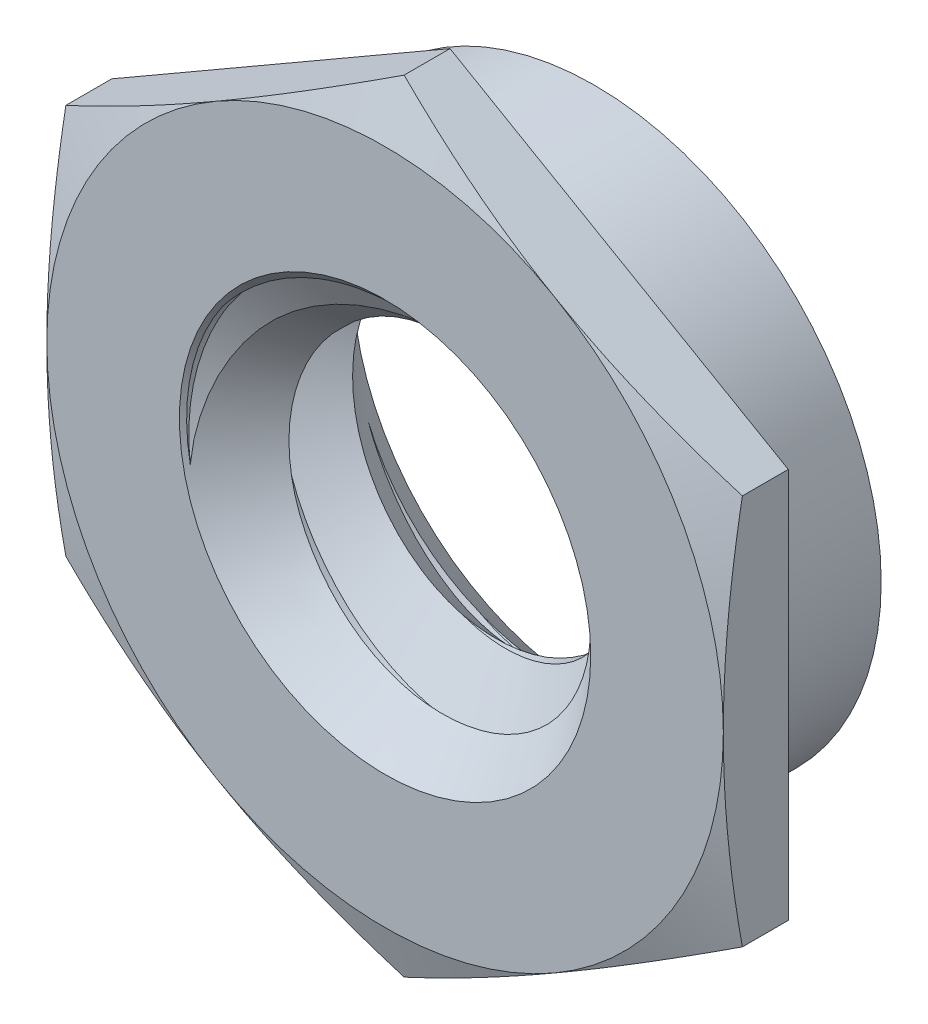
ISO-10303-21;
HEADER;
FILE_DESCRIPTION(('STEP AP214'),'2;1');
FILE_NAME('part.step','',(''),(''),'','','');
FILE_SCHEMA(('AUTOMOTIVE_DESIGN { 1 0 10303 214 1 1 1 1 }'));
ENDSEC;
DATA;
#1=APPLICATION_CONTEXT('core data for automotive mechanical design processes');
#2=APPLICATION_PROTOCOL_DEFINITION('international standard','automotive_design',2000,#1);
#3=PRODUCT_CONTEXT('',#1,'mechanical');
#4=PRODUCT('Part','Part','',(#3));
#5=PRODUCT_RELATED_PRODUCT_CATEGORY('part','',(#4));
#6=PRODUCT_DEFINITION_FORMATION('','',#4);
#7=PRODUCT_DEFINITION_CONTEXT('part definition',#1,'design');
#8=PRODUCT_DEFINITION('design','',#6,#7);
#9=PRODUCT_DEFINITION_SHAPE('','',#8);
#10=(LENGTH_UNIT() NAMED_UNIT(*) SI_UNIT(.MILLI.,.METRE.));
#11=(NAMED_UNIT(*) PLANE_ANGLE_UNIT() SI_UNIT($,.RADIAN.));
#12=(NAMED_UNIT(*) SI_UNIT($,.STERADIAN.) SOLID_ANGLE_UNIT());
#13=UNCERTAINTY_MEASURE_WITH_UNIT(LENGTH_MEASURE(1.E-05),#10,'distance_accuracy_value','');
#14=(GEOMETRIC_REPRESENTATION_CONTEXT(3) GLOBAL_UNCERTAINTY_ASSIGNED_CONTEXT((#13)) GLOBAL_UNIT_ASSIGNED_CONTEXT((#10,
#11,#12)) REPRESENTATION_CONTEXT('',''));
#15=CARTESIAN_POINT('',(0.,0.,0.));
#16=DIRECTION('',(0.,0.,1.));
#17=DIRECTION('',(1.,0.,0.));
#18=AXIS2_PLACEMENT_3D('',#15,#16,#17);
#19=CARTESIAN_POINT('',(2.38125000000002,1.37481532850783,-1.47319999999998));
#20=DIRECTION('',(0.5,0.866025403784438,0.));
#21=DIRECTION('',(-0.866025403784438,0.499999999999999,0.));
#22=AXIS2_PLACEMENT_3D('',#19,#20,#21);
#23=PLANE('',#22);
#24=DIRECTION('',(0.,0.,0.999999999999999));
#25=VECTOR('',#24,1.);
#26=CARTESIAN_POINT('',(0.,2.74963065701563,-1.47319999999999));
#27=LINE('',#26,#25);
#28=CARTESIAN_POINT('',(0.,2.74963065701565,-0.457199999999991));
#29=VERTEX_POINT('',#28);
#30=CARTESIAN_POINT('',(0.,2.74963065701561,-0.134079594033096));
#31=VERTEX_POINT('',#30);
#32=EDGE_CURVE('E167',#29,#31,#27,.T.);
#33=ORIENTED_EDGE('',*,*,#32,.T.);
#34=CARTESIAN_POINT('',(-0.000199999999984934,2.74974612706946,-0.134121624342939));
#35=CARTESIAN_POINT('',(0.0984292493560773,2.69280250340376,-0.113386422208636));
#36=CARTESIAN_POINT('',(0.197383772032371,2.63567108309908,-0.0945240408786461));
#37=CARTESIAN_POINT('',(0.395936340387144,2.52103670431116,-0.061338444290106));
#38=CARTESIAN_POINT('',(0.495534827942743,2.46353349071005,-0.0470187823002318));
#39=CARTESIAN_POINT('',(0.694269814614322,2.34879379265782,-0.0238570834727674));
#40=CARTESIAN_POINT('',(0.793401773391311,2.29155992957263,-0.0149645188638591));
#41=CARTESIAN_POINT('',(0.991897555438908,2.17695833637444,-0.00303707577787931));
#42=CARTESIAN_POINT('',(1.09126127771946,2.11959066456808,0.));
#43=CARTESIAN_POINT('',(1.28998872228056,2.00485532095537,0.));
#44=CARTESIAN_POINT('',(1.38935244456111,1.94748764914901,-0.00303707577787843));
#45=CARTESIAN_POINT('',(1.5878482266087,1.83288605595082,-0.014964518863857));
#46=CARTESIAN_POINT('',(1.68698018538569,1.77565219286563,-0.0238570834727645));
#47=CARTESIAN_POINT('',(1.88571517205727,1.6609124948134,-0.0470187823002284));
#48=CARTESIAN_POINT('',(1.98531365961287,1.6034092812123,-0.0613384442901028));
#49=CARTESIAN_POINT('',(2.18386622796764,1.48877490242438,-0.0945240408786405));
#50=CARTESIAN_POINT('',(2.28282075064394,1.43164348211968,-0.113386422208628));
#51=CARTESIAN_POINT('',(2.38144999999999,1.37469985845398,-0.134121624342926));
#52=B_SPLINE_CURVE_WITH_KNOTS('',3,(#34,#35,#36,#37,#38,#39,#40,#41,#42,#43,#44,#45,#46,#47,#48,
#49,#50,#51),.UNSPECIFIED.,.F.,.F.,(4,2,2,2,2,2,2,2,4),(0.,0.347314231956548,0.694899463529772,
1.03919714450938,1.38336560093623,1.72753405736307,2.07183173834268,2.4194169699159,
2.76673120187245),.UNSPECIFIED.);
#53=CARTESIAN_POINT('',(1.19062500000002,2.06222299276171,0.));
#54=VERTEX_POINT('',#53);
#55=EDGE_CURVE('E71',#31,#54,#52,.T.);
#56=ORIENTED_EDGE('',*,*,#55,.T.);
#57=CARTESIAN_POINT('',(2.38125000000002,1.37481532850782,-0.134079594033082));
#58=VERTEX_POINT('',#57);
#59=EDGE_CURVE('E145',#54,#58,#52,.T.);
#60=ORIENTED_EDGE('',*,*,#59,.T.);
#61=DIRECTION('',(0.,0.,0.999999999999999));
#62=VECTOR('',#61,1.);
#63=CARTESIAN_POINT('',(2.38125000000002,1.37481532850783,-1.47319999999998));
#64=LINE('',#63,#62);
#65=CARTESIAN_POINT('',(2.38125000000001,1.37481532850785,-0.457199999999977));
#66=VERTEX_POINT('',#65);
#67=EDGE_CURVE('E255',#66,#58,#64,.T.);
#68=ORIENTED_EDGE('',*,*,#67,.F.);
#69=DIRECTION('',(0.866025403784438,-0.499999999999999,0.));
#70=VECTOR('',#69,1.);
#71=CARTESIAN_POINT('',(2.38125000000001,1.37481532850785,-0.457199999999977));
#72=LINE('',#71,#70);
#73=EDGE_CURVE('E268',#29,#66,#72,.T.);
#74=ORIENTED_EDGE('',*,*,#73,.F.);
#75=EDGE_LOOP('',(#33,#56,#60,#68,#74));
#76=FACE_BOUND('',#75,.T.);
#77=ADVANCED_FACE('F43',(#76),#23,.T.);
#78=CARTESIAN_POINT('',(2.38125000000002,-1.37481532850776,-1.47319999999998));
#79=DIRECTION('',(0.999999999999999,0.,0.));
#80=DIRECTION('',(0.,0.,-0.999999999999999));
#81=AXIS2_PLACEMENT_3D('',#78,#79,#80);
#82=PLANE('',#81);
#83=ORIENTED_EDGE('',*,*,#67,.T.);
#84=CARTESIAN_POINT('',(2.38125,-3.67088979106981,-0.725880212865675));
#85=CARTESIAN_POINT('',(2.38125000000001,-3.56280650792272,-0.692885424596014));
#86=CARTESIAN_POINT('',(2.38125000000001,-3.45460567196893,-0.660269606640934));
#87=CARTESIAN_POINT('',(2.38125000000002,-3.23790885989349,-0.596003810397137));
#88=CARTESIAN_POINT('',(2.38125000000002,-3.12941286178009,-0.564353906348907));
#89=CARTESIAN_POINT('',(2.38125000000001,-2.91188788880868,-0.502177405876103));
#90=CARTESIAN_POINT('',(2.38125000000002,-2.80285830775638,-0.471652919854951));
#91=CARTESIAN_POINT('',(2.38125000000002,-2.58439809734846,-0.412083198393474));
#92=CARTESIAN_POINT('',(2.38125000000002,-2.47496747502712,-0.383037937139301));
#93=CARTESIAN_POINT('',(2.38125000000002,-2.14867163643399,-0.299326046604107));
#94=CARTESIAN_POINT('',(2.38125000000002,-1.93111676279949,-0.247298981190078));
#95=CARTESIAN_POINT('',(2.38125000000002,-1.49361131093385,-0.154348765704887));
#96=CARTESIAN_POINT('',(2.38125000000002,-1.27366166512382,-0.113421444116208));
#97=CARTESIAN_POINT('',(2.38125000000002,-0.954199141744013,-0.0664234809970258));
#98=CARTESIAN_POINT('',(2.38125000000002,-0.855678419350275,-0.0536212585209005));
#99=CARTESIAN_POINT('',(2.38125000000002,-0.658219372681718,-0.031849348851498));
#100=CARTESIAN_POINT('',(2.38125000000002,-0.559281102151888,-0.0228791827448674));
#101=CARTESIAN_POINT('',(2.38125000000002,-0.36117583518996,-0.00919885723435));
#102=CARTESIAN_POINT('',(2.38125000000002,-0.262009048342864,-0.00448570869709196));
#103=CARTESIAN_POINT('',(2.38125000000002,-0.0635625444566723,0.000440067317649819));
#104=CARTESIAN_POINT('',(2.38125000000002,0.0357171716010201,0.000652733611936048));
#105=CARTESIAN_POINT('',(2.38125000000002,0.234694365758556,-0.00344463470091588));
#106=CARTESIAN_POINT('',(2.38125000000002,0.334391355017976,-0.00777802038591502));
#107=CARTESIAN_POINT('',(2.38125000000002,0.533504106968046,-0.0207698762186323));
#108=CARTESIAN_POINT('',(2.38125000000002,0.632919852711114,-0.0294286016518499));
#109=CARTESIAN_POINT('',(2.38125000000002,0.831414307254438,-0.050658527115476));
#110=CARTESIAN_POINT('',(2.38125000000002,0.93049264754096,-0.0632331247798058));
#111=CARTESIAN_POINT('',(2.38125000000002,1.12815202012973,-0.0917793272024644));
#112=CARTESIAN_POINT('',(2.38125000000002,1.2267330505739,-0.107750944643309));
#113=CARTESIAN_POINT('',(2.38125000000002,1.5383853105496,-0.162894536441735));
#114=CARTESIAN_POINT('',(2.38125000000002,1.7505180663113,-0.207354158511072));
#115=CARTESIAN_POINT('',(2.38125000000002,2.17275463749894,-0.305068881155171));
#116=CARTESIAN_POINT('',(2.38125000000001,2.38285760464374,-0.358327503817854));
#117=CARTESIAN_POINT('',(2.38125000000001,2.80181784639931,-0.470631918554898));
#118=CARTESIAN_POINT('',(2.38125000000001,3.01067291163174,-0.529685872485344));
#119=CARTESIAN_POINT('',(2.38125000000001,3.42722448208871,-0.651576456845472));
#120=CARTESIAN_POINT('',(2.38125000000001,3.63492118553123,-0.714412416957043));
#121=CARTESIAN_POINT('',(2.38125000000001,4.04716477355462,-0.841951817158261));
#122=CARTESIAN_POINT('',(2.38125000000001,4.25172071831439,-0.906626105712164));
#123=CARTESIAN_POINT('',(2.38125000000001,4.66026492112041,-1.03777445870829));
#124=CARTESIAN_POINT('',(2.38125000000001,4.86425314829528,-1.10424861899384));
#125=CARTESIAN_POINT('',(2.38125000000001,5.27097098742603,-1.2382276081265));
#126=CARTESIAN_POINT('',(2.38125000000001,5.47370234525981,-1.30572715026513));
#127=CARTESIAN_POINT('',(2.38125000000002,5.87881632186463,-1.44170756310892));
#128=CARTESIAN_POINT('',(2.38125000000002,6.08119896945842,-1.51018834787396));
#129=CARTESIAN_POINT('',(2.38125000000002,6.28346401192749,-1.57900988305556));
#130=B_SPLINE_CURVE_WITH_KNOTS('',3,(#84,#85,#86,#87,#88,#89,#90,#91,#92,#93,#94,#95,#96,#97,
#98,#99,#100,#101,#102,#103,#104,#105,#106,#107,#108,#109,#110,#111,#112,#113,#114,#115,#116,
#117,#118,#119,#120,#121,#122,#123,#124,#125,#126,#127,#128,#129),.UNSPECIFIED.,.F.,.F.,(4,2,2,
2,2,2,2,2,2,2,2,2,2,2,2,2,2,2,2,2,2,2,4),(0.,0.339023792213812,0.678073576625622,
1.01772978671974,1.35738006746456,2.02829059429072,2.69894862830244,2.99693351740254,
3.29488115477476,3.59261942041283,3.89035511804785,4.18962767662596,4.48891790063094,
4.78846853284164,5.08802028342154,5.73790426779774,6.38804902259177,7.03912292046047,
7.69008176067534,8.33367971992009,8.97731201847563,9.61832852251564,10.2592892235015),.UNSPECIFIED.);
#131=CARTESIAN_POINT('',(2.38125000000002,0.,0.));
#132=VERTEX_POINT('',#131);
#133=EDGE_CURVE('E148',#58,#132,#130,.F.);
#134=ORIENTED_EDGE('',*,*,#133,.T.);
#135=CARTESIAN_POINT('',(2.38125000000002,-1.37481532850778,-0.134079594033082));
#136=VERTEX_POINT('',#135);
#137=EDGE_CURVE('E177',#132,#136,#130,.F.);
#138=ORIENTED_EDGE('',*,*,#137,.T.);
#139=DIRECTION('',(0.,0.,0.999999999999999));
#140=VECTOR('',#139,1.);
#141=CARTESIAN_POINT('',(2.38125000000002,-1.37481532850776,-1.47319999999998));
#142=LINE('',#141,#140);
#143=CARTESIAN_POINT('',(2.38125000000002,-1.37481532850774,-0.457199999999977));
#144=VERTEX_POINT('',#143);
#145=EDGE_CURVE('E260',#144,#136,#142,.T.);
#146=ORIENTED_EDGE('',*,*,#145,.F.);
#147=DIRECTION('',(0.,-0.999999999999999,0.));
#148=VECTOR('',#147,1.);
#149=CARTESIAN_POINT('',(2.38125000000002,-1.37481532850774,-0.457199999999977));
#150=LINE('',#149,#148);
#151=EDGE_CURVE('E258',#66,#144,#150,.T.);
#152=ORIENTED_EDGE('',*,*,#151,.F.);
#153=EDGE_LOOP('',(#83,#134,#138,#146,#152));
#154=FACE_BOUND('',#153,.T.);
#155=ADVANCED_FACE('F226',(#154),#82,.T.);
#156=CARTESIAN_POINT('',(0.,-2.74963065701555,-1.47319999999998));
#157=DIRECTION('',(0.5,-0.866025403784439,0.));
#158=DIRECTION('',(0.866025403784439,0.5,0.));
#159=AXIS2_PLACEMENT_3D('',#156,#157,#158);
#160=PLANE('',#159);
#161=ORIENTED_EDGE('',*,*,#145,.T.);
#162=CARTESIAN_POINT('',(2.38145000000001,-1.37469985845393,-0.134121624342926));
#163=CARTESIAN_POINT('',(2.28282075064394,-1.43164348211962,-0.113386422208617));
#164=CARTESIAN_POINT('',(2.18386622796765,-1.48877490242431,-0.0945240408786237));
#165=CARTESIAN_POINT('',(1.98531365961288,-1.60340928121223,-0.0613384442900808));
#166=CARTESIAN_POINT('',(1.88571517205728,-1.66091249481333,-0.0470187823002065));
#167=CARTESIAN_POINT('',(1.6869801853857,-1.77565219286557,-0.0238570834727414));
#168=CARTESIAN_POINT('',(1.58784822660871,-1.83288605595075,-0.0149645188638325));
#169=CARTESIAN_POINT('',(1.38935244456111,-1.94748764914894,-0.00303707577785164));
#170=CARTESIAN_POINT('',(1.28998872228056,-2.0048553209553,0.));
#171=CARTESIAN_POINT('',(1.09126127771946,-2.11959066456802,0.));
#172=CARTESIAN_POINT('',(0.991897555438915,-2.17695833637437,-0.00303707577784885));
#173=CARTESIAN_POINT('',(0.793401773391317,-2.29155992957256,-0.0149645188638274));
#174=CARTESIAN_POINT('',(0.694269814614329,-2.34879379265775,-0.0238570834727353));
#175=CARTESIAN_POINT('',(0.49553482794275,-2.46353349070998,-0.0470187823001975));
#176=CARTESIAN_POINT('',(0.395936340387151,-2.52103670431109,-0.0613384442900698));
#177=CARTESIAN_POINT('',(0.197383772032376,-2.63567108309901,-0.0945240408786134));
#178=CARTESIAN_POINT('',(0.0984292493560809,-2.69280250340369,-0.113386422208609));
#179=CARTESIAN_POINT('',(-0.000199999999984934,-2.74974612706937,-0.134121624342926));
#180=B_SPLINE_CURVE_WITH_KNOTS('',3,(#162,#163,#164,#165,#166,#167,#168,#169,#170,#171,#172,
#173,#174,#175,#176,#177,#178,#179),.UNSPECIFIED.,.F.,.F.,(4,2,2,2,2,2,2,2,4),(0.,
0.347314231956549,0.694899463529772,1.03919714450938,1.38336560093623,1.72753405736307,
2.07183173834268,2.4194169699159,2.76673120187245),.UNSPECIFIED.);
#181=CARTESIAN_POINT('',(1.19062500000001,-2.06222299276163,0.));
#182=VERTEX_POINT('',#181);
#183=EDGE_CURVE('E220',#136,#182,#180,.T.);
#184=ORIENTED_EDGE('',*,*,#183,.T.);
#185=CARTESIAN_POINT('',(0.,-2.74963065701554,-0.134079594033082));
#186=VERTEX_POINT('',#185);
#187=EDGE_CURVE('E214',#182,#186,#180,.T.);
#188=ORIENTED_EDGE('',*,*,#187,.T.);
#189=DIRECTION('',(0.,0.,0.999999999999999));
#190=VECTOR('',#189,1.);
#191=CARTESIAN_POINT('',(0.,-2.74963065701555,-1.47319999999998));
#192=LINE('',#191,#190);
#193=CARTESIAN_POINT('',(0.,-2.74963065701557,-0.457199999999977));
#194=VERTEX_POINT('',#193);
#195=EDGE_CURVE('E265',#194,#186,#192,.T.);
#196=ORIENTED_EDGE('',*,*,#195,.F.);
#197=DIRECTION('',(-0.866025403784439,-0.5,0.));
#198=VECTOR('',#197,1.);
#199=CARTESIAN_POINT('',(0.,-2.74963065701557,-0.457199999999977));
#200=LINE('',#199,#198);
#201=EDGE_CURVE('E349',#144,#194,#200,.T.);
#202=ORIENTED_EDGE('',*,*,#201,.F.);
#203=EDGE_LOOP('',(#161,#184,#188,#196,#202));
#204=FACE_BOUND('',#203,.T.);
#205=ADVANCED_FACE('F222',(#204),#160,.T.);
#206=CARTESIAN_POINT('',(-2.38124999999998,-1.37481532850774,-1.47320000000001));
#207=DIRECTION('',(-0.5,-0.866025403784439,0.));
#208=DIRECTION('',(0.866025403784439,-0.5,0.));
#209=AXIS2_PLACEMENT_3D('',#206,#207,#208);
#210=PLANE('',#209);
#211=ORIENTED_EDGE('',*,*,#195,.T.);
#212=CARTESIAN_POINT('',(0.000200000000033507,-2.74974612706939,-0.134121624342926));
#213=CARTESIAN_POINT('',(-0.0984292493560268,-2.69280250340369,-0.113386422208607));
#214=CARTESIAN_POINT('',(-0.19738377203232,-2.635671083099,-0.0945240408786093));
#215=CARTESIAN_POINT('',(-0.395936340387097,-2.52103670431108,-0.061338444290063));
#216=CARTESIAN_POINT('',(-0.495534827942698,-2.46353349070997,-0.0470187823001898));
#217=CARTESIAN_POINT('',(-0.694269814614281,-2.34879379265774,-0.0238570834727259));
#218=CARTESIAN_POINT('',(-0.79340177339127,-2.29155992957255,-0.0149645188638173));
#219=CARTESIAN_POINT('',(-0.99189755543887,-2.17695833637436,-0.00303707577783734));
#220=CARTESIAN_POINT('',(-1.09126127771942,-2.119590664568,0.));
#221=CARTESIAN_POINT('',(-1.28998872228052,-2.00485532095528,0.));
#222=CARTESIAN_POINT('',(-1.38935244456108,-1.94748764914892,-0.00303707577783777));
#223=CARTESIAN_POINT('',(-1.58784822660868,-1.83288605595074,-0.0149645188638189));
#224=CARTESIAN_POINT('',(-1.68698018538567,-1.77565219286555,-0.0238570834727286));
#225=CARTESIAN_POINT('',(-1.88571517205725,-1.66091249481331,-0.0470187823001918));
#226=CARTESIAN_POINT('',(-1.98531365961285,-1.6034092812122,-0.0613384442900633));
#227=CARTESIAN_POINT('',(-2.18386622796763,-1.48877490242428,-0.094524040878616));
#228=CARTESIAN_POINT('',(-2.28282075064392,-1.43164348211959,-0.113386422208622));
#229=CARTESIAN_POINT('',(-2.38144999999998,-1.3746998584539,-0.13412162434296));
#230=B_SPLINE_CURVE_WITH_KNOTS('',3,(#212,#213,#214,#215,#216,#217,#218,#219,#220,#221,#222,
#223,#224,#225,#226,#227,#228,#229),.UNSPECIFIED.,.F.,.F.,(4,2,2,2,2,2,2,2,4),(0.,
0.347314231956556,0.694899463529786,1.0391971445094,1.38336560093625,1.7275340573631,
2.07183173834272,2.41941696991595,2.76673120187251),.UNSPECIFIED.);
#231=CARTESIAN_POINT('',(-1.19062499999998,-2.06222299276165,0.));
#232=VERTEX_POINT('',#231);
#233=EDGE_CURVE('E221',#186,#232,#230,.T.);
#234=ORIENTED_EDGE('',*,*,#233,.T.);
#235=CARTESIAN_POINT('',(-2.38124999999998,-1.37481532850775,-0.13407959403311));
#236=VERTEX_POINT('',#235);
#237=EDGE_CURVE('E209',#232,#236,#230,.T.);
#238=ORIENTED_EDGE('',*,*,#237,.T.);
#239=DIRECTION('',(0.,0.,0.999999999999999));
#240=VECTOR('',#239,1.);
#241=CARTESIAN_POINT('',(-2.38124999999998,-1.37481532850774,-1.47320000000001));
#242=LINE('',#241,#240);
#243=CARTESIAN_POINT('',(-2.38124999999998,-1.37481532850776,-0.457200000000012));
#244=VERTEX_POINT('',#243);
#245=EDGE_CURVE('E273',#244,#236,#242,.T.);
#246=ORIENTED_EDGE('',*,*,#245,.F.);
#247=DIRECTION('',(-0.866025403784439,0.5,0.));
#248=VECTOR('',#247,1.);
#249=CARTESIAN_POINT('',(-2.38124999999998,-1.37481532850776,-0.457200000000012));
#250=LINE('',#249,#248);
#251=EDGE_CURVE('E347',#194,#244,#250,.T.);
#252=ORIENTED_EDGE('',*,*,#251,.F.);
#253=EDGE_LOOP('',(#211,#234,#238,#246,#252));
#254=FACE_BOUND('',#253,.T.);
#255=ADVANCED_FACE('F225',(#254),#210,.T.);
#256=CARTESIAN_POINT('',(-2.38124999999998,1.37481532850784,-1.47320000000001));
#257=DIRECTION('',(-0.999999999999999,0.,0.));
#258=DIRECTION('',(0.,-0.999999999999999,0.));
#259=AXIS2_PLACEMENT_3D('',#256,#257,#258);
#260=PLANE('',#259);
#261=ORIENTED_EDGE('',*,*,#245,.T.);
#262=CARTESIAN_POINT('',(-2.38124999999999,-3.67088979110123,-0.725880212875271));
#263=CARTESIAN_POINT('',(-2.38124999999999,-3.56280650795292,-0.692885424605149));
#264=CARTESIAN_POINT('',(-2.38124999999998,-3.45460567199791,-0.660269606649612));
#265=CARTESIAN_POINT('',(-2.38124999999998,-3.23790885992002,-0.596003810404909));
#266=CARTESIAN_POINT('',(-2.38124999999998,-3.1294128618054,-0.56435390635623));
#267=CARTESIAN_POINT('',(-2.38124999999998,-2.91188788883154,-0.502177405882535));
#268=CARTESIAN_POINT('',(-2.38124999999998,-2.80285830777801,-0.471652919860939));
#269=CARTESIAN_POINT('',(-2.38124999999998,-2.58439809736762,-0.41208319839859));
#270=CARTESIAN_POINT('',(-2.38124999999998,-2.47496747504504,-0.38303793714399));
#271=CARTESIAN_POINT('',(-2.38124999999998,-2.14867163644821,-0.299326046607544));
#272=CARTESIAN_POINT('',(-2.38124999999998,-1.93111676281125,-0.24729898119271));
#273=CARTESIAN_POINT('',(-2.38124999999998,-1.49361131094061,-0.15434876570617));
#274=CARTESIAN_POINT('',(-2.38124999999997,-1.27366166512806,-0.113421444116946));
#275=CARTESIAN_POINT('',(-2.38124999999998,-0.954199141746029,-0.0664234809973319));
#276=CARTESIAN_POINT('',(-2.38124999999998,-0.855678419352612,-0.0536212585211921));
#277=CARTESIAN_POINT('',(-2.38124999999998,-0.658219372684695,-0.0318493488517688));
#278=CARTESIAN_POINT('',(-2.38124999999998,-0.559281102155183,-0.0228791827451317));
#279=CARTESIAN_POINT('',(-2.38124999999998,-0.361175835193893,-0.00919885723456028));
#280=CARTESIAN_POINT('',(-2.38124999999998,-0.262009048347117,-0.00448570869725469));
#281=CARTESIAN_POINT('',(-2.38124999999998,-0.0635625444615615,0.000440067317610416));
#282=CARTESIAN_POINT('',(-2.38124999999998,0.0357171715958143,0.000652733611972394));
#283=CARTESIAN_POINT('',(-2.38124999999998,0.234694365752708,-0.00344463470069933));
#284=CARTESIAN_POINT('',(-2.38124999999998,0.334391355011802,-0.00777802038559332));
#285=CARTESIAN_POINT('',(-2.38124999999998,0.533504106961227,-0.0207698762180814));
#286=CARTESIAN_POINT('',(-2.38124999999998,0.632919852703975,-0.029428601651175));
#287=CARTESIAN_POINT('',(-2.38124999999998,0.831414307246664,-0.0506585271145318));
#288=CARTESIAN_POINT('',(-2.38124999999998,0.930492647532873,-0.0632331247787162));
#289=CARTESIAN_POINT('',(-2.38124999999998,1.12815202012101,-0.0917793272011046));
#290=CARTESIAN_POINT('',(-2.38124999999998,1.22673305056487,-0.107750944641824));
#291=CARTESIAN_POINT('',(-2.38124999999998,1.53838531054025,-0.162894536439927));
#292=CARTESIAN_POINT('',(-2.38124999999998,1.75051806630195,-0.207354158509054));
#293=CARTESIAN_POINT('',(-2.38124999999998,2.17275463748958,-0.30506888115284));
#294=CARTESIAN_POINT('',(-2.38124999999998,2.38285760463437,-0.358327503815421));
#295=CARTESIAN_POINT('',(-2.38124999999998,2.80181784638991,-0.470631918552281));
#296=CARTESIAN_POINT('',(-2.38124999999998,3.01067291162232,-0.529685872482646));
#297=CARTESIAN_POINT('',(-2.38124999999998,3.42722448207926,-0.651576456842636));
#298=CARTESIAN_POINT('',(-2.38124999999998,3.63492118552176,-0.71441241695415));
#299=CARTESIAN_POINT('',(-2.38124999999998,4.04716477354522,-0.841951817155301));
#300=CARTESIAN_POINT('',(-2.38124999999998,4.25172071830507,-0.906626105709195));
#301=CARTESIAN_POINT('',(-2.38124999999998,4.66026492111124,-1.03777445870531));
#302=CARTESIAN_POINT('',(-2.38124999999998,4.86425314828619,-1.10424861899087));
#303=CARTESIAN_POINT('',(-2.38124999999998,5.27097098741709,-1.23822760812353));
#304=CARTESIAN_POINT('',(-2.38124999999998,5.47370234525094,-1.30572715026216));
#305=CARTESIAN_POINT('',(-2.38124999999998,5.87881632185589,-1.44170756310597));
#306=CARTESIAN_POINT('',(-2.38124999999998,6.08119896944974,-1.51018834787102));
#307=CARTESIAN_POINT('',(-2.38124999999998,6.28346401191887,-1.57900988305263));
#308=B_SPLINE_CURVE_WITH_KNOTS('',3,(#262,#263,#264,#265,#266,#267,#268,#269,#270,#271,#272,
#273,#274,#275,#276,#277,#278,#279,#280,#281,#282,#283,#284,#285,#286,#287,#288,#289,#290,#291,
#292,#293,#294,#295,#296,#297,#298,#299,#300,#301,#302,#303,#304,#305,#306,#307),.UNSPECIFIED.,
.F.,.F.,(4,2,2,2,2,2,2,2,2,2,2,2,2,2,2,2,2,2,2,2,2,2,4),(0.,0.339023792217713,0.678073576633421,
1.01772978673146,1.3573800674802,2.02829059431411,2.69894862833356,2.99693351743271,
3.29488115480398,3.59261942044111,3.89035511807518,4.1896276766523,4.48891790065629,
4.788468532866,5.08802028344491,5.73790426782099,6.3880490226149,7.03912292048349,
7.69008176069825,8.33367971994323,8.977312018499,9.6183285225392,10.2592892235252),.UNSPECIFIED.);
#309=CARTESIAN_POINT('',(-2.38124999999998,0.,0.));
#310=VERTEX_POINT('',#309);
#311=EDGE_CURVE('E356',#236,#310,#308,.T.);
#312=ORIENTED_EDGE('',*,*,#311,.T.);
#313=CARTESIAN_POINT('',(-2.38125,1.37481532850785,-0.134079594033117));
#314=VERTEX_POINT('',#313);
#315=EDGE_CURVE('E203',#310,#314,#308,.T.);
#316=ORIENTED_EDGE('',*,*,#315,.T.);
#317=DIRECTION('',(0.,0.,0.999999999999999));
#318=VECTOR('',#317,1.);
#319=CARTESIAN_POINT('',(-2.38124999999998,1.37481532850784,-1.47320000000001));
#320=LINE('',#319,#318);
#321=CARTESIAN_POINT('',(-2.38125000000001,1.37481532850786,-0.457200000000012));
#322=VERTEX_POINT('',#321);
#323=EDGE_CURVE('E276',#322,#314,#320,.T.);
#324=ORIENTED_EDGE('',*,*,#323,.F.);
#325=DIRECTION('',(0.,0.999999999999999,0.));
#326=VECTOR('',#325,1.);
#327=CARTESIAN_POINT('',(-2.38125000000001,1.37481532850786,-0.457200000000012));
#328=LINE('',#327,#326);
#329=EDGE_CURVE('E336',#244,#322,#328,.T.);
#330=ORIENTED_EDGE('',*,*,#329,.F.);
#331=EDGE_LOOP('',(#261,#312,#316,#324,#330));
#332=FACE_BOUND('',#331,.T.);
#333=ADVANCED_FACE('F232',(#332),#260,.T.);
#334=CARTESIAN_POINT('',(0.,2.74963065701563,-1.47319999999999));
#335=DIRECTION('',(-0.499999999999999,0.866025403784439,0.));
#336=DIRECTION('',(-0.866025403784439,-0.499999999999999,0.));
#337=AXIS2_PLACEMENT_3D('',#334,#335,#336);
#338=PLANE('',#337);
#339=ORIENTED_EDGE('',*,*,#323,.T.);
#340=CARTESIAN_POINT('',(-2.38144999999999,1.37469985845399,-0.13412162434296));
#341=CARTESIAN_POINT('',(-2.28282075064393,1.43164348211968,-0.113386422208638));
#342=CARTESIAN_POINT('',(-2.18386622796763,1.48877490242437,-0.0945240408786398));
#343=CARTESIAN_POINT('',(-1.98531365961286,1.60340928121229,-0.0613384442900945));
#344=CARTESIAN_POINT('',(-1.88571517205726,1.6609124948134,-0.0470187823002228));
#345=CARTESIAN_POINT('',(-1.68698018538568,1.77565219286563,-0.0238570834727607));
#346=CARTESIAN_POINT('',(-1.58784822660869,1.83288605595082,-0.0149645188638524));
#347=CARTESIAN_POINT('',(-1.38935244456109,1.947487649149,-0.00303707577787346));
#348=CARTESIAN_POINT('',(-1.28998872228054,2.00485532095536,0.));
#349=CARTESIAN_POINT('',(-1.09126127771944,2.11959066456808,0.));
#350=CARTESIAN_POINT('',(-0.991897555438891,2.17695833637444,-0.00303707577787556));
#351=CARTESIAN_POINT('',(-0.793401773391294,2.29155992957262,-0.0149645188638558));
#352=CARTESIAN_POINT('',(-0.694269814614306,2.34879379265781,-0.0238570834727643));
#353=CARTESIAN_POINT('',(-0.495534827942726,2.46353349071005,-0.0470187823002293));
#354=CARTESIAN_POINT('',(-0.395936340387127,2.52103670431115,-0.0613384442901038));
#355=CARTESIAN_POINT('',(-0.197383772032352,2.63567108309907,-0.0945240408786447));
#356=CARTESIAN_POINT('',(-0.0984292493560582,2.69280250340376,-0.113386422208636));
#357=CARTESIAN_POINT('',(0.000200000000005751,2.74974612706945,-0.134121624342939));
#358=B_SPLINE_CURVE_WITH_KNOTS('',3,(#340,#341,#342,#343,#344,#345,#346,#347,#348,#349,#350,
#351,#352,#353,#354,#355,#356,#357),.UNSPECIFIED.,.F.,.F.,(4,2,2,2,2,2,2,2,4),(0.,
0.347314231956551,0.694899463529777,1.03919714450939,1.38336560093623,1.72753405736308,
2.07183173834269,2.41941696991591,2.76673120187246),.UNSPECIFIED.);
#359=CARTESIAN_POINT('',(-1.19062499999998,2.06222299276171,0.));
#360=VERTEX_POINT('',#359);
#361=EDGE_CURVE('E354',#314,#360,#358,.T.);
#362=ORIENTED_EDGE('',*,*,#361,.T.);
#363=EDGE_CURVE('E154',#360,#31,#358,.T.);
#364=ORIENTED_EDGE('',*,*,#363,.T.);
#365=ORIENTED_EDGE('',*,*,#32,.F.);
#366=DIRECTION('',(0.866025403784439,0.499999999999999,0.));
#367=VECTOR('',#366,1.);
#368=CARTESIAN_POINT('',(0.,2.74963065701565,-0.457199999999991));
#369=LINE('',#368,#367);
#370=EDGE_CURVE('E259',#322,#29,#369,.T.);
#371=ORIENTED_EDGE('',*,*,#370,.F.);
#372=EDGE_LOOP('',(#339,#362,#364,#365,#371));
#373=FACE_BOUND('',#372,.T.);
#374=ADVANCED_FACE('F236',(#373),#338,.T.);
#375=CARTESIAN_POINT('',(-2.38124999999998,4.12444598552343,0.));
#376=DIRECTION('',(0.,0.,0.999999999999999));
#377=DIRECTION('',(0.999999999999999,0.,0.));
#378=AXIS2_PLACEMENT_3D('',#375,#376,#377);
#379=PLANE('',#378);
#380=CARTESIAN_POINT('',(0.,0.,0.));
#381=DIRECTION('',(0.,0.,0.999999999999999));
#382=DIRECTION('',(0.999999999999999,0.,0.));
#383=AXIS2_PLACEMENT_3D('',#380,#381,#382);
#384=CIRCLE('',#383,1.4478);
#385=CARTESIAN_POINT('',(1.4478,0.,0.));
#386=VERTEX_POINT('',#385);
#387=EDGE_CURVE('E412',#386,#386,#384,.T.);
#388=ORIENTED_EDGE('',*,*,#387,.F.);
#389=EDGE_LOOP('',(#388));
#390=FACE_BOUND('',#389,.T.);
#391=CARTESIAN_POINT('',(0.,0.,0.));
#392=DIRECTION('',(0.,0.,0.999999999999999));
#393=DIRECTION('',(0.999999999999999,0.,0.));
#394=AXIS2_PLACEMENT_3D('',#391,#392,#393);
#395=CIRCLE('',#394,2.38125);
#396=EDGE_CURVE('E56',#182,#132,#395,.T.);
#397=ORIENTED_EDGE('',*,*,#396,.T.);
#398=CARTESIAN_POINT('',(0.,0.,0.));
#399=DIRECTION('',(0.,0.,0.999999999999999));
#400=DIRECTION('',(0.999999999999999,0.,0.));
#401=AXIS2_PLACEMENT_3D('',#398,#399,#400);
#402=CIRCLE('',#401,2.38125);
#403=EDGE_CURVE('E63',#132,#54,#402,.T.);
#404=ORIENTED_EDGE('',*,*,#403,.T.);
#405=EDGE_CURVE('E13',#54,#360,#395,.T.);
#406=ORIENTED_EDGE('',*,*,#405,.T.);
#407=EDGE_CURVE('E54',#360,#310,#395,.T.);
#408=ORIENTED_EDGE('',*,*,#407,.T.);
#409=EDGE_CURVE('E372',#310,#232,#395,.T.);
#410=ORIENTED_EDGE('',*,*,#409,.T.);
#411=EDGE_CURVE('E366',#232,#182,#395,.T.);
#412=ORIENTED_EDGE('',*,*,#411,.T.);
#413=EDGE_LOOP('',(#397,#404,#406,#408,#410,#412));
#414=FACE_BOUND('',#413,.T.);
#415=ADVANCED_FACE('F160',(#390,#414),#379,.T.);
#416=CARTESIAN_POINT('',(0.,1.42240000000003,-1.4732));
#417=CARTESIAN_POINT('',(-0.821223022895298,1.42240000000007,-1.42028333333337));
#418=CARTESIAN_POINT('',(-1.23183453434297,0.711200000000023,-1.36736666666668));
#419=CARTESIAN_POINT('',(-1.64244604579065,0.,-1.31445000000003));
#420=CARTESIAN_POINT('',(-1.23183453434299,-0.711199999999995,-1.26153333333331));
#421=CARTESIAN_POINT('',(-0.821223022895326,-1.42239999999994,-1.20861666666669));
#422=CARTESIAN_POINT('',(0.,-1.42239999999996,-1.1557));
#423=CARTESIAN_POINT('',(0.821223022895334,-1.42239999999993,-1.10278333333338));
#424=CARTESIAN_POINT('',(1.23183453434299,-0.711199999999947,-1.04986666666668));
#425=CARTESIAN_POINT('',(1.64244604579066,0.,-0.996950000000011));
#426=CARTESIAN_POINT('',(1.231834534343,0.711200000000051,-0.944033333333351));
#427=CARTESIAN_POINT('',(0.82122302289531,1.42240000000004,-0.891116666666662));
#428=CARTESIAN_POINT('',(0.,1.42240000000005,-0.838200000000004));
#429=CARTESIAN_POINT('',(-0.821223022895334,1.42240000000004,-0.785283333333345));
#430=CARTESIAN_POINT('',(-1.23183453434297,0.711200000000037,-0.732366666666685));
#431=CARTESIAN_POINT('',(-1.64244604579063,0.,-0.67945000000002));
#432=CARTESIAN_POINT('',(-1.23183453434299,-0.711199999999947,-0.626533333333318));
#433=CARTESIAN_POINT('',(-0.821223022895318,-1.42239999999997,-0.573616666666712));
#434=CARTESIAN_POINT('',(0.,-1.42239999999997,-0.520699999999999));
#435=CARTESIAN_POINT('',(0.821223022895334,-1.42239999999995,-0.467783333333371));
#436=CARTESIAN_POINT('',(1.231834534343,-0.711199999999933,-0.41486666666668));
#437=CARTESIAN_POINT('',(1.64244604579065,0.,-0.361950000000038));
#438=CARTESIAN_POINT('',(1.23183453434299,0.711200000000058,-0.309033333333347));
#439=CARTESIAN_POINT('',(0.821223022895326,1.42240000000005,-0.256116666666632));
#440=CARTESIAN_POINT('',(0.,1.42240000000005,-0.203200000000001));
#441=CARTESIAN_POINT('',(-0.821223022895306,1.42240000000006,-0.150283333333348));
#442=CARTESIAN_POINT('',(-1.23183453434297,0.711200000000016,-0.0973666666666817));
#443=CARTESIAN_POINT('',(-1.64244604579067,0.,-0.0444500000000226));
#444=CARTESIAN_POINT('',(-1.23183453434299,-0.711199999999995,0.00846666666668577));
#445=CARTESIAN_POINT('',(-0.821223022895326,-1.42239999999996,0.0613833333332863));
#446=CARTESIAN_POINT('',(0.,-1.42239999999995,0.114299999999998));
#447=CARTESIAN_POINT('',(0.82122302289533,-1.42239999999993,0.167216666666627));
#448=CARTESIAN_POINT('',(1.23183453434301,-0.711199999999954,0.220133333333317));
#449=CARTESIAN_POINT('',(1.64244604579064,0.,0.27304999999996));
#450=CARTESIAN_POINT('',(1.23183453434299,0.71120000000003,0.325966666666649));
#451=CARTESIAN_POINT('',(0.82122302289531,1.42240000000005,0.378883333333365));
#452=CARTESIAN_POINT('',(0.,1.42240000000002,0.431799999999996));
#453=CARTESIAN_POINT('',(-0.821223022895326,1.42240000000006,0.48471666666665));
#454=CARTESIAN_POINT('',(-1.23183453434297,0.711200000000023,0.537633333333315));
#455=CARTESIAN_POINT('',(-1.64244604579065,0.,0.590549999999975));
#456=CARTESIAN_POINT('',(-1.23183453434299,-0.711199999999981,0.643466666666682));
#457=CARTESIAN_POINT('',(-0.82122302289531,-1.42239999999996,0.696383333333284));
#458=CARTESIAN_POINT('',(0.,-1.42239999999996,0.749299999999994));
#459=CARTESIAN_POINT('',(0.821223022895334,-1.42239999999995,0.802216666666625));
#460=CARTESIAN_POINT('',(1.23183453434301,-0.711199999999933,0.855133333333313));
#461=CARTESIAN_POINT('',(1.64244604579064,0.,0.908049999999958));
#462=CARTESIAN_POINT('',(1.23183453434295,0.711200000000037,0.960966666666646));
#463=CARTESIAN_POINT('',(0.821223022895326,1.42240000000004,1.01388333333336));
#464=CARTESIAN_POINT('',(0.,1.42240000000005,1.06679999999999));
#465=CARTESIAN_POINT('',(-0.82122302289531,1.42240000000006,1.11971666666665));
#466=CARTESIAN_POINT('',(-1.23183453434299,0.711200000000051,1.17263333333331));
#467=CARTESIAN_POINT('',(-1.64244604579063,0.,1.22554999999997));
#468=CARTESIAN_POINT('',(-1.23183453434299,-0.711199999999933,1.27846666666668));
#469=CARTESIAN_POINT('',(-0.821223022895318,-1.42239999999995,1.33138333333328));
#470=CARTESIAN_POINT('',(0.,-1.42239999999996,1.38429999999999));
#471=CARTESIAN_POINT('',(0.821223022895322,-1.42239999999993,1.43721666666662));
#472=CARTESIAN_POINT('',(1.23183453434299,-0.711199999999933,1.49013333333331));
#473=CARTESIAN_POINT('',(1.64244604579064,0.,1.54304999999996));
#474=CARTESIAN_POINT('',(1.231834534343,0.711200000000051,1.59596666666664));
#475=CARTESIAN_POINT('',(0.821223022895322,1.42240000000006,1.64888333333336));
#476=CARTESIAN_POINT('',(0.,1.42240000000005,1.70179999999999));
#477=CARTESIAN_POINT('',(-0.82122302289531,1.42240000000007,1.75471666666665));
#478=CARTESIAN_POINT('',(-1.23183453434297,0.711200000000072,1.80763333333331));
#479=CARTESIAN_POINT('',(-1.64244604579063,0.,1.86054999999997));
#480=CARTESIAN_POINT('',(-1.23183453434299,-0.711199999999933,1.91346666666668));
#481=CARTESIAN_POINT('',(-0.821223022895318,-1.42239999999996,1.96638333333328));
#482=CARTESIAN_POINT('',(0.,-1.42239999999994,2.01929999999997));
#483=CARTESIAN_POINT('',(0.821223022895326,-1.42239999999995,2.07221666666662));
#484=CARTESIAN_POINT('',(1.23183453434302,-0.711199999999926,2.12513333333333));
#485=CARTESIAN_POINT('',(1.64244604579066,0.,2.17804999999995));
#486=CARTESIAN_POINT('',(1.231834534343,0.711200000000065,2.23096666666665));
#487=CARTESIAN_POINT('',(0.821223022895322,1.42240000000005,2.28388333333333));
#488=CARTESIAN_POINT('',(0.,1.42240000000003,2.33679999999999));
#489=CARTESIAN_POINT('',(-0.82122302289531,1.42240000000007,2.38971666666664));
#490=CARTESIAN_POINT('',(-1.23183453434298,0.711200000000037,2.4426333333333));
#491=CARTESIAN_POINT('',(-1.64244604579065,0.,2.49554999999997));
#492=CARTESIAN_POINT('',(-1.23183453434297,-0.711199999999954,2.54846666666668));
#493=CARTESIAN_POINT('',(-0.821223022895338,-1.42239999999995,2.60138333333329));
#494=CARTESIAN_POINT('',(0.,-1.42239999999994,2.65429999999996));
#495=CARTESIAN_POINT('',(0.821223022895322,-1.42239999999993,2.70721666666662));
#496=CARTESIAN_POINT('',(1.231834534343,-0.711199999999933,2.76013333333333));
#497=CARTESIAN_POINT('',(1.64244604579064,0.,2.81304999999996));
#498=CARTESIAN_POINT('',(1.23183453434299,0.711200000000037,2.86596666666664));
#499=CARTESIAN_POINT('',(0.821223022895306,1.42240000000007,2.91888333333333));
#500=CARTESIAN_POINT('',(0.,1.42240000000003,2.97179999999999));
#501=CARTESIAN_POINT('',(-0.82122302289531,1.42240000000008,3.02471666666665));
#502=CARTESIAN_POINT('',(-1.23183453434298,0.711200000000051,3.07763333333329));
#503=CARTESIAN_POINT('',(-1.64244604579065,0.,3.13054999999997));
#504=CARTESIAN_POINT('',(-1.23183453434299,-0.711199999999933,3.18346666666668));
#505=CARTESIAN_POINT('',(-0.821223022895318,-1.42239999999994,3.2363833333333));
#506=CARTESIAN_POINT('',(0.,-1.42239999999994,3.28929999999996));
#507=CARTESIAN_POINT('',(0.821223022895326,-1.42239999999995,3.34221666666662));
#508=CARTESIAN_POINT('',(1.231834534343,-0.711199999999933,3.39513333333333));
#509=CARTESIAN_POINT('',(1.64244604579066,0.,3.44804999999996));
#510=CARTESIAN_POINT('',(1.231834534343,0.711200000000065,3.50096666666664));
#511=CARTESIAN_POINT('',(0.821223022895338,1.42240000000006,3.55388333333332));
#512=CARTESIAN_POINT('',(0.,1.42240000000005,3.60679999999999));
#513=CARTESIAN_POINT('',(0.,1.00995540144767,-1.71132499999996));
#514=CARTESIAN_POINT('',(-0.583098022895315,1.00995540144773,-1.65840833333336));
#515=CARTESIAN_POINT('',(-0.874647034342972,0.504977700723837,-1.60549166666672));
#516=CARTESIAN_POINT('',(-1.16619604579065,0.,-1.55257500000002));
#517=CARTESIAN_POINT('',(-0.874647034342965,-0.504977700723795,-1.49965833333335));
#518=CARTESIAN_POINT('',(-0.583098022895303,-1.00995540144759,-1.44674166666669));
#519=CARTESIAN_POINT('',(0.,-1.00995540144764,-1.393825));
#520=CARTESIAN_POINT('',(0.583098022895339,-1.0099554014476,-1.34090833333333));
#521=CARTESIAN_POINT('',(0.874647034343,-0.504977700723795,-1.28799166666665));
#522=CARTESIAN_POINT('',(1.16619604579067,0.,-1.23507500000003));
#523=CARTESIAN_POINT('',(0.874647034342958,0.504977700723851,-1.18215833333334));
#524=CARTESIAN_POINT('',(0.583098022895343,1.00995540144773,-1.12924166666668));
#525=CARTESIAN_POINT('',(0.,1.00995540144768,-1.07632499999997));
#526=CARTESIAN_POINT('',(-0.583098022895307,1.00995540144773,-1.02340833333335));
#527=CARTESIAN_POINT('',(-0.874647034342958,0.504977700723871,-0.970491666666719));
#528=CARTESIAN_POINT('',(-1.16619604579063,0.,-0.917575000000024));
#529=CARTESIAN_POINT('',(-0.874647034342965,-0.504977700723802,-0.864658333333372));
#530=CARTESIAN_POINT('',(-0.583098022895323,-1.00995540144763,-0.811741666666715));
#531=CARTESIAN_POINT('',(0.,-1.00995540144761,-0.758825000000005));
#532=CARTESIAN_POINT('',(0.583098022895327,-1.00995540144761,-0.705908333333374));
#533=CARTESIAN_POINT('',(0.874647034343,-0.504977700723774,-0.652991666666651));
#534=CARTESIAN_POINT('',(1.16619604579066,0.,-0.600075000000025));
#535=CARTESIAN_POINT('',(0.874647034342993,0.504977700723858,-0.547158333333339));
#536=CARTESIAN_POINT('',(0.583098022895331,1.00995540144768,-0.494241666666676));
#537=CARTESIAN_POINT('',(0.,1.00995540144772,-0.441324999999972));
#538=CARTESIAN_POINT('',(-0.583098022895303,1.00995540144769,-0.388408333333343));
#539=CARTESIAN_POINT('',(-0.874647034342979,0.504977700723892,-0.335491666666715));
#540=CARTESIAN_POINT('',(-1.16619604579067,0.,-0.282575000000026));
#541=CARTESIAN_POINT('',(-0.874647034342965,-0.504977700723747,-0.229658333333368));
#542=CARTESIAN_POINT('',(-0.583098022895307,-1.00995540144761,-0.176741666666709));
#543=CARTESIAN_POINT('',(0.,-1.00995540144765,-0.123825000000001));
#544=CARTESIAN_POINT('',(0.583098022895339,-1.00995540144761,-0.0709083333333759));
#545=CARTESIAN_POINT('',(0.874647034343,-0.504977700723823,-0.0179916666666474));
#546=CARTESIAN_POINT('',(1.16619604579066,0.,0.0349250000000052));
#547=CARTESIAN_POINT('',(0.874647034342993,0.50497770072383,0.0878416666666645));
#548=CARTESIAN_POINT('',(0.583098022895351,1.00995540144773,0.140758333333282));
#549=CARTESIAN_POINT('',(0.,1.00995540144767,0.193675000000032));
#550=CARTESIAN_POINT('',(-0.583098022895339,1.00995540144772,0.246591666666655));
#551=CARTESIAN_POINT('',(-0.874647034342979,0.504977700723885,0.299508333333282));
#552=CARTESIAN_POINT('',(-1.16619604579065,0.,0.352424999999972));
#553=CARTESIAN_POINT('',(-0.874647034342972,-0.504977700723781,0.405341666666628));
#554=CARTESIAN_POINT('',(-0.583098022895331,-1.0099554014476,0.458258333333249));
#555=CARTESIAN_POINT('',(0.,-1.00995540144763,0.511174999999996));
#556=CARTESIAN_POINT('',(0.583098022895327,-1.00995540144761,0.564091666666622));
#557=CARTESIAN_POINT('',(0.874647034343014,-0.504977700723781,0.617008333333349));
#558=CARTESIAN_POINT('',(1.16619604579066,0.,0.669924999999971));
#559=CARTESIAN_POINT('',(0.874647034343,0.504977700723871,0.722841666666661));
#560=CARTESIAN_POINT('',(0.583098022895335,1.00995540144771,0.77575833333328));
#561=CARTESIAN_POINT('',(0.,1.0099554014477,0.828675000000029));
#562=CARTESIAN_POINT('',(-0.583098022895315,1.00995540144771,0.881591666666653));
#563=CARTESIAN_POINT('',(-0.874647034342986,0.504977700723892,0.934508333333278));
#564=CARTESIAN_POINT('',(-1.16619604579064,0.,0.987424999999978));
#565=CARTESIAN_POINT('',(-0.874647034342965,-0.504977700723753,1.04034166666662));
#566=CARTESIAN_POINT('',(-0.583098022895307,-1.00995540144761,1.09325833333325));
#567=CARTESIAN_POINT('',(0.,-1.00995540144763,1.14617499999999));
#568=CARTESIAN_POINT('',(0.583098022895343,-1.00995540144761,1.19909166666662));
#569=CARTESIAN_POINT('',(0.874647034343,-0.504977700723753,1.25200833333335));
#570=CARTESIAN_POINT('',(1.16619604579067,0.,1.30492499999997));
#571=CARTESIAN_POINT('',(0.874647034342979,0.504977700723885,1.35784166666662));
#572=CARTESIAN_POINT('',(0.583098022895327,1.00995540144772,1.41075833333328));
#573=CARTESIAN_POINT('',(0.,1.00995540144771,1.46367500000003));
#574=CARTESIAN_POINT('',(-0.583098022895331,1.00995540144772,1.51659166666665));
#575=CARTESIAN_POINT('',(-0.874647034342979,0.504977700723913,1.56950833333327));
#576=CARTESIAN_POINT('',(-1.16619604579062,0.,1.62242499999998));
#577=CARTESIAN_POINT('',(-0.874647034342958,-0.50497770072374,1.67534166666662));
#578=CARTESIAN_POINT('',(-0.583098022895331,-1.00995540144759,1.72825833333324));
#579=CARTESIAN_POINT('',(0.,-1.00995540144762,1.78117499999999));
#580=CARTESIAN_POINT('',(0.583098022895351,-1.00995540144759,1.83409166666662));
#581=CARTESIAN_POINT('',(0.874647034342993,-0.504977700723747,1.88700833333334));
#582=CARTESIAN_POINT('',(1.16619604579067,0.,1.93992499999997));
#583=CARTESIAN_POINT('',(0.874647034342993,0.504977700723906,1.99284166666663));
#584=CARTESIAN_POINT('',(0.583098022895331,1.0099554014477,2.04575833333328));
#585=CARTESIAN_POINT('',(0.,1.00995540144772,2.09867500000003));
#586=CARTESIAN_POINT('',(-0.583098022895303,1.00995540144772,2.15159166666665));
#587=CARTESIAN_POINT('',(-0.874647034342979,0.50497770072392,2.20450833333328));
#588=CARTESIAN_POINT('',(-1.16619604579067,0.,2.25742499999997));
#589=CARTESIAN_POINT('',(-0.874647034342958,-0.504977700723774,2.31034166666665));
#590=CARTESIAN_POINT('',(-0.583098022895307,-1.00995540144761,2.36325833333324));
#591=CARTESIAN_POINT('',(0.,-1.00995540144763,2.41617499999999));
#592=CARTESIAN_POINT('',(0.583098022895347,-1.00995540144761,2.46909166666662));
#593=CARTESIAN_POINT('',(0.874647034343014,-0.504977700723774,2.52200833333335));
#594=CARTESIAN_POINT('',(1.16619604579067,0.,2.57492499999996));
#595=CARTESIAN_POINT('',(0.874647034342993,0.504977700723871,2.62784166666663));
#596=CARTESIAN_POINT('',(0.583098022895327,1.00995540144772,2.68075833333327));
#597=CARTESIAN_POINT('',(0.,1.0099554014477,2.73367500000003));
#598=CARTESIAN_POINT('',(-0.583098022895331,1.00995540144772,2.78659166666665));
#599=CARTESIAN_POINT('',(-0.874647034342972,0.504977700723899,2.83950833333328));
#600=CARTESIAN_POINT('',(-1.16619604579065,0.,2.89242499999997));
#601=CARTESIAN_POINT('',(-0.874647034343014,-0.504977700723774,2.94534166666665));
#602=CARTESIAN_POINT('',(-0.583098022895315,-1.00995540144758,2.99825833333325));
#603=CARTESIAN_POINT('',(0.,-1.00995540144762,3.05117499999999));
#604=CARTESIAN_POINT('',(0.583098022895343,-1.00995540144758,3.10409166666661));
#605=CARTESIAN_POINT('',(0.874647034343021,-0.50497770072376,3.15700833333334));
#606=CARTESIAN_POINT('',(1.16619604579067,0.,3.20992499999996));
#607=CARTESIAN_POINT('',(0.874647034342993,0.504977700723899,3.26284166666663));
#608=CARTESIAN_POINT('',(0.583098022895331,1.00995540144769,3.31575833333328));
#609=CARTESIAN_POINT('',(0.,1.00995540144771,3.36867500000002));
#610=(BOUNDED_SURFACE() B_SPLINE_SURFACE(1,2,((#416,#417,#418,#419,#420,#421,#422,#423,#424,
#425,#426,#427,#428,#429,#430,#431,#432,#433,#434,#435,#436,#437,#438,#439,#440,#441,#442,#443,
#444,#445,#446,#447,#448,#449,#450,#451,#452,#453,#454,#455,#456,#457,#458,#459,#460,#461,#462,
#463,#464,#465,#466,#467,#468,#469,#470,#471,#472,#473,#474,#475,#476,#477,#478,#479,#480,#481,
#482,#483,#484,#485,#486,#487,#488,#489,#490,#491,#492,#493,#494,#495,#496,#497,#498,#499,#500,
#501,#502,#503,#504,#505,#506,#507,#508,#509,#510,#511,#512),(#513,#514,#515,#516,#517,#518,
#519,#520,#521,#522,#523,#524,#525,#526,#527,#528,#529,#530,#531,#532,#533,#534,#535,#536,#537,
#538,#539,#540,#541,#542,#543,#544,#545,#546,#547,#548,#549,#550,#551,#552,#553,#554,#555,#556,
#557,#558,#559,#560,#561,#562,#563,#564,#565,#566,#567,#568,#569,#570,#571,#572,#573,#574,#575,
#576,#577,#578,#579,#580,#581,#582,#583,#584,#585,#586,#587,#588,#589,#590,#591,#592,#593,#594,
#595,#596,#597,#598,#599,#600,#601,#602,#603,#604,#605,#606,#607,#608,#609)),.UNSPECIFIED.,.F.,
.F.,.F.) B_SPLINE_SURFACE_WITH_KNOTS((2,2),(3,2,2,2,2,2,2,2,2,2,2,2,2,2,2,2,2,2,2,2,2,2,2,2,2,2,
2,2,2,2,2,2,2,2,2,2,2,2,2,2,2,2,2,2,2,2,2,2,3),(0.,1.),(0.,0.0208333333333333,
0.0416666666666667,0.0625,0.0833333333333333,0.104166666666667,0.125,0.145833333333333,
0.166666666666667,0.1875,0.208333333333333,0.229166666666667,0.25,0.270833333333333,
0.291666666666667,0.3125,0.333333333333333,0.354166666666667,0.375,0.395833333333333,
0.416666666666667,0.4375,0.458333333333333,0.479166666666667,0.5,0.520833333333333,
0.541666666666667,0.5625,0.583333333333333,0.604166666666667,0.625,0.645833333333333,
0.666666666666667,0.6875,0.708333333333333,0.729166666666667,0.75,0.770833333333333,
0.791666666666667,0.8125,0.833333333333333,0.854166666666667,0.875,0.895833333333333,
0.916666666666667,0.9375,0.958333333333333,0.979166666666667,1.),
.UNSPECIFIED.) GEOMETRIC_REPRESENTATION_ITEM() RATIONAL_B_SPLINE_SURFACE(((1.,0.866025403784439,
1.,0.866025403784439,1.,0.866025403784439,1.,0.866025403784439,1.,0.866025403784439,1.,
0.866025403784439,1.,0.866025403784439,1.,0.866025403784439,1.,0.866025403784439,1.,
0.866025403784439,1.,0.866025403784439,1.,0.866025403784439,1.,0.866025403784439,1.,
0.866025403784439,1.,0.866025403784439,1.,0.866025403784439,1.,0.866025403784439,1.,
0.866025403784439,1.,0.866025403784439,1.,0.866025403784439,1.,0.866025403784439,1.,
0.866025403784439,1.,0.866025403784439,1.,0.866025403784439,1.,0.866025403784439,1.,
0.866025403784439,1.,0.866025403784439,1.,0.866025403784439,1.,0.866025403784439,1.,
0.866025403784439,1.,0.866025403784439,1.,0.866025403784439,1.,0.866025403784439,1.,
0.866025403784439,1.,0.866025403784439,1.,0.866025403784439,1.,0.866025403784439,1.,
0.866025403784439,1.,0.866025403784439,1.,0.866025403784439,1.,0.866025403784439,1.,
0.866025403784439,1.,0.866025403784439,1.,0.866025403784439,1.,0.866025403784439,1.,
0.866025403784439,1.,0.866025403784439,1.,0.866025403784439,1.),(1.,0.866025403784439,1.,
0.866025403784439,1.,0.866025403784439,1.,0.866025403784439,1.,0.866025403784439,1.,
0.866025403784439,1.,0.866025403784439,1.,0.866025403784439,1.,0.866025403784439,1.,
0.866025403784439,1.,0.866025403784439,1.,0.866025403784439,1.,0.866025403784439,1.,
0.866025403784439,1.,0.866025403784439,1.,0.866025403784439,1.,0.866025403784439,1.,
0.866025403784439,1.,0.866025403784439,1.,0.866025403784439,1.,0.866025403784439,1.,
0.866025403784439,1.,0.866025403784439,1.,0.866025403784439,1.,0.866025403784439,1.,
0.866025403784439,1.,0.866025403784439,1.,0.866025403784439,1.,0.866025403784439,1.,
0.866025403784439,1.,0.866025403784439,1.,0.866025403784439,1.,0.866025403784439,1.,
0.866025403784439,1.,0.866025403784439,1.,0.866025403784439,1.,0.866025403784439,1.,
0.866025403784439,1.,0.866025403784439,1.,0.866025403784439,1.,0.866025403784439,1.,
0.866025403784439,1.,0.866025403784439,1.,0.866025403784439,1.,0.866025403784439,1.,
0.866025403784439,1.,0.866025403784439,1.,0.866025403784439,1.))) REPRESENTATION_ITEM('') SURFACE());
#611=CARTESIAN_POINT('',(0.,1.00995540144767,-1.71132499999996));
#612=CARTESIAN_POINT('',(-0.583098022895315,1.00995540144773,-1.65840833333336));
#613=CARTESIAN_POINT('',(-0.874647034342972,0.504977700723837,-1.60549166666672));
#614=CARTESIAN_POINT('',(-1.16619604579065,0.,-1.55257500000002));
#615=CARTESIAN_POINT('',(-0.874647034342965,-0.504977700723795,-1.49965833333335));
#616=CARTESIAN_POINT('',(-0.583098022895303,-1.00995540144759,-1.44674166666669));
#617=CARTESIAN_POINT('',(0.,-1.00995540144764,-1.393825));
#618=CARTESIAN_POINT('',(0.583098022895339,-1.0099554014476,-1.34090833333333));
#619=CARTESIAN_POINT('',(0.874647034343,-0.504977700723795,-1.28799166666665));
#620=CARTESIAN_POINT('',(1.16619604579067,0.,-1.23507500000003));
#621=CARTESIAN_POINT('',(0.874647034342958,0.504977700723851,-1.18215833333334));
#622=CARTESIAN_POINT('',(0.583098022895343,1.00995540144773,-1.12924166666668));
#623=CARTESIAN_POINT('',(0.,1.00995540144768,-1.07632499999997));
#624=CARTESIAN_POINT('',(-0.583098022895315,1.00995540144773,-1.02340833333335));
#625=CARTESIAN_POINT('',(-0.874647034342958,0.504977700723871,-0.970491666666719));
#626=CARTESIAN_POINT('',(-1.16619604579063,0.,-0.917575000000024));
#627=CARTESIAN_POINT('',(-0.874647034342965,-0.504977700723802,-0.864658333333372));
#628=CARTESIAN_POINT('',(-0.583098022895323,-1.00995540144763,-0.811741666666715));
#629=CARTESIAN_POINT('',(0.,-1.00995540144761,-0.758825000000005));
#630=CARTESIAN_POINT('',(0.583098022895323,-1.00995540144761,-0.705908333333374));
#631=CARTESIAN_POINT('',(0.874647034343,-0.504977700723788,-0.652991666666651));
#632=CARTESIAN_POINT('',(1.16619604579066,0.,-0.600075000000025));
#633=CARTESIAN_POINT('',(0.874647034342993,0.504977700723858,-0.547158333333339));
#634=CARTESIAN_POINT('',(0.583098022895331,1.00995540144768,-0.494241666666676));
#635=CARTESIAN_POINT('',(0.,1.00995540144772,-0.441324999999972));
#636=CARTESIAN_POINT('',(-0.583098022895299,1.00995540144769,-0.388408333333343));
#637=CARTESIAN_POINT('',(-0.874647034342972,0.504977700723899,-0.335491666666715));
#638=CARTESIAN_POINT('',(-1.16619604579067,0.,-0.282575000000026));
#639=CARTESIAN_POINT('',(-0.874647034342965,-0.504977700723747,-0.229658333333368));
#640=CARTESIAN_POINT('',(-0.583098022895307,-1.00995540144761,-0.176741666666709));
#641=CARTESIAN_POINT('',(0.,-1.00995540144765,-0.123825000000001));
#642=CARTESIAN_POINT('',(0.583098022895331,-1.00995540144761,-0.0709083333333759));
#643=CARTESIAN_POINT('',(0.874647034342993,-0.504977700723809,-0.0179916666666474));
#644=CARTESIAN_POINT('',(1.16619604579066,0.,0.0349250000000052));
#645=CARTESIAN_POINT('',(0.874647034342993,0.50497770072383,0.0878416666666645));
#646=CARTESIAN_POINT('',(0.583098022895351,1.00995540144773,0.140758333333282));
#647=CARTESIAN_POINT('',(0.,1.00995540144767,0.193675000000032));
#648=CARTESIAN_POINT('',(-0.583098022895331,1.00995540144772,0.246591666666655));
#649=CARTESIAN_POINT('',(-0.874647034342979,0.504977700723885,0.299508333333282));
#650=CARTESIAN_POINT('',(-1.16619604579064,0.,0.352424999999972));
#651=CARTESIAN_POINT('',(-0.874647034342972,-0.504977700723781,0.405341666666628));
#652=CARTESIAN_POINT('',(-0.583098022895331,-1.0099554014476,0.458258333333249));
#653=CARTESIAN_POINT('',(0.,-1.00995540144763,0.511174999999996));
#654=CARTESIAN_POINT('',(0.583098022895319,-1.00995540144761,0.564091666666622));
#655=CARTESIAN_POINT('',(0.874647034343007,-0.504977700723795,0.617008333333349));
#656=CARTESIAN_POINT('',(1.16619604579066,0.,0.669924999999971));
#657=CARTESIAN_POINT('',(0.874647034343,0.504977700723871,0.722841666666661));
#658=CARTESIAN_POINT('',(0.583098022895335,1.00995540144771,0.77575833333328));
#659=CARTESIAN_POINT('',(0.,1.0099554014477,0.828675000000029));
#660=CARTESIAN_POINT('',(-0.583098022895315,1.00995540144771,0.881591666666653));
#661=CARTESIAN_POINT('',(-0.874647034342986,0.504977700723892,0.934508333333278));
#662=CARTESIAN_POINT('',(-1.16619604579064,0.,0.987424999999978));
#663=CARTESIAN_POINT('',(-0.874647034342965,-0.504977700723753,1.04034166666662));
#664=CARTESIAN_POINT('',(-0.583098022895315,-1.0099554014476,1.09325833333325));
#665=CARTESIAN_POINT('',(0.,-1.00995540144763,1.14617499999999));
#666=CARTESIAN_POINT('',(0.583098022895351,-1.0099554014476,1.19909166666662));
#667=CARTESIAN_POINT('',(0.874647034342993,-0.504977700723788,1.25200833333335));
#668=CARTESIAN_POINT('',(1.16619604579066,0.,1.30492499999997));
#669=CARTESIAN_POINT('',(0.874647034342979,0.504977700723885,1.35784166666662));
#670=CARTESIAN_POINT('',(0.583098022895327,1.00995540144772,1.41075833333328));
#671=CARTESIAN_POINT('',(0.,1.00995540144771,1.46367500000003));
#672=CARTESIAN_POINT('',(-0.583098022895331,1.00995540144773,1.51659166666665));
#673=CARTESIAN_POINT('',(-0.874647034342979,0.504977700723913,1.56950833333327));
#674=CARTESIAN_POINT('',(-1.16619604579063,0.,1.62242499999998));
#675=CARTESIAN_POINT('',(-0.874647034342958,-0.50497770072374,1.67534166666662));
#676=CARTESIAN_POINT('',(-0.583098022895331,-1.00995540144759,1.72825833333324));
#677=CARTESIAN_POINT('',(0.,-1.00995540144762,1.78117499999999));
#678=CARTESIAN_POINT('',(0.583098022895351,-1.00995540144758,1.83409166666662));
#679=CARTESIAN_POINT('',(0.874647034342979,-0.504977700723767,1.88700833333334));
#680=CARTESIAN_POINT('',(1.16619604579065,0.,1.93992499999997));
#681=CARTESIAN_POINT('',(0.874647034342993,0.504977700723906,1.99284166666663));
#682=CARTESIAN_POINT('',(0.583098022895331,1.0099554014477,2.04575833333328));
#683=CARTESIAN_POINT('',(0.,1.00995540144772,2.09867500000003));
#684=CARTESIAN_POINT('',(-0.583098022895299,1.00995540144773,2.15159166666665));
#685=CARTESIAN_POINT('',(-0.874647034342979,0.50497770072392,2.20450833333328));
#686=CARTESIAN_POINT('',(-1.16619604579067,0.,2.25742499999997));
#687=CARTESIAN_POINT('',(-0.874647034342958,-0.504977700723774,2.31034166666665));
#688=CARTESIAN_POINT('',(-0.583098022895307,-1.00995540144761,2.36325833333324));
#689=CARTESIAN_POINT('',(0.,-1.00995540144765,2.41617499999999));
#690=CARTESIAN_POINT('',(0.583098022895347,-1.00995540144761,2.46909166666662));
#691=CARTESIAN_POINT('',(0.874647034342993,-0.504977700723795,2.52200833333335));
#692=CARTESIAN_POINT('',(1.16619604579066,0.,2.57492499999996));
#693=CARTESIAN_POINT('',(0.874647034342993,0.504977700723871,2.62784166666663));
#694=CARTESIAN_POINT('',(0.583098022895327,1.00995540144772,2.68075833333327));
#695=CARTESIAN_POINT('',(0.,1.0099554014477,2.73367500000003));
#696=CARTESIAN_POINT('',(-0.583098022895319,1.00995540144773,2.78659166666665));
#697=CARTESIAN_POINT('',(-0.874647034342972,0.504977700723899,2.83950833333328));
#698=CARTESIAN_POINT('',(-1.16619604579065,0.,2.89242499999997));
#699=CARTESIAN_POINT('',(-0.874647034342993,-0.504977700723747,2.94534166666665));
#700=CARTESIAN_POINT('',(-0.583098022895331,-1.00995540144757,2.99825833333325));
#701=CARTESIAN_POINT('',(0.,-1.00995540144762,3.05117499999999));
#702=CARTESIAN_POINT('',(0.583098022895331,-1.00995540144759,3.10409166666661));
#703=CARTESIAN_POINT('',(0.874647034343,-0.504977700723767,3.15700833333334));
#704=CARTESIAN_POINT('',(1.16619604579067,0.,3.20992499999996));
#705=CARTESIAN_POINT('',(0.874647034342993,0.504977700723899,3.26284166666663));
#706=CARTESIAN_POINT('',(0.583098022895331,1.00995540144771,3.31575833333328));
#707=CARTESIAN_POINT('',(0.,1.00995540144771,3.36867500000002));
#708=(BOUNDED_CURVE() B_SPLINE_CURVE(2,(#611,#612,#613,#614,#615,#616,#617,#618,#619,#620,#621,
#622,#623,#624,#625,#626,#627,#628,#629,#630,#631,#632,#633,#634,#635,#636,#637,#638,#639,#640,
#641,#642,#643,#644,#645,#646,#647,#648,#649,#650,#651,#652,#653,#654,#655,#656,#657,#658,#659,
#660,#661,#662,#663,#664,#665,#666,#667,#668,#669,#670,#671,#672,#673,#674,#675,#676,#677,#678,
#679,#680,#681,#682,#683,#684,#685,#686,#687,#688,#689,#690,#691,#692,#693,#694,#695,#696,#697,
#698,#699,#700,#701,#702,#703,#704,#705,#706,#707),.UNSPECIFIED.,.F.,
.F.) B_SPLINE_CURVE_WITH_KNOTS((3,2,2,2,2,2,2,2,2,2,2,2,2,2,2,2,2,2,2,2,2,2,2,2,2,2,2,2,2,2,2,2,
2,2,2,2,2,2,2,2,2,2,2,2,2,2,2,2,3),(0.,0.0208333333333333,0.0416666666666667,0.0625,
0.0833333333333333,0.104166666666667,0.125,0.145833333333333,0.166666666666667,0.1875,
0.208333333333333,0.229166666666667,0.25,0.270833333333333,0.291666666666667,0.3125,
0.333333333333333,0.354166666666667,0.375,0.395833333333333,0.416666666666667,0.4375,
0.458333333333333,0.479166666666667,0.5,0.520833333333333,0.541666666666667,0.5625,
0.583333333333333,0.604166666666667,0.625,0.645833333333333,0.666666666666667,0.6875,
0.708333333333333,0.729166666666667,0.75,0.770833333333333,0.791666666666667,0.8125,
0.833333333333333,0.854166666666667,0.875,0.895833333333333,0.916666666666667,0.9375,
0.958333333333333,0.979166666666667,1.),
.UNSPECIFIED.) CURVE() GEOMETRIC_REPRESENTATION_ITEM() RATIONAL_B_SPLINE_CURVE((1.,
0.866025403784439,1.,0.866025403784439,1.,0.866025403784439,1.,0.866025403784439,1.,
0.866025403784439,1.,0.866025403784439,1.,0.866025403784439,1.,0.866025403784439,1.,
0.866025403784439,1.,0.866025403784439,1.,0.866025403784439,1.,0.866025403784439,1.,
0.866025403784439,1.,0.866025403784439,1.,0.866025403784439,1.,0.866025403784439,1.,
0.866025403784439,1.,0.866025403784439,1.,0.866025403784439,1.,0.866025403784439,1.,
0.866025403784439,1.,0.866025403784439,1.,0.866025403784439,1.,0.866025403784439,1.,
0.866025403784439,1.,0.866025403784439,1.,0.866025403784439,1.,0.866025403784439,1.,
0.866025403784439,1.,0.866025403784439,1.,0.866025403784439,1.,0.866025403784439,1.,
0.866025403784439,1.,0.866025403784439,1.,0.866025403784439,1.,0.866025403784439,1.,
0.866025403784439,1.,0.866025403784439,1.,0.866025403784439,1.,0.866025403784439,1.,
0.866025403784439,1.,0.866025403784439,1.,0.866025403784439,1.,0.866025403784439,1.,
0.866025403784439,1.,0.866025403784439,1.,0.866025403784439,1.,0.866025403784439,1.)) REPRESENTATION_ITEM(''));
#709=CARTESIAN_POINT('',(-0.232592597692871,-0.982807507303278,-0.781355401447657));
#710=VERTEX_POINT('',#709);
#711=CARTESIAN_POINT('',(-0.0379395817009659,1.00924253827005,-0.437844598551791));
#712=VERTEX_POINT('',#711);
#713=EDGE_CURVE('E338',#710,#712,#708,.T.);
#714=CARTESIAN_POINT('',(-0.232592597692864,-0.982807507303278,-0.781355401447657));
#715=CARTESIAN_POINT('',(-0.261133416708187,-0.977942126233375,-0.783194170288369));
#716=CARTESIAN_POINT('',(-0.289453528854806,-0.971872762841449,-0.785050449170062));
#717=CARTESIAN_POINT('',(-0.345478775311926,-0.957367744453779,-0.788785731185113));
#718=CARTESIAN_POINT('',(-0.373183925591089,-0.948932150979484,-0.790664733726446));
#719=CARTESIAN_POINT('',(-0.455054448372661,-0.920160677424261,-0.796313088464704));
#720=CARTESIAN_POINT('',(-0.508042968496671,-0.896348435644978,-0.800098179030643));
#721=CARTESIAN_POINT('',(-0.609255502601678,-0.840153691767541,-0.807597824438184));
#722=CARTESIAN_POINT('',(-0.65747728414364,-0.807767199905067,-0.811312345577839));
#723=CARTESIAN_POINT('',(-0.747785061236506,-0.735326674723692,-0.818567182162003));
#724=CARTESIAN_POINT('',(-0.789874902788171,-0.695277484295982,-0.8221076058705));
#725=CARTESIAN_POINT('',(-0.847478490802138,-0.630400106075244,-0.827234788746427));
#726=CARTESIAN_POINT('',(-0.865757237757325,-0.607974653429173,-0.82891321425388));
#727=CARTESIAN_POINT('',(-0.900348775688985,-0.561639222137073,-0.832170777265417));
#728=CARTESIAN_POINT('',(-0.916661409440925,-0.537729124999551,-0.833749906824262));
#729=CARTESIAN_POINT('',(-0.947331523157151,-0.488672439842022,-0.836952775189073));
#730=CARTESIAN_POINT('',(-0.961687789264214,-0.463525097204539,-0.838576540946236));
#731=CARTESIAN_POINT('',(-0.988366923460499,-0.412184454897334,-0.841881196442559));
#732=CARTESIAN_POINT('',(-1.00068977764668,-0.385991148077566,-0.843562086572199));
#733=CARTESIAN_POINT('',(-1.03526444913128,-0.304210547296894,-0.848782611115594));
#734=CARTESIAN_POINT('',(-1.05405912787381,-0.247116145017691,-0.852389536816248));
#735=CARTESIAN_POINT('',(-1.08205224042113,-0.130666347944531,-0.859671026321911));
#736=CARTESIAN_POINT('',(-1.09125211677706,-0.0713112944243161,-0.863345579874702));
#737=CARTESIAN_POINT('',(-1.09996199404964,0.0498838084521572,-0.870772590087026));
#738=CARTESIAN_POINT('',(-1.0991765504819,0.111745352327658,-0.874524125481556));
#739=CARTESIAN_POINT('',(-1.08719851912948,0.234480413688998,-0.881894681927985));
#740=CARTESIAN_POINT('',(-1.07600758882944,0.295354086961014,-0.885513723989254));
#741=CARTESIAN_POINT('',(-1.05169611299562,0.384536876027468,-0.89076714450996));
#742=CARTESIAN_POINT('',(-1.04233572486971,0.413914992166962,-0.892489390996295));
#743=CARTESIAN_POINT('',(-1.02117127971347,0.471789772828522,-0.895869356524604));
#744=CARTESIAN_POINT('',(-1.00936732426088,0.500286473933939,-0.897527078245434));
#745=CARTESIAN_POINT('',(-0.983388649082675,0.556188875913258,-0.900758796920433));
#746=CARTESIAN_POINT('',(-0.969213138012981,0.583594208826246,-0.90233276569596));
#747=CARTESIAN_POINT('',(-0.938747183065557,0.637198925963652,-0.905560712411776));
#748=CARTESIAN_POINT('',(-0.922456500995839,0.663398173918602,-0.907214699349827));
#749=CARTESIAN_POINT('',(-0.887464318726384,0.714968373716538,-0.910603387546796));
#750=CARTESIAN_POINT('',(-0.868718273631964,0.740309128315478,-0.912339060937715));
#751=CARTESIAN_POINT('',(-0.829240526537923,0.789376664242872,-0.915849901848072));
#752=CARTESIAN_POINT('',(-0.808508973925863,0.813103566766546,-0.917625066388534));
#753=CARTESIAN_POINT('',(-0.743525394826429,0.881628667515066,-0.922988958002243));
#754=CARTESIAN_POINT('',(-0.696456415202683,0.923812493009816,-0.926618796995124));
#755=CARTESIAN_POINT('',(-0.594175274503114,1.00145958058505,-0.934024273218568));
#756=CARTESIAN_POINT('',(-0.538718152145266,1.03659887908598,-0.937800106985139));
#757=CARTESIAN_POINT('',(-0.422693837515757,1.09705187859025,-0.945251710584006));
#758=CARTESIAN_POINT('',(-0.362127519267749,1.12236725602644,-0.948927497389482));
#759=CARTESIAN_POINT('',(-0.23757205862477,1.16245752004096,-0.95608837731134));
#760=CARTESIAN_POINT('',(-0.173583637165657,1.17723461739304,-0.95957351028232));
#761=CARTESIAN_POINT('',(-0.0764666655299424,1.19117654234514,-0.96457916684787));
#762=CARTESIAN_POINT('',(-0.043886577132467,1.19445275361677,-0.966211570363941));
#763=CARTESIAN_POINT('',(0.00510639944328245,1.19731265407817,-0.968612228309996));
#764=CARTESIAN_POINT('',(0.0214595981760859,1.19792350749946,-0.969404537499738));
#765=CARTESIAN_POINT('',(0.0541772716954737,1.19849994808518,-0.971012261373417));
#766=CARTESIAN_POINT('',(0.0705417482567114,1.19846537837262,-0.971827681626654));
#767=CARTESIAN_POINT('',(0.152953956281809,1.19663812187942,-0.975970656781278));
#768=CARTESIAN_POINT('',(0.218973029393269,1.18982547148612,-0.979407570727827));
#769=CARTESIAN_POINT('',(0.349005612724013,1.16569252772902,-0.986420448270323));
#770=CARTESIAN_POINT('',(0.413018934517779,1.14837125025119,-0.989996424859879));
#771=CARTESIAN_POINT('',(0.540345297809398,1.10261588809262,-0.997356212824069));
#772=CARTESIAN_POINT('',(0.603487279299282,1.07370239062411,-1.00114195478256));
#773=CARTESIAN_POINT('',(0.723994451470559,1.00568380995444,-1.00865109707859));
#774=CARTESIAN_POINT('',(0.781360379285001,0.966580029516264,-1.0123745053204));
#775=CARTESIAN_POINT('',(0.888725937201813,0.879247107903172,-1.0196555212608));
#776=CARTESIAN_POINT('',(0.938725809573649,0.831018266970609,-1.02321313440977));
#777=CARTESIAN_POINT('',(1.00709666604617,0.752949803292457,-1.02837132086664));
#778=CARTESIAN_POINT('',(1.0287915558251,0.725957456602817,-1.03006183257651));
#779=CARTESIAN_POINT('',(1.06981617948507,0.67021447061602,-1.03334334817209));
#780=CARTESIAN_POINT('',(1.08914574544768,0.641463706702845,-1.03493434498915));
#781=CARTESIAN_POINT('',(1.12543325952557,0.582475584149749,-1.03815962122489));
#782=CARTESIAN_POINT('',(1.14238919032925,0.552236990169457,-1.03979393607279));
#783=CARTESIAN_POINT('',(1.17382916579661,0.490512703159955,-1.04312306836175));
#784=CARTESIAN_POINT('',(1.18831325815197,0.459027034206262,-1.04481788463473));
#785=CARTESIAN_POINT('',(1.22790533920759,0.36297606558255,-1.04996461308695));
#786=CARTESIAN_POINT('',(1.24917439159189,0.296782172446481,-1.05348069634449));
#787=CARTESIAN_POINT('',(1.28169849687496,0.158284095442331,-1.06077589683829));
#788=CARTESIAN_POINT('',(1.29236182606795,0.0858420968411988,-1.06455906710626));
#789=CARTESIAN_POINT('',(1.30136401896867,-0.0597942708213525,-1.07209756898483));
#790=CARTESIAN_POINT('',(1.29970391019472,-0.132988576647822,-1.07585290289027));
#791=CARTESIAN_POINT('',(1.28408684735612,-0.278101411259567,-1.08323638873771));
#792=CARTESIAN_POINT('',(1.27012944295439,-0.35001989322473,-1.08686453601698));
#793=CARTESIAN_POINT('',(1.24031028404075,-0.455307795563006,-1.09213477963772));
#794=CARTESIAN_POINT('',(1.22888282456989,-0.489987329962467,-1.09386361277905));
#795=CARTESIAN_POINT('',(1.20314300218,-0.558272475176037,-1.09725627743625));
#796=CARTESIAN_POINT('',(1.18883072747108,-0.591878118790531,-1.0989201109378));
#797=CARTESIAN_POINT('',(1.15744801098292,-0.657700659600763,-1.10216336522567));
#798=CARTESIAN_POINT('',(1.14038249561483,-0.689919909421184,-1.10374293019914));
#799=CARTESIAN_POINT('',(1.10374730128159,-0.752897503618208,-1.10698522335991));
#800=CARTESIAN_POINT('',(1.08417744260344,-0.783655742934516,-1.10864795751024));
#801=CARTESIAN_POINT('',(1.04262581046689,-0.843513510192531,-1.11201907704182));
#802=CARTESIAN_POINT('',(1.0206432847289,-0.872612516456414,-1.11372747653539));
#803=CARTESIAN_POINT('',(0.974430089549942,-0.928949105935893,-1.11718376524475));
#804=CARTESIAN_POINT('',(0.950199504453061,-0.956186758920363,-1.11893165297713));
#805=CARTESIAN_POINT('',(0.871958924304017,-1.03732187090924,-1.12438085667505));
#806=CARTESIAN_POINT('',(0.814342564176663,-1.08782546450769,-1.12812952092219));
#807=CARTESIAN_POINT('',(0.691517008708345,-1.17845555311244,-1.13563404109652));
#808=CARTESIAN_POINT('',(0.626308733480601,-1.21858330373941,-1.13938989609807));
#809=CARTESIAN_POINT('',(0.489712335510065,-1.28757152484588,-1.14682310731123));
#810=CARTESIAN_POINT('',(0.418291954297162,-1.31636829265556,-1.15049991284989));
#811=CARTESIAN_POINT('',(0.27160424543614,-1.36157016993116,-1.15767730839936));
#812=CARTESIAN_POINT('',(0.196336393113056,-1.37797358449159,-1.16117787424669));
#813=CARTESIAN_POINT('',(0.0441881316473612,-1.39783350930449,-1.16783049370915));
#814=CARTESIAN_POINT('',(-0.032690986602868,-1.40130001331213,-1.17098281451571));
#815=CARTESIAN_POINT('',(-0.185967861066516,-1.39591867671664,-1.17756914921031));
#816=CARTESIAN_POINT('',(-0.262365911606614,-1.38707929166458,-1.18100296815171));
#817=CARTESIAN_POINT('',(-0.370481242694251,-1.36566689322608,-1.18602712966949));
#818=CARTESIAN_POINT('',(-0.403224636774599,-1.35796896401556,-1.18757117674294));
#819=CARTESIAN_POINT('',(-0.468016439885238,-1.34030649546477,-1.19067437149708));
#820=CARTESIAN_POINT('',(-0.500066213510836,-1.33034695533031,-1.19223347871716));
#821=CARTESIAN_POINT('',(-0.531738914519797,-1.31927081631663,-1.19379999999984));
#822=B_SPLINE_CURVE_WITH_KNOTS('',3,(#714,#715,#716,#717,#718,#719,#720,#721,#722,#723,#724,
#725,#726,#727,#728,#729,#730,#731,#732,#733,#734,#735,#736,#737,#738,#739,#740,#741,#742,#743,
#744,#745,#746,#747,#748,#749,#750,#751,#752,#753,#754,#755,#756,#757,#758,#759,#760,#761,#762,
#763,#764,#765,#766,#767,#768,#769,#770,#771,#772,#773,#774,#775,#776,#777,#778,#779,#780,#781,
#782,#783,#784,#785,#786,#787,#788,#789,#790,#791,#792,#793,#794,#795,#796,#797,#798,#799,#800,
#801,#802,#803,#804,#805,#806,#807,#808,#809,#810,#811,#812,#813,#814,#815,#816,#817,#818,#819,
#820,#821),.UNSPECIFIED.,.F.,.F.,(4,2,2,2,2,2,2,2,2,2,2,2,2,2,2,2,2,2,2,2,2,2,2,2,2,2,2,2,2,2,2,
2,2,2,2,2,2,2,2,2,2,2,2,2,2,2,2,2,2,2,2,2,2,4),(0.,0.0869787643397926,0.173955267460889,
0.34770328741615,0.521532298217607,0.695251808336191,0.782104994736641,0.868965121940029,
0.955878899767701,1.04279327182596,1.22256149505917,1.4023026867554,1.58737411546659,
1.77241606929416,1.8649706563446,1.95752139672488,2.05010308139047,2.14269520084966,
2.23729120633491,2.33188010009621,2.5209098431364,2.71726827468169,2.91359318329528,
3.10987689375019,3.20812971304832,3.25726649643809,3.30641522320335,3.50480994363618,
3.70322324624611,3.91086527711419,4.11848077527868,4.32608944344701,4.43000049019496,
4.53391890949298,4.63792511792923,4.74192931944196,4.94981707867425,5.16874384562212,
5.38765235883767,5.60656888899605,5.71612699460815,5.8256817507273,5.93504260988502,
6.04441132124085,6.15381423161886,6.26321303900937,6.4921634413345,6.72108612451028,
6.95127802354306,7.181501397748,7.41154688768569,7.64143438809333,7.74237893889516,
7.84310249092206),.UNSPECIFIED.);
#823=CARTESIAN_POINT('',(-0.516448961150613,-1.32533098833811,-1.19319743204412));
#824=VERTEX_POINT('',#823);
#825=EDGE_CURVE('E415',#710,#824,#822,.T.);
#826=CARTESIAN_POINT('',(0.,1.42240000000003,-1.4732));
#827=CARTESIAN_POINT('',(-0.821223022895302,1.42240000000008,-1.42028333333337));
#828=CARTESIAN_POINT('',(-1.23183453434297,0.711200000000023,-1.36736666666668));
#829=CARTESIAN_POINT('',(-1.64244604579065,0.,-1.31445000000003));
#830=CARTESIAN_POINT('',(-1.23183453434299,-0.711199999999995,-1.26153333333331));
#831=CARTESIAN_POINT('',(-0.821223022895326,-1.42239999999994,-1.20861666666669));
#832=CARTESIAN_POINT('',(0.,-1.42239999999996,-1.1557));
#833=CARTESIAN_POINT('',(0.821223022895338,-1.42239999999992,-1.10278333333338));
#834=CARTESIAN_POINT('',(1.23183453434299,-0.711199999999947,-1.04986666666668));
#835=CARTESIAN_POINT('',(1.64244604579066,0.,-0.996950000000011));
#836=CARTESIAN_POINT('',(1.231834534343,0.711200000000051,-0.944033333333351));
#837=CARTESIAN_POINT('',(0.82122302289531,1.42240000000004,-0.891116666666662));
#838=CARTESIAN_POINT('',(0.,1.42240000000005,-0.838200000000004));
#839=CARTESIAN_POINT('',(-0.821223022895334,1.42240000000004,-0.785283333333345));
#840=CARTESIAN_POINT('',(-1.23183453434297,0.711200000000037,-0.732366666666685));
#841=CARTESIAN_POINT('',(-1.64244604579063,0.,-0.67945000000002));
#842=CARTESIAN_POINT('',(-1.23183453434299,-0.711199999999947,-0.626533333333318));
#843=CARTESIAN_POINT('',(-0.821223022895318,-1.42239999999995,-0.573616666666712));
#844=CARTESIAN_POINT('',(0.,-1.42239999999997,-0.520699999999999));
#845=CARTESIAN_POINT('',(0.821223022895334,-1.42239999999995,-0.467783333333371));
#846=CARTESIAN_POINT('',(1.231834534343,-0.711199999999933,-0.41486666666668));
#847=CARTESIAN_POINT('',(1.64244604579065,0.,-0.361950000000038));
#848=CARTESIAN_POINT('',(1.23183453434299,0.711200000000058,-0.309033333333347));
#849=CARTESIAN_POINT('',(0.821223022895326,1.42240000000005,-0.256116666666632));
#850=CARTESIAN_POINT('',(0.,1.42240000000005,-0.203200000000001));
#851=CARTESIAN_POINT('',(-0.821223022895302,1.42240000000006,-0.150283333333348));
#852=CARTESIAN_POINT('',(-1.23183453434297,0.711200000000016,-0.0973666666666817));
#853=CARTESIAN_POINT('',(-1.64244604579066,0.,-0.0444500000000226));
#854=CARTESIAN_POINT('',(-1.23183453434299,-0.711199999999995,0.00846666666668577));
#855=CARTESIAN_POINT('',(-0.821223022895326,-1.42239999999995,0.0613833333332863));
#856=CARTESIAN_POINT('',(0.,-1.42239999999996,0.114299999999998));
#857=CARTESIAN_POINT('',(0.82122302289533,-1.42239999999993,0.167216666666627));
#858=CARTESIAN_POINT('',(1.23183453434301,-0.711199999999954,0.220133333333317));
#859=CARTESIAN_POINT('',(1.64244604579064,0.,0.27304999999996));
#860=CARTESIAN_POINT('',(1.23183453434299,0.71120000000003,0.325966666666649));
#861=CARTESIAN_POINT('',(0.82122302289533,1.42240000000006,0.378883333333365));
#862=CARTESIAN_POINT('',(0.,1.42240000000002,0.431799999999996));
#863=CARTESIAN_POINT('',(-0.821223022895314,1.42240000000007,0.48471666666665));
#864=CARTESIAN_POINT('',(-1.23183453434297,0.711200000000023,0.537633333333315));
#865=CARTESIAN_POINT('',(-1.64244604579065,0.,0.590549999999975));
#866=CARTESIAN_POINT('',(-1.23183453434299,-0.711199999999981,0.643466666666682));
#867=CARTESIAN_POINT('',(-0.821223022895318,-1.42239999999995,0.696383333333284));
#868=CARTESIAN_POINT('',(0.,-1.42239999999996,0.749299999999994));
#869=CARTESIAN_POINT('',(0.821223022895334,-1.42239999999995,0.802216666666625));
#870=CARTESIAN_POINT('',(1.23183453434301,-0.711199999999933,0.855133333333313));
#871=CARTESIAN_POINT('',(1.64244604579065,0.,0.908049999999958));
#872=CARTESIAN_POINT('',(1.23183453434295,0.711200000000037,0.960966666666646));
#873=CARTESIAN_POINT('',(0.821223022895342,1.42240000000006,1.01388333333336));
#874=CARTESIAN_POINT('',(0.,1.42240000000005,1.06679999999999));
#875=CARTESIAN_POINT('',(-0.821223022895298,1.42240000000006,1.11971666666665));
#876=CARTESIAN_POINT('',(-1.23183453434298,0.711200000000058,1.17263333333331));
#877=CARTESIAN_POINT('',(-1.64244604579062,0.,1.22554999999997));
#878=CARTESIAN_POINT('',(-1.23183453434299,-0.711199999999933,1.27846666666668));
#879=CARTESIAN_POINT('',(-0.821223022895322,-1.42239999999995,1.33138333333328));
#880=CARTESIAN_POINT('',(0.,-1.42239999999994,1.38429999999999));
#881=CARTESIAN_POINT('',(0.821223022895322,-1.42239999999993,1.43721666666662));
#882=CARTESIAN_POINT('',(1.23183453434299,-0.711199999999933,1.49013333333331));
#883=CARTESIAN_POINT('',(1.64244604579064,0.,1.54304999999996));
#884=CARTESIAN_POINT('',(1.231834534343,0.711200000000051,1.59596666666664));
#885=CARTESIAN_POINT('',(0.82122302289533,1.42240000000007,1.64888333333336));
#886=CARTESIAN_POINT('',(0.,1.42240000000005,1.70179999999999));
#887=CARTESIAN_POINT('',(-0.821223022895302,1.42240000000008,1.75471666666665));
#888=CARTESIAN_POINT('',(-1.23183453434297,0.711200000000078,1.80763333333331));
#889=CARTESIAN_POINT('',(-1.64244604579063,0.,1.86054999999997));
#890=CARTESIAN_POINT('',(-1.23183453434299,-0.711199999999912,1.91346666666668));
#891=CARTESIAN_POINT('',(-0.821223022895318,-1.42239999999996,1.96638333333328));
#892=CARTESIAN_POINT('',(0.,-1.42239999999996,2.01929999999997));
#893=CARTESIAN_POINT('',(0.821223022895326,-1.42239999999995,2.07221666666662));
#894=CARTESIAN_POINT('',(1.23183453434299,-0.711199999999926,2.12513333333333));
#895=CARTESIAN_POINT('',(1.64244604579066,0.,2.17804999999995));
#896=CARTESIAN_POINT('',(1.23183453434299,0.711200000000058,2.23096666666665));
#897=CARTESIAN_POINT('',(0.821223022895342,1.42240000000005,2.28388333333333));
#898=CARTESIAN_POINT('',(0.,1.42240000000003,2.33679999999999));
#899=CARTESIAN_POINT('',(-0.821223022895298,1.42240000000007,2.38971666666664));
#900=CARTESIAN_POINT('',(-1.23183453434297,0.711200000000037,2.4426333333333));
#901=CARTESIAN_POINT('',(-1.64244604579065,0.,2.49554999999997));
#902=CARTESIAN_POINT('',(-1.23183453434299,-0.71119999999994,2.54846666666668));
#903=CARTESIAN_POINT('',(-0.821223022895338,-1.42239999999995,2.60138333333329));
#904=CARTESIAN_POINT('',(0.,-1.42239999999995,2.65429999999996));
#905=CARTESIAN_POINT('',(0.821223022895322,-1.42239999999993,2.70721666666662));
#906=CARTESIAN_POINT('',(1.23183453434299,-0.711199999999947,2.76013333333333));
#907=CARTESIAN_POINT('',(1.64244604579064,0.,2.81304999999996));
#908=CARTESIAN_POINT('',(1.23183453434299,0.711200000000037,2.86596666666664));
#909=CARTESIAN_POINT('',(0.821223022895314,1.42240000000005,2.91888333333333));
#910=CARTESIAN_POINT('',(0.,1.42240000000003,2.97179999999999));
#911=CARTESIAN_POINT('',(-0.821223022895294,1.4224000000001,3.02471666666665));
#912=CARTESIAN_POINT('',(-1.23183453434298,0.711200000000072,3.07763333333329));
#913=CARTESIAN_POINT('',(-1.64244604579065,0.,3.13054999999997));
#914=CARTESIAN_POINT('',(-1.231834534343,-0.711199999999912,3.18346666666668));
#915=CARTESIAN_POINT('',(-0.821223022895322,-1.42239999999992,3.2363833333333));
#916=CARTESIAN_POINT('',(0.,-1.42239999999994,3.28929999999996));
#917=CARTESIAN_POINT('',(0.821223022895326,-1.42239999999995,3.34221666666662));
#918=CARTESIAN_POINT('',(1.231834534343,-0.71119999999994,3.39513333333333));
#919=CARTESIAN_POINT('',(1.64244604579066,0.,3.44804999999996));
#920=CARTESIAN_POINT('',(1.23183453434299,0.711200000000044,3.50096666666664));
#921=CARTESIAN_POINT('',(0.821223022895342,1.42240000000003,3.55388333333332));
#922=CARTESIAN_POINT('',(0.,1.42240000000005,3.60679999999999));
#923=(BOUNDED_CURVE() B_SPLINE_CURVE(2,(#826,#827,#828,#829,#830,#831,#832,#833,#834,#835,#836,
#837,#838,#839,#840,#841,#842,#843,#844,#845,#846,#847,#848,#849,#850,#851,#852,#853,#854,#855,
#856,#857,#858,#859,#860,#861,#862,#863,#864,#865,#866,#867,#868,#869,#870,#871,#872,#873,#874,
#875,#876,#877,#878,#879,#880,#881,#882,#883,#884,#885,#886,#887,#888,#889,#890,#891,#892,#893,
#894,#895,#896,#897,#898,#899,#900,#901,#902,#903,#904,#905,#906,#907,#908,#909,#910,#911,#912,
#913,#914,#915,#916,#917,#918,#919,#920,#921,#922),.UNSPECIFIED.,.F.,
.F.) B_SPLINE_CURVE_WITH_KNOTS((3,2,2,2,2,2,2,2,2,2,2,2,2,2,2,2,2,2,2,2,2,2,2,2,2,2,2,2,2,2,2,2,
2,2,2,2,2,2,2,2,2,2,2,2,2,2,2,2,3),(0.,0.0208333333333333,0.0416666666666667,0.0625,
0.0833333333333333,0.104166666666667,0.125,0.145833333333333,0.166666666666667,0.1875,
0.208333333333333,0.229166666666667,0.25,0.270833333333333,0.291666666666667,0.3125,
0.333333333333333,0.354166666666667,0.375,0.395833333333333,0.416666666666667,0.4375,
0.458333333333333,0.479166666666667,0.5,0.520833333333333,0.541666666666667,0.5625,
0.583333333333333,0.604166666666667,0.625,0.645833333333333,0.666666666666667,0.6875,
0.708333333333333,0.729166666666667,0.75,0.770833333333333,0.791666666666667,0.8125,
0.833333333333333,0.854166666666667,0.875,0.895833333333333,0.916666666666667,0.9375,
0.958333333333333,0.979166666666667,1.),
.UNSPECIFIED.) CURVE() GEOMETRIC_REPRESENTATION_ITEM() RATIONAL_B_SPLINE_CURVE((1.,
0.866025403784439,1.,0.866025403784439,1.,0.866025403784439,1.,0.866025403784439,1.,
0.866025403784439,1.,0.866025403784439,1.,0.866025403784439,1.,0.866025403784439,1.,
0.866025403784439,1.,0.866025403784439,1.,0.866025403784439,1.,0.866025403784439,1.,
0.866025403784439,1.,0.866025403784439,1.,0.866025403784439,1.,0.866025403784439,1.,
0.866025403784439,1.,0.866025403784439,1.,0.866025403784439,1.,0.866025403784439,1.,
0.866025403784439,1.,0.866025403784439,1.,0.866025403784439,1.,0.866025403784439,1.,
0.866025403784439,1.,0.866025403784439,1.,0.866025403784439,1.,0.866025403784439,1.,
0.866025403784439,1.,0.866025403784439,1.,0.866025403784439,1.,0.866025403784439,1.,
0.866025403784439,1.,0.866025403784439,1.,0.866025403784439,1.,0.866025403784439,1.,
0.866025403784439,1.,0.866025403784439,1.,0.866025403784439,1.,0.866025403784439,1.,
0.866025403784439,1.,0.866025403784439,1.,0.866025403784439,1.,0.866025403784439,1.,
0.866025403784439,1.,0.866025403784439,1.,0.866025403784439,1.,0.866025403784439,1.)) REPRESENTATION_ITEM(''));
#924=CARTESIAN_POINT('',(-1.39657433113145,-0.269474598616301,-0.0253892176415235));
#925=VERTEX_POINT('',#924);
#926=EDGE_CURVE('E374',#824,#925,#923,.T.);
#927=CARTESIAN_POINT('',(-1.39916738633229,-0.256032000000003,-0.025399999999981));
#928=CARTESIAN_POINT('',(-1.39953411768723,-0.217265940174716,-0.0320148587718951));
#929=CARTESIAN_POINT('',(-1.39824824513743,-0.178524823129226,-0.0387152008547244));
#930=CARTESIAN_POINT('',(-1.39238020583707,-0.101317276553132,-0.0522602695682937));
#931=CARTESIAN_POINT('',(-1.38779793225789,-0.0628508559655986,-0.0591050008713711));
#932=CARTESIAN_POINT('',(-1.36911130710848,0.0518487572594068,-0.0798248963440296));
#933=CARTESIAN_POINT('',(-1.35006666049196,0.12732749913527,-0.0938764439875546));
#934=CARTESIAN_POINT('',(-1.31210560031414,0.237129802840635,-0.114986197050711));
#935=CARTESIAN_POINT('',(-1.29788270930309,0.273167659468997,-0.122029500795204));
#936=CARTESIAN_POINT('',(-1.26639478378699,0.343915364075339,-0.136088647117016));
#937=CARTESIAN_POINT('',(-1.24912945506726,0.378625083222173,-0.143104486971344));
#938=CARTESIAN_POINT('',(-1.21170172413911,0.446423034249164,-0.157039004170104));
#939=CARTESIAN_POINT('',(-1.19154166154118,0.479512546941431,-0.163957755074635));
#940=CARTESIAN_POINT('',(-1.14844247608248,0.543862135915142,-0.177660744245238));
#941=CARTESIAN_POINT('',(-1.12550353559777,0.57512233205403,-0.184444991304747));
#942=CARTESIAN_POINT('',(-1.09117017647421,0.618006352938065,-0.193874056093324));
#943=CARTESIAN_POINT('',(-1.0808329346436,0.630463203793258,-0.196628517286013));
#944=CARTESIAN_POINT('',(-1.05963787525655,0.654906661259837,-0.202215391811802));
#945=CARTESIAN_POINT('',(-1.04878012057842,0.666893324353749,-0.205047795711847));
#946=CARTESIAN_POINT('',(-1.01546936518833,0.702113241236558,-0.213648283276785));
#947=CARTESIAN_POINT('',(-0.992267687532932,0.724620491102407,-0.219522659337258));
#948=CARTESIAN_POINT('',(-0.944084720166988,0.76748367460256,-0.231525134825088));
#949=CARTESIAN_POINT('',(-0.919106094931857,0.787842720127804,-0.237652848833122));
#950=CARTESIAN_POINT('',(-0.867514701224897,0.826308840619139,-0.250147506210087));
#951=CARTESIAN_POINT('',(-0.840901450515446,0.84441524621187,-0.256514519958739));
#952=CARTESIAN_POINT('',(-0.786225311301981,0.878246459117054,-0.269464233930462));
#953=CARTESIAN_POINT('',(-0.758161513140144,0.89396974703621,-0.276047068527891));
#954=CARTESIAN_POINT('',(-0.700820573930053,0.922901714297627,-0.289391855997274));
#955=CARTESIAN_POINT('',(-0.67154359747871,0.936110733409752,-0.296153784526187));
#956=CARTESIAN_POINT('',(-0.582108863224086,0.971856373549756,-0.316684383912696));
#957=CARTESIAN_POINT('',(-0.520393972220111,0.990482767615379,-0.330686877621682));
#958=CARTESIAN_POINT('',(-0.388628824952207,1.01794452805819,-0.360357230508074));
#959=CARTESIAN_POINT('',(-0.318348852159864,1.02566182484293,-0.376055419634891));
#960=CARTESIAN_POINT('',(-0.212863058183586,1.02708779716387,-0.399449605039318));
#961=CARTESIAN_POINT('',(-0.177677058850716,1.02586911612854,-0.40722501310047));
#962=CARTESIAN_POINT('',(-0.107555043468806,1.02007022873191,-0.422648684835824));
#963=CARTESIAN_POINT('',(-0.0726190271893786,1.01549002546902,-0.430296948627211));
#964=CARTESIAN_POINT('',(-0.0379395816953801,1.00924253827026,-0.437844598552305));
#965=B_SPLINE_CURVE_WITH_KNOTS('',3,(#927,#928,#929,#930,#931,#932,#933,#934,#935,#936,#937,
#938,#939,#940,#941,#942,#943,#944,#945,#946,#947,#948,#949,#950,#951,#952,#953,#954,#955,#956,
#957,#958,#959,#960,#961,#962,#963,#964),.UNSPECIFIED.,.F.,.F.,(4,2,2,2,2,2,2,2,2,2,2,2,2,2,2,2,
2,2,4),(0.,0.117898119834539,0.235800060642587,0.471768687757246,0.589796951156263,
0.707836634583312,0.825781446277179,0.943718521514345,0.992968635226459,1.04221281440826,
1.14064668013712,1.23893593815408,1.33725433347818,1.43563515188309,1.53400266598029,
1.73090329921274,1.94680163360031,2.05483116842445,2.16286060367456),.UNSPECIFIED.);
#966=EDGE_CURVE('E375',#925,#712,#965,.T.);
#967=ORIENTED_EDGE('',*,*,#713,.F.);
#968=ORIENTED_EDGE('',*,*,#825,.T.);
#969=ORIENTED_EDGE('',*,*,#926,.T.);
#970=ORIENTED_EDGE('',*,*,#966,.T.);
#971=EDGE_LOOP('',(#967,#968,#969,#970));
#972=FACE_BOUND('',#971,.T.);
#973=ADVANCED_FACE('F244',(#972),#610,.F.);
#974=CARTESIAN_POINT('',(0.,0.,-1.4732));
#975=DIRECTION('',(0.,0.,0.999999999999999));
#976=DIRECTION('',(0.999999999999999,0.,0.));
#977=AXIS2_PLACEMENT_3D('',#974,#975,#976);
#978=CYLINDRICAL_SURFACE('',#977,1.00995540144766);
#979=CARTESIAN_POINT('',(0.,1.00995540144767,-1.79069999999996));
#980=CARTESIAN_POINT('',(-0.583098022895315,1.00995540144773,-1.73778333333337));
#981=CARTESIAN_POINT('',(-0.874647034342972,0.50497770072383,-1.68486666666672));
#982=CARTESIAN_POINT('',(-1.16619604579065,0.,-1.63195000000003));
#983=CARTESIAN_POINT('',(-0.874647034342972,-0.504977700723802,-1.57903333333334));
#984=CARTESIAN_POINT('',(-0.583098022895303,-1.00995540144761,-1.52611666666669));
#985=CARTESIAN_POINT('',(0.,-1.00995540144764,-1.4732));
#986=CARTESIAN_POINT('',(0.583098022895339,-1.0099554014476,-1.42028333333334));
#987=CARTESIAN_POINT('',(0.874647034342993,-0.504977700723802,-1.36736666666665));
#988=CARTESIAN_POINT('',(1.16619604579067,0.,-1.31445000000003));
#989=CARTESIAN_POINT('',(0.874647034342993,0.504977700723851,-1.26153333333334));
#990=CARTESIAN_POINT('',(0.583098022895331,1.00995540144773,-1.2086166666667));
#991=CARTESIAN_POINT('',(0.,1.00995540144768,-1.15569999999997));
#992=CARTESIAN_POINT('',(-0.583098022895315,1.00995540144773,-1.10278333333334));
#993=CARTESIAN_POINT('',(-0.874647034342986,0.504977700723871,-1.04986666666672));
#994=CARTESIAN_POINT('',(-1.16619604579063,0.,-0.996950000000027));
#995=CARTESIAN_POINT('',(-0.874647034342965,-0.504977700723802,-0.944033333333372));
#996=CARTESIAN_POINT('',(-0.583098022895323,-1.00995540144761,-0.891116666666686));
#997=CARTESIAN_POINT('',(0.,-1.00995540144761,-0.838200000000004));
#998=CARTESIAN_POINT('',(0.583098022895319,-1.00995540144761,-0.785283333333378));
#999=CARTESIAN_POINT('',(0.874647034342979,-0.504977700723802,-0.732366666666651));
#1000=CARTESIAN_POINT('',(1.16619604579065,0.,-0.679450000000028));
#1001=CARTESIAN_POINT('',(0.874647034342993,0.504977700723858,-0.626533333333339));
#1002=CARTESIAN_POINT('',(0.583098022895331,1.00995540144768,-0.57361666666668));
#1003=CARTESIAN_POINT('',(0.,1.0099554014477,-0.520699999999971));
#1004=CARTESIAN_POINT('',(-0.583098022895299,1.00995540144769,-0.467783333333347));
#1005=CARTESIAN_POINT('',(-0.874647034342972,0.504977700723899,-0.414866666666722));
#1006=CARTESIAN_POINT('',(-1.16619604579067,0.,-0.361950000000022));
#1007=CARTESIAN_POINT('',(-0.874647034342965,-0.504977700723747,-0.309033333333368));
#1008=CARTESIAN_POINT('',(-0.583098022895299,-1.00995540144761,-0.256116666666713));
#1009=CARTESIAN_POINT('',(0.,-1.00995540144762,-0.203200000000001));
#1010=CARTESIAN_POINT('',(0.583098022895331,-1.00995540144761,-0.150283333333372));
#1011=CARTESIAN_POINT('',(0.874647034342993,-0.504977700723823,-0.097366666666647));
#1012=CARTESIAN_POINT('',(1.16619604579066,0.,-0.0444499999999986));
#1013=CARTESIAN_POINT('',(0.874647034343,0.50497770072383,0.00846666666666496));
#1014=CARTESIAN_POINT('',(0.583098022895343,1.00995540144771,0.0613833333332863));
#1015=CARTESIAN_POINT('',(0.,1.00995540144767,0.114300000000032));
#1016=CARTESIAN_POINT('',(-0.583098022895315,1.00995540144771,0.167216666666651));
#1017=CARTESIAN_POINT('',(-0.874647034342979,0.504977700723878,0.220133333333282));
#1018=CARTESIAN_POINT('',(-1.16619604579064,0.,0.273049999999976));
#1019=CARTESIAN_POINT('',(-0.874647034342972,-0.504977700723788,0.325966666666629));
#1020=CARTESIAN_POINT('',(-0.583098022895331,-1.0099554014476,0.378883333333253));
#1021=CARTESIAN_POINT('',(0.,-1.00995540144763,0.431799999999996));
#1022=CARTESIAN_POINT('',(0.583098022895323,-1.0099554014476,0.484716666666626));
#1023=CARTESIAN_POINT('',(0.874647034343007,-0.504977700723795,0.53763333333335));
#1024=CARTESIAN_POINT('',(1.16619604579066,0.,0.590549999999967));
#1025=CARTESIAN_POINT('',(0.874647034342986,0.504977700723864,0.643466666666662));
#1026=CARTESIAN_POINT('',(0.583098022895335,1.00995540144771,0.696383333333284));
#1027=CARTESIAN_POINT('',(0.,1.00995540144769,0.749300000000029));
#1028=CARTESIAN_POINT('',(-0.583098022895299,1.0099554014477,0.802216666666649));
#1029=CARTESIAN_POINT('',(-0.874647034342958,0.504977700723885,0.855133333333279));
#1030=CARTESIAN_POINT('',(-1.16619604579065,0.,0.908049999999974));
#1031=CARTESIAN_POINT('',(-0.874647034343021,-0.504977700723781,0.960966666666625));
#1032=CARTESIAN_POINT('',(-0.583098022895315,-1.0099554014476,1.01388333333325));
#1033=CARTESIAN_POINT('',(0.,-1.00995540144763,1.06679999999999));
#1034=CARTESIAN_POINT('',(0.583098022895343,-1.0099554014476,1.11971666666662));
#1035=CARTESIAN_POINT('',(0.874647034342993,-0.504977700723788,1.17263333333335));
#1036=CARTESIAN_POINT('',(1.16619604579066,0.,1.22554999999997));
#1037=CARTESIAN_POINT('',(0.874647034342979,0.504977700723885,1.27846666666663));
#1038=CARTESIAN_POINT('',(0.583098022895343,1.00995540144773,1.33138333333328));
#1039=CARTESIAN_POINT('',(0.,1.00995540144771,1.38430000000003));
#1040=CARTESIAN_POINT('',(-0.583098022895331,1.00995540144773,1.43721666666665));
#1041=CARTESIAN_POINT('',(-0.874647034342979,0.504977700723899,1.49013333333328));
#1042=CARTESIAN_POINT('',(-1.16619604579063,0.,1.54304999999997));
#1043=CARTESIAN_POINT('',(-0.874647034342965,-0.504977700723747,1.59596666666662));
#1044=CARTESIAN_POINT('',(-0.583098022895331,-1.00995540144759,1.64888333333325));
#1045=CARTESIAN_POINT('',(0.,-1.00995540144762,1.70179999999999));
#1046=CARTESIAN_POINT('',(0.583098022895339,-1.00995540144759,1.75471666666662));
#1047=CARTESIAN_POINT('',(0.874647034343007,-0.504977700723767,1.80763333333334));
#1048=CARTESIAN_POINT('',(1.16619604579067,0.,1.86054999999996));
#1049=CARTESIAN_POINT('',(0.874647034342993,0.504977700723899,1.91346666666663));
#1050=CARTESIAN_POINT('',(0.583098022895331,1.0099554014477,1.96638333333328));
#1051=CARTESIAN_POINT('',(0.,1.00995540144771,2.01930000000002));
#1052=CARTESIAN_POINT('',(-0.583098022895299,1.00995540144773,2.07221666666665));
#1053=CARTESIAN_POINT('',(-0.874647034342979,0.50497770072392,2.12513333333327));
#1054=CARTESIAN_POINT('',(-1.16619604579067,0.,2.17804999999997));
#1055=CARTESIAN_POINT('',(-0.874647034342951,-0.504977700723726,2.23096666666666));
#1056=CARTESIAN_POINT('',(-0.583098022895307,-1.00995540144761,2.28388333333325));
#1057=CARTESIAN_POINT('',(0.,-1.00995540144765,2.33679999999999));
#1058=CARTESIAN_POINT('',(0.583098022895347,-1.00995540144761,2.38971666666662));
#1059=CARTESIAN_POINT('',(0.874647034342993,-0.504977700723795,2.44263333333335));
#1060=CARTESIAN_POINT('',(1.16619604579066,0.,2.49554999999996));
#1061=CARTESIAN_POINT('',(0.874647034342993,0.504977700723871,2.54846666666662));
#1062=CARTESIAN_POINT('',(0.583098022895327,1.00995540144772,2.60138333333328));
#1063=CARTESIAN_POINT('',(0.,1.0099554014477,2.65430000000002));
#1064=CARTESIAN_POINT('',(-0.583098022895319,1.00995540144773,2.70721666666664));
#1065=CARTESIAN_POINT('',(-0.874647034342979,0.504977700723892,2.76013333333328));
#1066=CARTESIAN_POINT('',(-1.16619604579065,0.,2.81304999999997));
#1067=CARTESIAN_POINT('',(-0.874647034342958,-0.50497770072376,2.86596666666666));
#1068=CARTESIAN_POINT('',(-0.583098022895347,-1.00995540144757,2.91888333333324));
#1069=CARTESIAN_POINT('',(0.,-1.00995540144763,2.97179999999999));
#1070=CARTESIAN_POINT('',(0.583098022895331,-1.00995540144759,3.02471666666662));
#1071=CARTESIAN_POINT('',(0.874647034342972,-0.504977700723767,3.07763333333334));
#1072=CARTESIAN_POINT('',(1.16619604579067,0.,3.13054999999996));
#1073=CARTESIAN_POINT('',(0.874647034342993,0.504977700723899,3.18346666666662));
#1074=CARTESIAN_POINT('',(0.583098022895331,1.00995540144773,3.23638333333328));
#1075=CARTESIAN_POINT('',(0.,1.00995540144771,3.28930000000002));
#1076=(BOUNDED_CURVE() B_SPLINE_CURVE(2,(#979,#980,#981,#982,#983,#984,#985,#986,#987,#988,#989,
#990,#991,#992,#993,#994,#995,#996,#997,#998,#999,#1000,#1001,#1002,#1003,#1004,#1005,#1006,
#1007,#1008,#1009,#1010,#1011,#1012,#1013,#1014,#1015,#1016,#1017,#1018,#1019,#1020,#1021,#1022,
#1023,#1024,#1025,#1026,#1027,#1028,#1029,#1030,#1031,#1032,#1033,#1034,#1035,#1036,#1037,#1038,
#1039,#1040,#1041,#1042,#1043,#1044,#1045,#1046,#1047,#1048,#1049,#1050,#1051,#1052,#1053,#1054,
#1055,#1056,#1057,#1058,#1059,#1060,#1061,#1062,#1063,#1064,#1065,#1066,#1067,#1068,#1069,#1070,
#1071,#1072,#1073,#1074,#1075),.UNSPECIFIED.,.F.,.F.) B_SPLINE_CURVE_WITH_KNOTS((3,2,2,2,2,2,2,
2,2,2,2,2,2,2,2,2,2,2,2,2,2,2,2,2,2,2,2,2,2,2,2,2,2,2,2,2,2,2,2,2,2,2,2,2,2,2,2,2,3),(0.,
0.0208333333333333,0.0416666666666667,0.0625,0.0833333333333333,0.104166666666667,0.125,
0.145833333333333,0.166666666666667,0.1875,0.208333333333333,0.229166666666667,0.25,
0.270833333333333,0.291666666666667,0.3125,0.333333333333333,0.354166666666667,0.375,
0.395833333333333,0.416666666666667,0.4375,0.458333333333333,0.479166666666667,0.5,
0.520833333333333,0.541666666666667,0.5625,0.583333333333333,0.604166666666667,0.625,
0.645833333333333,0.666666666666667,0.6875,0.708333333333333,0.729166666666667,0.75,
0.770833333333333,0.791666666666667,0.8125,0.833333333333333,0.854166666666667,0.875,
0.895833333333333,0.916666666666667,0.9375,0.958333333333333,0.979166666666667,1.),
.UNSPECIFIED.) CURVE() GEOMETRIC_REPRESENTATION_ITEM() RATIONAL_B_SPLINE_CURVE((1.,
0.866025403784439,1.,0.866025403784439,1.,0.866025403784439,1.,0.866025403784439,1.,
0.866025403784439,1.,0.866025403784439,1.,0.866025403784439,1.,0.866025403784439,1.,
0.866025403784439,1.,0.866025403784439,1.,0.866025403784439,1.,0.866025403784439,1.,
0.866025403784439,1.,0.866025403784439,1.,0.866025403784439,1.,0.866025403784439,1.,
0.866025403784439,1.,0.866025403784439,1.,0.866025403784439,1.,0.866025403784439,1.,
0.866025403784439,1.,0.866025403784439,1.,0.866025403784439,1.,0.866025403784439,1.,
0.866025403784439,1.,0.866025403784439,1.,0.866025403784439,1.,0.866025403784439,1.,
0.866025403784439,1.,0.866025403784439,1.,0.866025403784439,1.,0.866025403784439,1.,
0.866025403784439,1.,0.866025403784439,1.,0.866025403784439,1.,0.866025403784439,1.,
0.866025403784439,1.,0.866025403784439,1.,0.866025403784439,1.,0.866025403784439,1.,
0.866025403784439,1.,0.866025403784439,1.,0.866025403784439,1.,0.866025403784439,1.,
0.866025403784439,1.,0.866025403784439,1.,0.866025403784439,1.,0.866025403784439,1.)) REPRESENTATION_ITEM(''));
#1077=CARTESIAN_POINT('',(0.537091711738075,-0.85530252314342,-0.781355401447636));
#1078=VERTEX_POINT('',#1077);
#1079=CARTESIAN_POINT('',(-0.731776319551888,0.696069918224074,-0.437844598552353));
#1080=VERTEX_POINT('',#1079);
#1081=EDGE_CURVE('E333',#1078,#1080,#1076,.T.);
#1082=ORIENTED_EDGE('',*,*,#1081,.F.);
#1083=CARTESIAN_POINT('',(0.,0.,-0.781355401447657));
#1084=DIRECTION('',(0.,0.,-0.999999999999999));
#1085=DIRECTION('',(-0.999999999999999,0.,0.));
#1086=AXIS2_PLACEMENT_3D('',#1083,#1084,#1085);
#1087=CIRCLE('',#1086,1.00995540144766);
#1088=EDGE_CURVE('E422',#1078,#710,#1087,.T.);
#1089=ORIENTED_EDGE('',*,*,#1088,.T.);
#1090=ORIENTED_EDGE('',*,*,#713,.T.);
#1091=CARTESIAN_POINT('',(0.,0.,-0.437844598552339));
#1092=DIRECTION('',(0.,0.,0.999999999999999));
#1093=DIRECTION('',(0.999999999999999,0.,0.));
#1094=AXIS2_PLACEMENT_3D('',#1091,#1092,#1093);
#1095=CIRCLE('',#1094,1.00995540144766);
#1096=EDGE_CURVE('E381',#712,#1080,#1095,.T.);
#1097=ORIENTED_EDGE('',*,*,#1096,.T.);
#1098=EDGE_LOOP('',(#1082,#1089,#1090,#1097));
#1099=FACE_BOUND('',#1098,.T.);
#1100=ADVANCED_FACE('F451',(#1099),#978,.F.);
#1101=CARTESIAN_POINT('',(0.,1.00995540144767,-1.79069999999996));
#1102=CARTESIAN_POINT('',(-0.583098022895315,1.00995540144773,-1.73778333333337));
#1103=CARTESIAN_POINT('',(-0.874647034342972,0.50497770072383,-1.68486666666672));
#1104=CARTESIAN_POINT('',(-1.16619604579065,0.,-1.63195000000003));
#1105=CARTESIAN_POINT('',(-0.874647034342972,-0.504977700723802,-1.57903333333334));
#1106=CARTESIAN_POINT('',(-0.583098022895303,-1.00995540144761,-1.52611666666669));
#1107=CARTESIAN_POINT('',(0.,-1.00995540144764,-1.4732));
#1108=CARTESIAN_POINT('',(0.583098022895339,-1.0099554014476,-1.42028333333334));
#1109=CARTESIAN_POINT('',(0.874647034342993,-0.504977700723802,-1.36736666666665));
#1110=CARTESIAN_POINT('',(1.16619604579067,0.,-1.31445000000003));
#1111=CARTESIAN_POINT('',(0.874647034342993,0.504977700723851,-1.26153333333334));
#1112=CARTESIAN_POINT('',(0.583098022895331,1.00995540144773,-1.2086166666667));
#1113=CARTESIAN_POINT('',(0.,1.00995540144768,-1.15569999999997));
#1114=CARTESIAN_POINT('',(-0.583098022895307,1.00995540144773,-1.10278333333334));
#1115=CARTESIAN_POINT('',(-0.874647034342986,0.504977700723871,-1.04986666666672));
#1116=CARTESIAN_POINT('',(-1.16619604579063,0.,-0.996950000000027));
#1117=CARTESIAN_POINT('',(-0.874647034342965,-0.504977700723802,-0.944033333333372));
#1118=CARTESIAN_POINT('',(-0.583098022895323,-1.00995540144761,-0.891116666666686));
#1119=CARTESIAN_POINT('',(0.,-1.00995540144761,-0.838200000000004));
#1120=CARTESIAN_POINT('',(0.583098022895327,-1.00995540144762,-0.785283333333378));
#1121=CARTESIAN_POINT('',(0.874647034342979,-0.504977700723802,-0.732366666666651));
#1122=CARTESIAN_POINT('',(1.16619604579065,0.,-0.679450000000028));
#1123=CARTESIAN_POINT('',(0.874647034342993,0.504977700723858,-0.626533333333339));
#1124=CARTESIAN_POINT('',(0.583098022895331,1.00995540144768,-0.57361666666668));
#1125=CARTESIAN_POINT('',(0.,1.0099554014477,-0.520699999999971));
#1126=CARTESIAN_POINT('',(-0.583098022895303,1.00995540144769,-0.467783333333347));
#1127=CARTESIAN_POINT('',(-0.874647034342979,0.504977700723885,-0.414866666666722));
#1128=CARTESIAN_POINT('',(-1.16619604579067,0.,-0.361950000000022));
#1129=CARTESIAN_POINT('',(-0.874647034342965,-0.504977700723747,-0.309033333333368));
#1130=CARTESIAN_POINT('',(-0.583098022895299,-1.00995540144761,-0.256116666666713));
#1131=CARTESIAN_POINT('',(0.,-1.00995540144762,-0.203200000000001));
#1132=CARTESIAN_POINT('',(0.583098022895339,-1.00995540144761,-0.150283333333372));
#1133=CARTESIAN_POINT('',(0.874647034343,-0.504977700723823,-0.097366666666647));
#1134=CARTESIAN_POINT('',(1.16619604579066,0.,-0.0444499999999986));
#1135=CARTESIAN_POINT('',(0.874647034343,0.50497770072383,0.00846666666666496));
#1136=CARTESIAN_POINT('',(0.583098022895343,1.00995540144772,0.0613833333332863));
#1137=CARTESIAN_POINT('',(0.,1.00995540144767,0.114300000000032));
#1138=CARTESIAN_POINT('',(-0.583098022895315,1.00995540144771,0.167216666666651));
#1139=CARTESIAN_POINT('',(-0.874647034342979,0.504977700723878,0.220133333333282));
#1140=CARTESIAN_POINT('',(-1.16619604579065,0.,0.273049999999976));
#1141=CARTESIAN_POINT('',(-0.874647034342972,-0.504977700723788,0.325966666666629));
#1142=CARTESIAN_POINT('',(-0.583098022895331,-1.0099554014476,0.378883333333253));
#1143=CARTESIAN_POINT('',(0.,-1.00995540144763,0.431799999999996));
#1144=CARTESIAN_POINT('',(0.583098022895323,-1.0099554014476,0.484716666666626));
#1145=CARTESIAN_POINT('',(0.874647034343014,-0.504977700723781,0.53763333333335));
#1146=CARTESIAN_POINT('',(1.16619604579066,0.,0.590549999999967));
#1147=CARTESIAN_POINT('',(0.874647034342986,0.504977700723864,0.643466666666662));
#1148=CARTESIAN_POINT('',(0.583098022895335,1.00995540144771,0.696383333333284));
#1149=CARTESIAN_POINT('',(0.,1.00995540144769,0.749300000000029));
#1150=CARTESIAN_POINT('',(-0.583098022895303,1.00995540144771,0.802216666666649));
#1151=CARTESIAN_POINT('',(-0.874647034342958,0.504977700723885,0.855133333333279));
#1152=CARTESIAN_POINT('',(-1.16619604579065,0.,0.908049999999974));
#1153=CARTESIAN_POINT('',(-0.874647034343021,-0.504977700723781,0.960966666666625));
#1154=CARTESIAN_POINT('',(-0.583098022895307,-1.00995540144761,1.01388333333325));
#1155=CARTESIAN_POINT('',(0.,-1.00995540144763,1.06679999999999));
#1156=CARTESIAN_POINT('',(0.583098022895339,-1.00995540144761,1.11971666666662));
#1157=CARTESIAN_POINT('',(0.874647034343,-0.50497770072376,1.17263333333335));
#1158=CARTESIAN_POINT('',(1.16619604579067,0.,1.22554999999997));
#1159=CARTESIAN_POINT('',(0.874647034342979,0.504977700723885,1.27846666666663));
#1160=CARTESIAN_POINT('',(0.583098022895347,1.00995540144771,1.33138333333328));
#1161=CARTESIAN_POINT('',(0.,1.00995540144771,1.38430000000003));
#1162=CARTESIAN_POINT('',(-0.583098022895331,1.00995540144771,1.43721666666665));
#1163=CARTESIAN_POINT('',(-0.874647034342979,0.504977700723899,1.49013333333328));
#1164=CARTESIAN_POINT('',(-1.16619604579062,0.,1.54304999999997));
#1165=CARTESIAN_POINT('',(-0.874647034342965,-0.504977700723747,1.59596666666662));
#1166=CARTESIAN_POINT('',(-0.583098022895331,-1.00995540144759,1.64888333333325));
#1167=CARTESIAN_POINT('',(0.,-1.00995540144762,1.70179999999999));
#1168=CARTESIAN_POINT('',(0.583098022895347,-1.00995540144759,1.75471666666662));
#1169=CARTESIAN_POINT('',(0.874647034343,-0.504977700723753,1.80763333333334));
#1170=CARTESIAN_POINT('',(1.16619604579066,0.,1.86054999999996));
#1171=CARTESIAN_POINT('',(0.874647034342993,0.504977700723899,1.91346666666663));
#1172=CARTESIAN_POINT('',(0.583098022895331,1.0099554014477,1.96638333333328));
#1173=CARTESIAN_POINT('',(0.,1.00995540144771,2.01930000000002));
#1174=CARTESIAN_POINT('',(-0.583098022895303,1.00995540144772,2.07221666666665));
#1175=CARTESIAN_POINT('',(-0.874647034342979,0.50497770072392,2.12513333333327));
#1176=CARTESIAN_POINT('',(-1.16619604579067,0.,2.17804999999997));
#1177=CARTESIAN_POINT('',(-0.874647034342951,-0.504977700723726,2.23096666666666));
#1178=CARTESIAN_POINT('',(-0.583098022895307,-1.00995540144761,2.28388333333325));
#1179=CARTESIAN_POINT('',(0.,-1.00995540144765,2.33679999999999));
#1180=CARTESIAN_POINT('',(0.583098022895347,-1.00995540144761,2.38971666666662));
#1181=CARTESIAN_POINT('',(0.874647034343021,-0.504977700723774,2.44263333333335));
#1182=CARTESIAN_POINT('',(1.16619604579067,0.,2.49554999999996));
#1183=CARTESIAN_POINT('',(0.874647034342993,0.504977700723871,2.54846666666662));
#1184=CARTESIAN_POINT('',(0.583098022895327,1.00995540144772,2.60138333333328));
#1185=CARTESIAN_POINT('',(0.,1.0099554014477,2.65430000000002));
#1186=CARTESIAN_POINT('',(-0.583098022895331,1.00995540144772,2.70721666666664));
#1187=CARTESIAN_POINT('',(-0.874647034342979,0.504977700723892,2.76013333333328));
#1188=CARTESIAN_POINT('',(-1.16619604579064,0.,2.81304999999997));
#1189=CARTESIAN_POINT('',(-0.874647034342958,-0.50497770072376,2.86596666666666));
#1190=CARTESIAN_POINT('',(-0.583098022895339,-1.00995540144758,2.91888333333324));
#1191=CARTESIAN_POINT('',(0.,-1.00995540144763,2.97179999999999));
#1192=CARTESIAN_POINT('',(0.583098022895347,-1.00995540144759,3.02471666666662));
#1193=CARTESIAN_POINT('',(0.874647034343,-0.504977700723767,3.07763333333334));
#1194=CARTESIAN_POINT('',(1.16619604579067,0.,3.13054999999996));
#1195=CARTESIAN_POINT('',(0.874647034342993,0.504977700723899,3.18346666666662));
#1196=CARTESIAN_POINT('',(0.583098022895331,1.00995540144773,3.23638333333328));
#1197=CARTESIAN_POINT('',(0.,1.00995540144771,3.28930000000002));
#1198=CARTESIAN_POINT('',(0.,1.42240000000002,-2.02882499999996));
#1199=CARTESIAN_POINT('',(-0.821223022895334,1.42240000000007,-1.97590833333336));
#1200=CARTESIAN_POINT('',(-1.23183453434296,0.711200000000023,-1.92299166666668));
#1201=CARTESIAN_POINT('',(-1.64244604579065,0.,-1.87007500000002));
#1202=CARTESIAN_POINT('',(-1.23183453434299,-0.711199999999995,-1.81715833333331));
#1203=CARTESIAN_POINT('',(-0.821223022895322,-1.42239999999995,-1.76424166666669));
#1204=CARTESIAN_POINT('',(0.,-1.42239999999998,-1.711325));
#1205=CARTESIAN_POINT('',(0.821223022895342,-1.42239999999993,-1.65840833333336));
#1206=CARTESIAN_POINT('',(1.23183453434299,-0.711199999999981,-1.60549166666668));
#1207=CARTESIAN_POINT('',(1.64244604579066,0.,-1.55257500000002));
#1208=CARTESIAN_POINT('',(1.23183453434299,0.711200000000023,-1.49965833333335));
#1209=CARTESIAN_POINT('',(0.821223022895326,1.42240000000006,-1.44674166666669));
#1210=CARTESIAN_POINT('',(0.,1.42240000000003,-1.393825));
#1211=CARTESIAN_POINT('',(-0.821223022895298,1.42240000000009,-1.34090833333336));
#1212=CARTESIAN_POINT('',(-1.23183453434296,0.71120000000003,-1.28799166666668));
#1213=CARTESIAN_POINT('',(-1.64244604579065,0.,-1.23507500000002));
#1214=CARTESIAN_POINT('',(-1.23183453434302,-0.711199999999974,-1.18215833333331));
#1215=CARTESIAN_POINT('',(-0.821223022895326,-1.42239999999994,-1.12924166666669));
#1216=CARTESIAN_POINT('',(0.,-1.42239999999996,-1.076325));
#1217=CARTESIAN_POINT('',(0.821223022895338,-1.42239999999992,-1.02340833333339));
#1218=CARTESIAN_POINT('',(1.23183453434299,-0.711199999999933,-0.970491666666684));
#1219=CARTESIAN_POINT('',(1.64244604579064,0.,-0.917575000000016));
#1220=CARTESIAN_POINT('',(1.231834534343,0.711200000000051,-0.864658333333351));
#1221=CARTESIAN_POINT('',(0.821223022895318,1.42240000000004,-0.811741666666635));
#1222=CARTESIAN_POINT('',(0.,1.42240000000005,-0.758825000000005));
#1223=CARTESIAN_POINT('',(-0.821223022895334,1.42240000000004,-0.70590833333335));
#1224=CARTESIAN_POINT('',(-1.23183453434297,0.711200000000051,-0.652991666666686));
#1225=CARTESIAN_POINT('',(-1.64244604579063,0.,-0.600075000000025));
#1226=CARTESIAN_POINT('',(-1.23183453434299,-0.711199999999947,-0.547158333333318));
#1227=CARTESIAN_POINT('',(-0.821223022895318,-1.42239999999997,-0.494241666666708));
#1228=CARTESIAN_POINT('',(0.,-1.42239999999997,-0.441324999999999));
#1229=CARTESIAN_POINT('',(0.821223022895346,-1.42239999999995,-0.388408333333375));
#1230=CARTESIAN_POINT('',(1.231834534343,-0.711199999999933,-0.33549166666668));
#1231=CARTESIAN_POINT('',(1.64244604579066,0.,-0.282575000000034));
#1232=CARTESIAN_POINT('',(1.23183453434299,0.711200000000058,-0.229658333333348));
#1233=CARTESIAN_POINT('',(0.821223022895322,1.42240000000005,-0.176741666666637));
#1234=CARTESIAN_POINT('',(0.,1.42240000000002,-0.123825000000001));
#1235=CARTESIAN_POINT('',(-0.82122302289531,1.42240000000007,-0.0709083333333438));
#1236=CARTESIAN_POINT('',(-1.23183453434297,0.711200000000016,-0.0179916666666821));
#1237=CARTESIAN_POINT('',(-1.64244604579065,0.,0.0349249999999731));
#1238=CARTESIAN_POINT('',(-1.23183453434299,-0.711199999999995,0.0878416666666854));
#1239=CARTESIAN_POINT('',(-0.821223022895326,-1.42239999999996,0.14075833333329));
#1240=CARTESIAN_POINT('',(0.,-1.42239999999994,0.193674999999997));
#1241=CARTESIAN_POINT('',(0.821223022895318,-1.42239999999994,0.246591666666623));
#1242=CARTESIAN_POINT('',(1.23183453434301,-0.711199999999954,0.299508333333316));
#1243=CARTESIAN_POINT('',(1.64244604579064,0.,0.352424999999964));
#1244=CARTESIAN_POINT('',(1.23183453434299,0.71120000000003,0.405341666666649));
#1245=CARTESIAN_POINT('',(0.821223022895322,1.42240000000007,0.458258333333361));
#1246=CARTESIAN_POINT('',(0.,1.42240000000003,0.511174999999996));
#1247=CARTESIAN_POINT('',(-0.821223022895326,1.42240000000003,0.564091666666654));
#1248=CARTESIAN_POINT('',(-1.23183453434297,0.711200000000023,0.617008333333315));
#1249=CARTESIAN_POINT('',(-1.64244604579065,0.,0.669924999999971));
#1250=CARTESIAN_POINT('',(-1.23183453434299,-0.711199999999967,0.722841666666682));
#1251=CARTESIAN_POINT('',(-0.82122302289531,-1.42239999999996,0.775758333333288));
#1252=CARTESIAN_POINT('',(0.,-1.42239999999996,0.828674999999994));
#1253=CARTESIAN_POINT('',(0.821223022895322,-1.42239999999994,0.881591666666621));
#1254=CARTESIAN_POINT('',(1.23183453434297,-0.711199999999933,0.934508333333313));
#1255=CARTESIAN_POINT('',(1.64244604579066,0.,0.987424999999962));
#1256=CARTESIAN_POINT('',(1.23183453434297,0.71120000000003,1.04034166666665));
#1257=CARTESIAN_POINT('',(0.821223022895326,1.42240000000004,1.09325833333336));
#1258=CARTESIAN_POINT('',(0.,1.42240000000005,1.14617499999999));
#1259=CARTESIAN_POINT('',(-0.82122302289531,1.42240000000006,1.19909166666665));
#1260=CARTESIAN_POINT('',(-1.23183453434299,0.711200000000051,1.25200833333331));
#1261=CARTESIAN_POINT('',(-1.64244604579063,0.,1.30492499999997));
#1262=CARTESIAN_POINT('',(-1.23183453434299,-0.711199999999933,1.35784166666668));
#1263=CARTESIAN_POINT('',(-0.821223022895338,-1.42239999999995,1.41075833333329));
#1264=CARTESIAN_POINT('',(0.,-1.42239999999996,1.46367499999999));
#1265=CARTESIAN_POINT('',(0.821223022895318,-1.42239999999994,1.51659166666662));
#1266=CARTESIAN_POINT('',(1.23183453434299,-0.711199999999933,1.56950833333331));
#1267=CARTESIAN_POINT('',(1.64244604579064,0.,1.62242499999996));
#1268=CARTESIAN_POINT('',(1.231834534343,0.711200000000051,1.67534166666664));
#1269=CARTESIAN_POINT('',(0.821223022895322,1.42240000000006,1.72825833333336));
#1270=CARTESIAN_POINT('',(0.,1.42240000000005,1.78117499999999));
#1271=CARTESIAN_POINT('',(-0.821223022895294,1.42240000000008,1.83409166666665));
#1272=CARTESIAN_POINT('',(-1.23183453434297,0.711200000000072,1.88700833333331));
#1273=CARTESIAN_POINT('',(-1.64244604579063,0.,1.93992499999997));
#1274=CARTESIAN_POINT('',(-1.23183453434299,-0.711199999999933,1.99284166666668));
#1275=CARTESIAN_POINT('',(-0.821223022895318,-1.42239999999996,2.04575833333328));
#1276=CARTESIAN_POINT('',(0.,-1.42239999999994,2.09867499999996));
#1277=CARTESIAN_POINT('',(0.821223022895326,-1.42239999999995,2.15159166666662));
#1278=CARTESIAN_POINT('',(1.23183453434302,-0.711199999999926,2.20450833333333));
#1279=CARTESIAN_POINT('',(1.64244604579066,0.,2.25742499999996));
#1280=CARTESIAN_POINT('',(1.23183453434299,0.71120000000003,2.31034166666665));
#1281=CARTESIAN_POINT('',(0.821223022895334,1.42240000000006,2.36325833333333));
#1282=CARTESIAN_POINT('',(0.,1.42240000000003,2.41617499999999));
#1283=CARTESIAN_POINT('',(-0.82122302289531,1.42240000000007,2.46909166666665));
#1284=CARTESIAN_POINT('',(-1.23183453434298,0.711200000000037,2.52200833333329));
#1285=CARTESIAN_POINT('',(-1.64244604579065,0.,2.57492499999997));
#1286=CARTESIAN_POINT('',(-1.23183453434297,-0.711199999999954,2.62784166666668));
#1287=CARTESIAN_POINT('',(-0.821223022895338,-1.42239999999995,2.68075833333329));
#1288=CARTESIAN_POINT('',(0.,-1.42239999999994,2.73367499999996));
#1289=CARTESIAN_POINT('',(0.821223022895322,-1.42239999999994,2.78659166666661));
#1290=CARTESIAN_POINT('',(1.231834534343,-0.711199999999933,2.83950833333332));
#1291=CARTESIAN_POINT('',(1.64244604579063,0.,2.89242499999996));
#1292=CARTESIAN_POINT('',(1.23183453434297,0.711200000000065,2.94534166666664));
#1293=CARTESIAN_POINT('',(0.821223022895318,1.42240000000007,2.99825833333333));
#1294=CARTESIAN_POINT('',(0.,1.42240000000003,3.05117499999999));
#1295=(BOUNDED_SURFACE() B_SPLINE_SURFACE(1,2,((#1101,#1102,#1103,#1104,#1105,#1106,#1107,#1108,
#1109,#1110,#1111,#1112,#1113,#1114,#1115,#1116,#1117,#1118,#1119,#1120,#1121,#1122,#1123,#1124,
#1125,#1126,#1127,#1128,#1129,#1130,#1131,#1132,#1133,#1134,#1135,#1136,#1137,#1138,#1139,#1140,
#1141,#1142,#1143,#1144,#1145,#1146,#1147,#1148,#1149,#1150,#1151,#1152,#1153,#1154,#1155,#1156,
#1157,#1158,#1159,#1160,#1161,#1162,#1163,#1164,#1165,#1166,#1167,#1168,#1169,#1170,#1171,#1172,
#1173,#1174,#1175,#1176,#1177,#1178,#1179,#1180,#1181,#1182,#1183,#1184,#1185,#1186,#1187,#1188,
#1189,#1190,#1191,#1192,#1193,#1194,#1195,#1196,#1197),(#1198,#1199,#1200,#1201,#1202,#1203,
#1204,#1205,#1206,#1207,#1208,#1209,#1210,#1211,#1212,#1213,#1214,#1215,#1216,#1217,#1218,#1219,
#1220,#1221,#1222,#1223,#1224,#1225,#1226,#1227,#1228,#1229,#1230,#1231,#1232,#1233,#1234,#1235,
#1236,#1237,#1238,#1239,#1240,#1241,#1242,#1243,#1244,#1245,#1246,#1247,#1248,#1249,#1250,#1251,
#1252,#1253,#1254,#1255,#1256,#1257,#1258,#1259,#1260,#1261,#1262,#1263,#1264,#1265,#1266,#1267,
#1268,#1269,#1270,#1271,#1272,#1273,#1274,#1275,#1276,#1277,#1278,#1279,#1280,#1281,#1282,#1283,
#1284,#1285,#1286,#1287,#1288,#1289,#1290,#1291,#1292,#1293,#1294)),.UNSPECIFIED.,.F.,.F.,
.F.) B_SPLINE_SURFACE_WITH_KNOTS((2,2),(3,2,2,2,2,2,2,2,2,2,2,2,2,2,2,2,2,2,2,2,2,2,2,2,2,2,2,2,
2,2,2,2,2,2,2,2,2,2,2,2,2,2,2,2,2,2,2,2,3),(0.,1.),(0.,0.0208333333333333,0.0416666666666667,
0.0625,0.0833333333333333,0.104166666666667,0.125,0.145833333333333,0.166666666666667,0.1875,
0.208333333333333,0.229166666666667,0.25,0.270833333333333,0.291666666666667,0.3125,
0.333333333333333,0.354166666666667,0.375,0.395833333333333,0.416666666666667,0.4375,
0.458333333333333,0.479166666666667,0.5,0.520833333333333,0.541666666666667,0.5625,
0.583333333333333,0.604166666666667,0.625,0.645833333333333,0.666666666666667,0.6875,
0.708333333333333,0.729166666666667,0.75,0.770833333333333,0.791666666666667,0.8125,
0.833333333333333,0.854166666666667,0.875,0.895833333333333,0.916666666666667,0.9375,
0.958333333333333,0.979166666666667,1.),
.UNSPECIFIED.) GEOMETRIC_REPRESENTATION_ITEM() RATIONAL_B_SPLINE_SURFACE(((1.,0.866025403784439,
1.,0.866025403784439,1.,0.866025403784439,1.,0.866025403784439,1.,0.866025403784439,1.,
0.866025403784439,1.,0.866025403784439,1.,0.866025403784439,1.,0.866025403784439,1.,
0.866025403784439,1.,0.866025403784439,1.,0.866025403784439,1.,0.866025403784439,1.,
0.866025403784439,1.,0.866025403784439,1.,0.866025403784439,1.,0.866025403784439,1.,
0.866025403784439,1.,0.866025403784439,1.,0.866025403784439,1.,0.866025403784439,1.,
0.866025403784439,1.,0.866025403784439,1.,0.866025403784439,1.,0.866025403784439,1.,
0.866025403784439,1.,0.866025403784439,1.,0.866025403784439,1.,0.866025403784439,1.,
0.866025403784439,1.,0.866025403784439,1.,0.866025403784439,1.,0.866025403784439,1.,
0.866025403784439,1.,0.866025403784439,1.,0.866025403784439,1.,0.866025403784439,1.,
0.866025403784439,1.,0.866025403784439,1.,0.866025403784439,1.,0.866025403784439,1.,
0.866025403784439,1.,0.866025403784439,1.,0.866025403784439,1.,0.866025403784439,1.,
0.866025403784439,1.,0.866025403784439,1.,0.866025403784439,1.),(1.,0.866025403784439,1.,
0.866025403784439,1.,0.866025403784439,1.,0.866025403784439,1.,0.866025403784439,1.,
0.866025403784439,1.,0.866025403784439,1.,0.866025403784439,1.,0.866025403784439,1.,
0.866025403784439,1.,0.866025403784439,1.,0.866025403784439,1.,0.866025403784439,1.,
0.866025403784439,1.,0.866025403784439,1.,0.866025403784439,1.,0.866025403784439,1.,
0.866025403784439,1.,0.866025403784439,1.,0.866025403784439,1.,0.866025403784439,1.,
0.866025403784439,1.,0.866025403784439,1.,0.866025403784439,1.,0.866025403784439,1.,
0.866025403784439,1.,0.866025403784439,1.,0.866025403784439,1.,0.866025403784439,1.,
0.866025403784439,1.,0.866025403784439,1.,0.866025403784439,1.,0.866025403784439,1.,
0.866025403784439,1.,0.866025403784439,1.,0.866025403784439,1.,0.866025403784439,1.,
0.866025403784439,1.,0.866025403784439,1.,0.866025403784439,1.,0.866025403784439,1.,
0.866025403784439,1.,0.866025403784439,1.,0.866025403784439,1.,0.866025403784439,1.,
0.866025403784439,1.,0.866025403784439,1.,0.866025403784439,1.))) REPRESENTATION_ITEM('') SURFACE());
#1296=CARTESIAN_POINT('',(0.,1.42240000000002,-2.02882499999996));
#1297=CARTESIAN_POINT('',(-0.821223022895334,1.42240000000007,-1.97590833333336));
#1298=CARTESIAN_POINT('',(-1.23183453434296,0.711200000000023,-1.92299166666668));
#1299=CARTESIAN_POINT('',(-1.64244604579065,0.,-1.87007500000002));
#1300=CARTESIAN_POINT('',(-1.23183453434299,-0.711199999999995,-1.81715833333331));
#1301=CARTESIAN_POINT('',(-0.821223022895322,-1.42239999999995,-1.76424166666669));
#1302=CARTESIAN_POINT('',(0.,-1.42239999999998,-1.711325));
#1303=CARTESIAN_POINT('',(0.821223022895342,-1.42239999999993,-1.65840833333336));
#1304=CARTESIAN_POINT('',(1.23183453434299,-0.711199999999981,-1.60549166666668));
#1305=CARTESIAN_POINT('',(1.64244604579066,0.,-1.55257500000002));
#1306=CARTESIAN_POINT('',(1.23183453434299,0.711200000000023,-1.49965833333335));
#1307=CARTESIAN_POINT('',(0.821223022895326,1.42240000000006,-1.44674166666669));
#1308=CARTESIAN_POINT('',(0.,1.42240000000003,-1.393825));
#1309=CARTESIAN_POINT('',(-0.821223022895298,1.42240000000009,-1.34090833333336));
#1310=CARTESIAN_POINT('',(-1.23183453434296,0.71120000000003,-1.28799166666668));
#1311=CARTESIAN_POINT('',(-1.64244604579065,0.,-1.23507500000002));
#1312=CARTESIAN_POINT('',(-1.23183453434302,-0.711199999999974,-1.18215833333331));
#1313=CARTESIAN_POINT('',(-0.821223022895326,-1.42239999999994,-1.12924166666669));
#1314=CARTESIAN_POINT('',(0.,-1.42239999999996,-1.076325));
#1315=CARTESIAN_POINT('',(0.821223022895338,-1.42239999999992,-1.02340833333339));
#1316=CARTESIAN_POINT('',(1.23183453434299,-0.711199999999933,-0.970491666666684));
#1317=CARTESIAN_POINT('',(1.64244604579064,0.,-0.917575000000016));
#1318=CARTESIAN_POINT('',(1.231834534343,0.711200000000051,-0.864658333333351));
#1319=CARTESIAN_POINT('',(0.821223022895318,1.42240000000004,-0.811741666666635));
#1320=CARTESIAN_POINT('',(0.,1.42240000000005,-0.758825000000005));
#1321=CARTESIAN_POINT('',(-0.821223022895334,1.42240000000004,-0.70590833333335));
#1322=CARTESIAN_POINT('',(-1.23183453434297,0.711200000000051,-0.652991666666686));
#1323=CARTESIAN_POINT('',(-1.64244604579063,0.,-0.600075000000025));
#1324=CARTESIAN_POINT('',(-1.23183453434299,-0.711199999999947,-0.547158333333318));
#1325=CARTESIAN_POINT('',(-0.821223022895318,-1.42239999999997,-0.494241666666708));
#1326=CARTESIAN_POINT('',(0.,-1.42239999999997,-0.441324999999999));
#1327=CARTESIAN_POINT('',(0.821223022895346,-1.42239999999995,-0.388408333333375));
#1328=CARTESIAN_POINT('',(1.231834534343,-0.711199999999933,-0.33549166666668));
#1329=CARTESIAN_POINT('',(1.64244604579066,0.,-0.282575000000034));
#1330=CARTESIAN_POINT('',(1.23183453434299,0.711200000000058,-0.229658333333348));
#1331=CARTESIAN_POINT('',(0.821223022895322,1.42240000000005,-0.176741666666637));
#1332=CARTESIAN_POINT('',(0.,1.42240000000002,-0.123825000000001));
#1333=CARTESIAN_POINT('',(-0.82122302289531,1.42240000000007,-0.0709083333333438));
#1334=CARTESIAN_POINT('',(-1.23183453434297,0.711200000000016,-0.0179916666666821));
#1335=CARTESIAN_POINT('',(-1.64244604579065,0.,0.0349249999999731));
#1336=CARTESIAN_POINT('',(-1.23183453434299,-0.711199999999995,0.0878416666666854));
#1337=CARTESIAN_POINT('',(-0.821223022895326,-1.42239999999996,0.14075833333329));
#1338=CARTESIAN_POINT('',(0.,-1.42239999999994,0.193674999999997));
#1339=CARTESIAN_POINT('',(0.821223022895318,-1.42239999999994,0.246591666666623));
#1340=CARTESIAN_POINT('',(1.23183453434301,-0.711199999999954,0.299508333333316));
#1341=CARTESIAN_POINT('',(1.64244604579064,0.,0.352424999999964));
#1342=CARTESIAN_POINT('',(1.23183453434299,0.71120000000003,0.405341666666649));
#1343=CARTESIAN_POINT('',(0.821223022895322,1.42240000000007,0.458258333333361));
#1344=CARTESIAN_POINT('',(0.,1.42240000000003,0.511174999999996));
#1345=CARTESIAN_POINT('',(-0.821223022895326,1.42240000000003,0.564091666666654));
#1346=CARTESIAN_POINT('',(-1.23183453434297,0.711200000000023,0.617008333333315));
#1347=CARTESIAN_POINT('',(-1.64244604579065,0.,0.669924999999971));
#1348=CARTESIAN_POINT('',(-1.23183453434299,-0.711199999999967,0.722841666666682));
#1349=CARTESIAN_POINT('',(-0.82122302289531,-1.42239999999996,0.775758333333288));
#1350=CARTESIAN_POINT('',(0.,-1.42239999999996,0.828674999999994));
#1351=CARTESIAN_POINT('',(0.821223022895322,-1.42239999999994,0.881591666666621));
#1352=CARTESIAN_POINT('',(1.23183453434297,-0.711199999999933,0.934508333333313));
#1353=CARTESIAN_POINT('',(1.64244604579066,0.,0.987424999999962));
#1354=CARTESIAN_POINT('',(1.23183453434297,0.71120000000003,1.04034166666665));
#1355=CARTESIAN_POINT('',(0.821223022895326,1.42240000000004,1.09325833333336));
#1356=CARTESIAN_POINT('',(0.,1.42240000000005,1.14617499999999));
#1357=CARTESIAN_POINT('',(-0.82122302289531,1.42240000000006,1.19909166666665));
#1358=CARTESIAN_POINT('',(-1.23183453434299,0.711200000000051,1.25200833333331));
#1359=CARTESIAN_POINT('',(-1.64244604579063,0.,1.30492499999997));
#1360=CARTESIAN_POINT('',(-1.23183453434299,-0.711199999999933,1.35784166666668));
#1361=CARTESIAN_POINT('',(-0.821223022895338,-1.42239999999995,1.41075833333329));
#1362=CARTESIAN_POINT('',(0.,-1.42239999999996,1.46367499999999));
#1363=CARTESIAN_POINT('',(0.821223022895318,-1.42239999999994,1.51659166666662));
#1364=CARTESIAN_POINT('',(1.23183453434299,-0.711199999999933,1.56950833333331));
#1365=CARTESIAN_POINT('',(1.64244604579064,0.,1.62242499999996));
#1366=CARTESIAN_POINT('',(1.231834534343,0.711200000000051,1.67534166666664));
#1367=CARTESIAN_POINT('',(0.821223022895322,1.42240000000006,1.72825833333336));
#1368=CARTESIAN_POINT('',(0.,1.42240000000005,1.78117499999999));
#1369=CARTESIAN_POINT('',(-0.821223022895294,1.42240000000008,1.83409166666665));
#1370=CARTESIAN_POINT('',(-1.23183453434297,0.711200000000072,1.88700833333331));
#1371=CARTESIAN_POINT('',(-1.64244604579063,0.,1.93992499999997));
#1372=CARTESIAN_POINT('',(-1.23183453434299,-0.711199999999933,1.99284166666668));
#1373=CARTESIAN_POINT('',(-0.821223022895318,-1.42239999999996,2.04575833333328));
#1374=CARTESIAN_POINT('',(0.,-1.42239999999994,2.09867499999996));
#1375=CARTESIAN_POINT('',(0.821223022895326,-1.42239999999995,2.15159166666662));
#1376=CARTESIAN_POINT('',(1.23183453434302,-0.711199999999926,2.20450833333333));
#1377=CARTESIAN_POINT('',(1.64244604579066,0.,2.25742499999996));
#1378=CARTESIAN_POINT('',(1.23183453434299,0.71120000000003,2.31034166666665));
#1379=CARTESIAN_POINT('',(0.821223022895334,1.42240000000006,2.36325833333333));
#1380=CARTESIAN_POINT('',(0.,1.42240000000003,2.41617499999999));
#1381=CARTESIAN_POINT('',(-0.82122302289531,1.42240000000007,2.46909166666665));
#1382=CARTESIAN_POINT('',(-1.23183453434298,0.711200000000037,2.52200833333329));
#1383=CARTESIAN_POINT('',(-1.64244604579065,0.,2.57492499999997));
#1384=CARTESIAN_POINT('',(-1.23183453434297,-0.711199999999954,2.62784166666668));
#1385=CARTESIAN_POINT('',(-0.821223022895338,-1.42239999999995,2.68075833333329));
#1386=CARTESIAN_POINT('',(0.,-1.42239999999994,2.73367499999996));
#1387=CARTESIAN_POINT('',(0.821223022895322,-1.42239999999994,2.78659166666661));
#1388=CARTESIAN_POINT('',(1.231834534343,-0.711199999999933,2.83950833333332));
#1389=CARTESIAN_POINT('',(1.64244604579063,0.,2.89242499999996));
#1390=CARTESIAN_POINT('',(1.23183453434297,0.711200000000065,2.94534166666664));
#1391=CARTESIAN_POINT('',(0.821223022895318,1.42240000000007,2.99825833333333));
#1392=CARTESIAN_POINT('',(0.,1.42240000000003,3.05117499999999));
#1393=(BOUNDED_CURVE() B_SPLINE_CURVE(2,(#1296,#1297,#1298,#1299,#1300,#1301,#1302,#1303,#1304,
#1305,#1306,#1307,#1308,#1309,#1310,#1311,#1312,#1313,#1314,#1315,#1316,#1317,#1318,#1319,#1320,
#1321,#1322,#1323,#1324,#1325,#1326,#1327,#1328,#1329,#1330,#1331,#1332,#1333,#1334,#1335,#1336,
#1337,#1338,#1339,#1340,#1341,#1342,#1343,#1344,#1345,#1346,#1347,#1348,#1349,#1350,#1351,#1352,
#1353,#1354,#1355,#1356,#1357,#1358,#1359,#1360,#1361,#1362,#1363,#1364,#1365,#1366,#1367,#1368,
#1369,#1370,#1371,#1372,#1373,#1374,#1375,#1376,#1377,#1378,#1379,#1380,#1381,#1382,#1383,#1384,
#1385,#1386,#1387,#1388,#1389,#1390,#1391,#1392),.UNSPECIFIED.,.F.,
.F.) B_SPLINE_CURVE_WITH_KNOTS((3,2,2,2,2,2,2,2,2,2,2,2,2,2,2,2,2,2,2,2,2,2,2,2,2,2,2,2,2,2,2,2,
2,2,2,2,2,2,2,2,2,2,2,2,2,2,2,2,3),(0.,0.0208333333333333,0.0416666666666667,0.0625,
0.0833333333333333,0.104166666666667,0.125,0.145833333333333,0.166666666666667,0.1875,
0.208333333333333,0.229166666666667,0.25,0.270833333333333,0.291666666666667,0.3125,
0.333333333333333,0.354166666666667,0.375,0.395833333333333,0.416666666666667,0.4375,
0.458333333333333,0.479166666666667,0.5,0.520833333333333,0.541666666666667,0.5625,
0.583333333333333,0.604166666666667,0.625,0.645833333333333,0.666666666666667,0.6875,
0.708333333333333,0.729166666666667,0.75,0.770833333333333,0.791666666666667,0.8125,
0.833333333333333,0.854166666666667,0.875,0.895833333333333,0.916666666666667,0.9375,
0.958333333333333,0.979166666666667,1.),
.UNSPECIFIED.) CURVE() GEOMETRIC_REPRESENTATION_ITEM() RATIONAL_B_SPLINE_CURVE((1.,
0.866025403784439,1.,0.866025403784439,1.,0.866025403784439,1.,0.866025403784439,1.,
0.866025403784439,1.,0.866025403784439,1.,0.866025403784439,1.,0.866025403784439,1.,
0.866025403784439,1.,0.866025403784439,1.,0.866025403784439,1.,0.866025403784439,1.,
0.866025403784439,1.,0.866025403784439,1.,0.866025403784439,1.,0.866025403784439,1.,
0.866025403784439,1.,0.866025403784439,1.,0.866025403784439,1.,0.866025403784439,1.,
0.866025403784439,1.,0.866025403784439,1.,0.866025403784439,1.,0.866025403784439,1.,
0.866025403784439,1.,0.866025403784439,1.,0.866025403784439,1.,0.866025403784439,1.,
0.866025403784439,1.,0.866025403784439,1.,0.866025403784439,1.,0.866025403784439,1.,
0.866025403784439,1.,0.866025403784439,1.,0.866025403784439,1.,0.866025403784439,1.,
0.866025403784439,1.,0.866025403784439,1.,0.866025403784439,1.,0.866025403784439,1.,
0.866025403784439,1.,0.866025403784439,1.,0.866025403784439,1.,0.866025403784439,1.,
0.866025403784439,1.,0.866025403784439,1.,0.866025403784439,1.,0.866025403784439,1.)) REPRESENTATION_ITEM(''));
#1394=CARTESIAN_POINT('',(-1.17178075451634,0.806319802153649,-0.0254000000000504));
#1395=VERTEX_POINT('',#1394);
#1396=CARTESIAN_POINT('',(-1.30976705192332,-0.554735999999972,-1.19379999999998));
#1397=VERTEX_POINT('',#1396);
#1398=EDGE_CURVE('E262',#1395,#1397,#1393,.F.);
#1399=CARTESIAN_POINT('',(-1.30976705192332,-0.554735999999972,-1.19379999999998));
#1400=CARTESIAN_POINT('',(-1.29904111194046,-0.571808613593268,-1.19058194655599));
#1401=CARTESIAN_POINT('',(-1.28796184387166,-0.588658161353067,-1.18736891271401));
#1402=CARTESIAN_POINT('',(-1.26512640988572,-0.621910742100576,-1.18098177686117));
#1403=CARTESIAN_POINT('',(-1.25336995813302,-0.638313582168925,-1.17780769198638));
#1404=CARTESIAN_POINT('',(-1.22921211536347,-0.670667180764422,-1.17152832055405));
#1405=CARTESIAN_POINT('',(-1.21681035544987,-0.686617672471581,-1.16842307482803));
#1406=CARTESIAN_POINT('',(-1.19130288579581,-0.71793630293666,-1.16216839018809));
#1407=CARTESIAN_POINT('',(-1.17819718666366,-0.733304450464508,-1.15901895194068));
#1408=CARTESIAN_POINT('',(-1.13782241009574,-0.7783993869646,-1.14942745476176));
#1409=CARTESIAN_POINT('',(-1.10947590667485,-0.807143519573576,-1.14283728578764));
#1410=CARTESIAN_POINT('',(-1.05022989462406,-0.861750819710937,-1.12934679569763));
#1411=CARTESIAN_POINT('',(-1.01933129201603,-0.887615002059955,-1.1224465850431));
#1412=CARTESIAN_POINT('',(-0.956774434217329,-0.935071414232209,-1.10869414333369));
#1413=CARTESIAN_POINT('',(-0.925223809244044,-0.956809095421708,-1.10185550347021));
#1414=CARTESIAN_POINT('',(-0.860318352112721,-0.997292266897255,-1.08795657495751));
#1415=CARTESIAN_POINT('',(-0.826963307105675,-1.01603740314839,-1.08089626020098));
#1416=CARTESIAN_POINT('',(-0.724631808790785,-1.06750686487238,-1.05944556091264));
#1417=CARTESIAN_POINT('',(-0.653260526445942,-1.09556250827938,-1.04475735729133));
#1418=CARTESIAN_POINT('',(-0.545817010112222,-1.12680060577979,-1.02294374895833));
#1419=CARTESIAN_POINT('',(-0.51114805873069,-1.13527730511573,-1.0159485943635));
#1420=CARTESIAN_POINT('',(-0.441210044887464,-1.14922825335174,-1.00191738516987));
#1421=CARTESIAN_POINT('',(-0.405941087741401,-1.15470302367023,-0.994881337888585));
#1422=CARTESIAN_POINT('',(-0.335023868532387,-1.16260750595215,-0.980809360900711));
#1423=CARTESIAN_POINT('',(-0.299375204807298,-1.16503358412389,-0.973773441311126));
#1424=CARTESIAN_POINT('',(-0.227973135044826,-1.16681838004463,-0.959764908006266));
#1425=CARTESIAN_POINT('',(-0.192219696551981,-1.16617601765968,-0.952792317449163));
#1426=CARTESIAN_POINT('',(-0.120707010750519,-1.16180074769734,-0.938922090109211));
#1427=CARTESIAN_POINT('',(-0.08494862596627,-1.15805242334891,-0.93202500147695));
#1428=CARTESIAN_POINT('',(-0.013833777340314,-1.14752958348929,-0.918472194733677));
#1429=CARTESIAN_POINT('',(0.0215228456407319,-1.14075631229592,-0.911816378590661));
#1430=CARTESIAN_POINT('',(0.0911255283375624,-1.12348515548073,-0.898025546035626));
#1431=CARTESIAN_POINT('',(0.125374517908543,-1.11299815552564,-0.890891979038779));
#1432=CARTESIAN_POINT('',(0.192495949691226,-1.08852474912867,-0.876260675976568));
#1433=CARTESIAN_POINT('',(0.225368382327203,-1.07453831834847,-0.868762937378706));
#1434=CARTESIAN_POINT('',(0.309367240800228,-1.03338694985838,-0.848623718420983));
#1435=CARTESIAN_POINT('',(0.359109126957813,-1.00343997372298,-0.835687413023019));
#1436=CARTESIAN_POINT('',(0.429318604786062,-0.952423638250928,-0.815727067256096));
#1437=CARTESIAN_POINT('',(0.452076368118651,-0.934310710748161,-0.808950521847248));
#1438=CARTESIAN_POINT('',(0.495890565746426,-0.896194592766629,-0.795254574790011));
#1439=CARTESIAN_POINT('',(0.516947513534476,-0.87619197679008,-0.788335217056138));
#1440=CARTESIAN_POINT('',(0.537091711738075,-0.85530252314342,-0.781355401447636));
#1441=B_SPLINE_CURVE_WITH_KNOTS('',3,(#1399,#1400,#1401,#1402,#1403,#1404,#1405,#1406,#1407,
#1408,#1409,#1410,#1411,#1412,#1413,#1414,#1415,#1416,#1417,#1418,#1419,#1420,#1421,#1422,#1423,
#1424,#1425,#1426,#1427,#1428,#1429,#1430,#1431,#1432,#1433,#1434,#1435,#1436,#1437,#1438,#1439,
#1440),.UNSPECIFIED.,.F.,.F.,(4,2,2,2,2,2,2,2,2,2,2,2,2,2,2,2,2,2,2,2,4),(0.,0.0612454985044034,
0.122517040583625,0.183824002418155,0.245130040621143,0.367641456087,0.490109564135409,
0.606699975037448,0.723304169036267,0.956028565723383,1.06504335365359,1.17403920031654,
1.28316483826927,1.39232889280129,1.50203806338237,1.61170214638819,1.72104740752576,
1.83039342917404,2.00785254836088,2.09735762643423,2.18683558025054),.UNSPECIFIED.);
#1442=EDGE_CURVE('E425',#1397,#1078,#1441,.T.);
#1443=CARTESIAN_POINT('',(-0.731776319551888,0.696069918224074,-0.437844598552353));
#1444=CARTESIAN_POINT('',(-0.752383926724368,0.676988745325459,-0.436066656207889));
#1445=CARTESIAN_POINT('',(-0.772185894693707,0.657032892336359,-0.434303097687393));
#1446=CARTESIAN_POINT('',(-0.810012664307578,0.615523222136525,-0.430840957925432));
#1447=CARTESIAN_POINT('',(-0.828038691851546,0.593970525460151,-0.429142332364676));
#1448=CARTESIAN_POINT('',(-0.862147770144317,0.549429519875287,-0.425846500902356));
#1449=CARTESIAN_POINT('',(-0.878234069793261,0.526443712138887,-0.424249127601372));
#1450=CARTESIAN_POINT('',(-0.908495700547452,0.479244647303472,-0.421030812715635));
#1451=CARTESIAN_POINT('',(-0.922670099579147,0.455030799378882,-0.419409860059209));
#1452=CARTESIAN_POINT('',(-0.962503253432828,0.380324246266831,-0.414421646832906));
#1453=CARTESIAN_POINT('',(-0.985153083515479,0.328187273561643,-0.410957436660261));
#1454=CARTESIAN_POINT('',(-1.0217970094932,0.220964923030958,-0.403917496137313));
#1455=CARTESIAN_POINT('',(-1.03578688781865,0.165878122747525,-0.400341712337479));
#1456=CARTESIAN_POINT('',(-1.05523484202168,0.0513628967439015,-0.392983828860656));
#1457=CARTESIAN_POINT('',(-1.060231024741,-0.00814485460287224,-0.38920035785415));
#1458=CARTESIAN_POINT('',(-1.06014326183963,-0.127132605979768,-0.381714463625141));
#1459=CARTESIAN_POINT('',(-1.05506157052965,-0.186612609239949,-0.378012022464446));
#1460=CARTESIAN_POINT('',(-1.03495094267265,-0.303905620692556,-0.370785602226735));
#1461=CARTESIAN_POINT('',(-1.01992257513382,-0.361718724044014,-0.367261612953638));
#1462=CARTESIAN_POINT('',(-0.990284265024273,-0.445894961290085,-0.362167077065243));
#1463=CARTESIAN_POINT('',(-0.979214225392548,-0.473544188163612,-0.360499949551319));
#1464=CARTESIAN_POINT('',(-0.95476681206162,-0.527810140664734,-0.35725865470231));
#1465=CARTESIAN_POINT('',(-0.941389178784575,-0.554426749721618,-0.355684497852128));
#1466=CARTESIAN_POINT('',(-0.89803578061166,-0.632764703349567,-0.350848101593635));
#1467=CARTESIAN_POINT('',(-0.864910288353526,-0.682778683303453,-0.347482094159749));
#1468=CARTESIAN_POINT('',(-0.791143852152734,-0.776882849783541,-0.340601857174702));
#1469=CARTESIAN_POINT('',(-0.750501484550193,-0.820971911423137,-0.337087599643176));
#1470=CARTESIAN_POINT('',(-0.660153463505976,-0.904503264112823,-0.329790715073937));
#1471=CARTESIAN_POINT('',(-0.610057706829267,-0.943525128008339,-0.326004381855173));
#1472=CARTESIAN_POINT('',(-0.504032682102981,-1.01258000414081,-0.318474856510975));
#1473=CARTESIAN_POINT('',(-0.448103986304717,-1.04261389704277,-0.314731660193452));
#1474=CARTESIAN_POINT('',(-0.331948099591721,-1.09285718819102,-0.307386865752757));
#1475=CARTESIAN_POINT('',(-0.271720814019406,-1.11306637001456,-0.303785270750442));
#1476=CARTESIAN_POINT('',(-0.179533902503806,-1.13557273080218,-0.298558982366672));
#1477=CARTESIAN_POINT('',(-0.148482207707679,-1.14177469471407,-0.296845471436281));
#1478=CARTESIAN_POINT('',(-0.0859534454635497,-1.15153574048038,-0.293492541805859));
#1479=CARTESIAN_POINT('',(-0.0544763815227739,-1.15509484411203,-0.291853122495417));
#1480=CARTESIAN_POINT('',(0.00859453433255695,-1.15956234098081,-0.288634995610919));
#1481=CARTESIAN_POINT('',(0.0401879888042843,-1.16047642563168,-0.287056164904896));
#1482=CARTESIAN_POINT('',(0.10334463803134,-1.1598197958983,-0.283812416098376));
#1483=CARTESIAN_POINT('',(0.134907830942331,-1.15824893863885,-0.282147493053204));
#1484=CARTESIAN_POINT('',(0.19781987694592,-1.15259527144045,-0.27877722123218));
#1485=CARTESIAN_POINT('',(0.229168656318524,-1.1485116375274,-0.277071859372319));
#1486=CARTESIAN_POINT('',(0.291431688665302,-1.13787154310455,-0.273624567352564));
#1487=CARTESIAN_POINT('',(0.322345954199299,-1.13131515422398,-0.271882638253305));
#1488=CARTESIAN_POINT('',(0.417662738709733,-1.10708929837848,-0.266421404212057));
#1489=CARTESIAN_POINT('',(0.481041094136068,-1.08517292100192,-0.262659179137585));
#1490=CARTESIAN_POINT('',(0.603188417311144,-1.03104551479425,-0.255140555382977));
#1491=CARTESIAN_POINT('',(0.661957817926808,-0.998835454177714,-0.251384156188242));
#1492=CARTESIAN_POINT('',(0.773493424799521,-0.92487898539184,-0.243966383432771));
#1493=CARTESIAN_POINT('',(0.826236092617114,-0.883096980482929,-0.240305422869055));
#1494=CARTESIAN_POINT('',(0.923959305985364,-0.791257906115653,-0.233178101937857));
#1495=CARTESIAN_POINT('',(0.968940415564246,-0.741201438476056,-0.229711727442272));
#1496=CARTESIAN_POINT('',(1.04976017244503,-0.634307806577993,-0.223107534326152));
#1497=CARTESIAN_POINT('',(1.08561205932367,-0.577480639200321,-0.219969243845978));
#1498=CARTESIAN_POINT('',(1.14789040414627,-0.458887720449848,-0.213397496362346));
#1499=CARTESIAN_POINT('',(1.17431282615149,-0.397119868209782,-0.209963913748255));
#1500=CARTESIAN_POINT('',(1.2179103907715,-0.267388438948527,-0.202836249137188));
#1501=CARTESIAN_POINT('',(1.23463317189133,-0.199272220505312,-0.199137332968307));
#1502=CARTESIAN_POINT('',(1.2565435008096,-0.0612229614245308,-0.191703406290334));
#1503=CARTESIAN_POINT('',(1.26173215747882,0.00870990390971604,-0.187968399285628));
#1504=CARTESIAN_POINT('',(1.2604279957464,0.149398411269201,-0.18052076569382));
#1505=CARTESIAN_POINT('',(1.25377874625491,0.220152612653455,-0.176809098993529));
#1506=CARTESIAN_POINT('',(1.22866111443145,0.359565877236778,-0.169559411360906));
#1507=CARTESIAN_POINT('',(1.21019421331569,0.428225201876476,-0.166021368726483));
#1508=CARTESIAN_POINT('',(1.17409131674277,0.528071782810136,-0.160905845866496));
#1509=CARTESIAN_POINT('',(1.16065783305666,0.560828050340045,-0.159232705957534));
#1510=CARTESIAN_POINT('',(1.13106572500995,0.625091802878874,-0.155979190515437));
#1511=CARTESIAN_POINT('',(1.11490686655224,0.65659918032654,-0.154398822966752));
#1512=CARTESIAN_POINT('',(1.06272366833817,0.749033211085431,-0.149553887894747));
#1513=CARTESIAN_POINT('',(1.02298076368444,0.807903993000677,-0.146184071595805));
#1514=CARTESIAN_POINT('',(0.93322854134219,0.920266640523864,-0.139181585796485));
#1515=CARTESIAN_POINT('',(0.882934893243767,0.97353021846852,-0.135543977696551));
#1516=CARTESIAN_POINT('',(0.774270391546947,1.07105477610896,-0.128201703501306));
#1517=CARTESIAN_POINT('',(0.715900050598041,1.11531632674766,-0.124497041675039));
#1518=CARTESIAN_POINT('',(0.591338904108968,1.19447984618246,-0.117043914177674));
#1519=CARTESIAN_POINT('',(0.525005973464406,1.22915806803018,-0.113296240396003));
#1520=CARTESIAN_POINT('',(0.38741997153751,1.28687031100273,-0.10594057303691));
#1521=CARTESIAN_POINT('',(0.316167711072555,1.30990624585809,-0.102332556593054));
#1522=CARTESIAN_POINT('',(0.207240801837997,1.33523282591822,-0.0970955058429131));
#1523=CARTESIAN_POINT('',(0.170584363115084,1.3421374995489,-0.0953787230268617));
#1524=CARTESIAN_POINT('',(0.0968061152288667,1.35283007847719,-0.0920211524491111));
#1525=CARTESIAN_POINT('',(0.0596843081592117,1.35661799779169,-0.0903803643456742));
#1526=CARTESIAN_POINT('',(-0.014753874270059,1.36108252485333,-0.0871477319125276));
#1527=CARTESIAN_POINT('',(-0.0520703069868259,1.36175815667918,-0.0855559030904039));
#1528=CARTESIAN_POINT('',(-0.126635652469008,1.36014149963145,-0.0822842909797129));
#1529=CARTESIAN_POINT('',(-0.163884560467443,1.35784900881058,-0.0806045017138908));
#1530=CARTESIAN_POINT('',(-0.238864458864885,1.35019346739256,-0.0771678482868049));
#1531=CARTESIAN_POINT('',(-0.276588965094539,1.34476645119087,-0.0754101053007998));
#1532=CARTESIAN_POINT('',(-0.351453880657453,1.33084620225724,-0.0718556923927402));
#1533=CARTESIAN_POINT('',(-0.388594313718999,1.32235309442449,-0.0700590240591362));
#1534=CARTESIAN_POINT('',(-0.498775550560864,1.29234003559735,-0.0646327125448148));
#1535=CARTESIAN_POINT('',(-0.570635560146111,1.26628024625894,-0.0609640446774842));
#1536=CARTESIAN_POINT('',(-0.711125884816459,1.20185347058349,-0.0535227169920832));
#1537=CARTESIAN_POINT('',(-0.779599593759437,1.1631478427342,-0.0497501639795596));
#1538=CARTESIAN_POINT('',(-0.909047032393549,1.07477356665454,-0.0423128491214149));
#1539=CARTESIAN_POINT('',(-0.970027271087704,1.02511453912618,-0.03864799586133));
#1540=CARTESIAN_POINT('',(-1.05273780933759,0.945282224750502,-0.0334210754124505));
#1541=CARTESIAN_POINT('',(-1.07810021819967,0.918784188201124,-0.0317768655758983));
#1542=CARTESIAN_POINT('',(-1.1266127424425,0.86392231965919,-0.0285450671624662));
#1543=CARTESIAN_POINT('',(-1.14976700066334,0.835562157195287,-0.0269573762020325));
#1544=CARTESIAN_POINT('',(-1.17178075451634,0.806319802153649,-0.0254000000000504));
#1545=B_SPLINE_CURVE_WITH_KNOTS('',3,(#1443,#1444,#1445,#1446,#1447,#1448,#1449,#1450,#1451,
#1452,#1453,#1454,#1455,#1456,#1457,#1458,#1459,#1460,#1461,#1462,#1463,#1464,#1465,#1466,#1467,
#1468,#1469,#1470,#1471,#1472,#1473,#1474,#1475,#1476,#1477,#1478,#1479,#1480,#1481,#1482,#1483,
#1484,#1485,#1486,#1487,#1488,#1489,#1490,#1491,#1492,#1493,#1494,#1495,#1496,#1497,#1498,#1499,
#1500,#1501,#1502,#1503,#1504,#1505,#1506,#1507,#1508,#1509,#1510,#1511,#1512,#1513,#1514,#1515,
#1516,#1517,#1518,#1519,#1520,#1521,#1522,#1523,#1524,#1525,#1526,#1527,#1528,#1529,#1530,#1531,
#1532,#1533,#1534,#1535,#1536,#1537,#1538,#1539,#1540,#1541,#1542,#1543,#1544),.UNSPECIFIED.,
.F.,.F.,(4,2,2,2,2,2,2,2,2,2,2,2,2,2,2,2,2,2,2,2,2,2,2,2,2,2,2,2,2,2,2,2,2,2,2,2,2,2,2,2,2,2,2,
2,2,2,2,2,2,2,4),(0.,0.0844021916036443,0.168745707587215,0.252945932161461,0.337187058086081,
0.507237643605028,0.677370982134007,0.856016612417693,1.03462228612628,1.21321774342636,
1.30261303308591,1.39201838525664,1.57144641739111,1.75090846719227,1.94082703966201,
2.13072699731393,2.32063113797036,2.4156727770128,2.51071363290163,2.60554983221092,
2.70039148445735,2.79526425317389,2.89013427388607,3.09059719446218,3.29104126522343,
3.49224322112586,3.69343054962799,3.89432442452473,4.09530418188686,4.30502842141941,
4.51473249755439,4.72722829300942,4.93969745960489,5.04591711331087,5.15214589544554,
5.36450145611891,5.58355643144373,5.80259750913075,6.02638792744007,6.25014154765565,
6.36205429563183,6.47396654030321,6.5859138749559,6.69786882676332,6.81219346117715,
6.92651343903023,7.15497659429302,7.39014246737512,7.62510260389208,7.73515581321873,
7.84499830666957),.UNSPECIFIED.);
#1546=EDGE_CURVE('E385',#1080,#1395,#1545,.T.);
#1547=ORIENTED_EDGE('',*,*,#1398,.T.);
#1548=ORIENTED_EDGE('',*,*,#1442,.T.);
#1549=ORIENTED_EDGE('',*,*,#1081,.T.);
#1550=ORIENTED_EDGE('',*,*,#1546,.T.);
#1551=EDGE_LOOP('',(#1547,#1548,#1549,#1550));
#1552=FACE_BOUND('',#1551,.T.);
#1553=ADVANCED_FACE('F306',(#1552),#1295,.F.);
#1554=CARTESIAN_POINT('',(0.,0.,-1.4732));
#1555=DIRECTION('',(0.,0.,0.999999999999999));
#1556=DIRECTION('',(0.999999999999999,0.,0.));
#1557=AXIS2_PLACEMENT_3D('',#1554,#1555,#1556);
#1558=CYLINDRICAL_SURFACE('',#1557,1.4224);
#1559=CARTESIAN_POINT('',(-0.516408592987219,-1.32534671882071,-1.19380236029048));
#1560=CARTESIAN_POINT('',(-0.517045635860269,-1.32509850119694,-1.19385132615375));
#1561=CARTESIAN_POINT('',(-0.517682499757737,-1.32484982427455,-1.19390029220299));
#1562=CARTESIAN_POINT('',(-0.518955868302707,-1.32435155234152,-1.19399822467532));
#1563=CARTESIAN_POINT('',(-0.519592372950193,-1.32410195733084,-1.1940471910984));
#1564=CARTESIAN_POINT('',(-0.520865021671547,-1.32360184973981,-1.19414512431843));
#1565=CARTESIAN_POINT('',(-0.521501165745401,-1.32335133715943,-1.19419409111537));
#1566=CARTESIAN_POINT('',(-0.522773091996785,-1.32284939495,-1.19429202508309));
#1567=CARTESIAN_POINT('',(-0.523408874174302,-1.32259796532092,-1.19434099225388));
#1568=CARTESIAN_POINT('',(-0.524680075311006,-1.32209418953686,-1.1944389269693));
#1569=CARTESIAN_POINT('',(-0.525315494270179,-1.32184184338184,-1.19448789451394));
#1570=CARTESIAN_POINT('',(-0.526585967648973,-1.32133623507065,-1.19458582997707));
#1571=CARTESIAN_POINT('',(-0.52722102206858,-1.32108297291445,-1.19463479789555));
#1572=CARTESIAN_POINT('',(-0.528490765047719,-1.32057553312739,-1.19473273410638));
#1573=CARTESIAN_POINT('',(-0.529125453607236,-1.32032135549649,-1.19478170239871));
#1574=CARTESIAN_POINT('',(-0.530394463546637,-1.31981208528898,-1.19487963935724));
#1575=CARTESIAN_POINT('',(-0.531028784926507,-1.31955699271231,-1.19492860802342));
#1576=CARTESIAN_POINT('',(-0.531662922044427,-1.31930144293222,-1.19497757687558));
#1577=B_SPLINE_CURVE_WITH_KNOTS('',3,(#1559,#1560,#1561,#1562,#1563,#1564,#1565,#1566,#1567,
#1568,#1569,#1570,#1571,#1572,#1573,#1574,#1575,#1576),.UNSPECIFIED.,.F.,.F.,(4,2,2,2,2,2,2,2,
4),(0.,0.00205633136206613,0.00411266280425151,0.006168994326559,0.00822532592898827,
0.0102816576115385,0.0123379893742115,0.0143943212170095,0.0164506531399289),.UNSPECIFIED.);
#1578=CARTESIAN_POINT('',(-0.5317020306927,-1.31928568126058,-1.19438887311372));
#1579=VERTEX_POINT('',#1578);
#1580=EDGE_CURVE('E170',#824,#1579,#1577,.T.);
#1581=ORIENTED_EDGE('',*,*,#1580,.T.);
#1582=CARTESIAN_POINT('',(0.,0.,-1.1938));
#1583=DIRECTION('',(0.,0.,-0.999999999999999));
#1584=DIRECTION('',(-0.999999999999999,0.,0.));
#1585=AXIS2_PLACEMENT_3D('',#1582,#1583,#1584);
#1586=CIRCLE('',#1585,1.4224);
#1587=EDGE_CURVE('E431',#1579,#1397,#1586,.T.);
#1588=ORIENTED_EDGE('',*,*,#1587,.T.);
#1589=ORIENTED_EDGE('',*,*,#1398,.F.);
#1590=CARTESIAN_POINT('',(0.,0.,-0.0254000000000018));
#1591=DIRECTION('',(0.,0.,0.999999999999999));
#1592=DIRECTION('',(0.999999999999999,0.,0.));
#1593=AXIS2_PLACEMENT_3D('',#1590,#1591,#1592);
#1594=CIRCLE('',#1593,1.4224);
#1595=EDGE_CURVE('E407',#1395,#925,#1594,.T.);
#1596=ORIENTED_EDGE('',*,*,#1595,.T.);
#1597=ORIENTED_EDGE('',*,*,#926,.F.);
#1598=EDGE_LOOP('',(#1581,#1588,#1589,#1596,#1597));
#1599=FACE_BOUND('',#1598,.T.);
#1600=ADVANCED_FACE('F295',(#1599),#1558,.F.);
#1601=CARTESIAN_POINT('',(0.,0.,7.41590409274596));
#1602=DIRECTION('',(0.,0.,-0.999999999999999));
#1603=DIRECTION('',(-0.999999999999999,0.,0.));
#1604=AXIS2_PLACEMENT_3D('',#1601,#1602,#1603);
#1605=CYLINDRICAL_SURFACE('',#1604,2.0193);
#1606=CARTESIAN_POINT('',(0.,0.,-1.4732));
#1607=DIRECTION('',(0.,0.,-0.999999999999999));
#1608=DIRECTION('',(-0.999999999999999,0.,0.));
#1609=AXIS2_PLACEMENT_3D('',#1606,#1607,#1608);
#1610=CIRCLE('',#1609,2.0193);
#1611=CARTESIAN_POINT('',(-2.0193,0.,-1.4732));
#1612=VERTEX_POINT('',#1611);
#1613=EDGE_CURVE('E331',#1612,#1612,#1610,.T.);
#1614=CARTESIAN_POINT('',(0.,0.,-0.457199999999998));
#1615=DIRECTION('',(0.,0.,0.999999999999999));
#1616=DIRECTION('',(0.999999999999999,0.,0.));
#1617=AXIS2_PLACEMENT_3D('',#1614,#1615,#1616);
#1618=CIRCLE('',#1617,2.0193);
#1619=CARTESIAN_POINT('',(-2.0193,0.,-0.457199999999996));
#1620=VERTEX_POINT('',#1619);
#1621=EDGE_CURVE('E332',#1620,#1620,#1618,.F.);
#1622=CARTESIAN_POINT('',(-2.0193,0.,-1.4732));
#1623=CARTESIAN_POINT('',(-2.0193,0.,-1.46261666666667));
#1624=CARTESIAN_POINT('',(-2.0193,0.,-1.45203333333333));
#1625=CARTESIAN_POINT('',(-2.0193,0.,-1.43086666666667));
#1626=CARTESIAN_POINT('',(-2.0193,0.,-1.42028333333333));
#1627=CARTESIAN_POINT('',(-2.0193,0.,-1.39911666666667));
#1628=CARTESIAN_POINT('',(-2.0193,0.,-1.38853333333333));
#1629=CARTESIAN_POINT('',(-2.0193,0.,-1.36736666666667));
#1630=CARTESIAN_POINT('',(-2.0193,0.,-1.35678333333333));
#1631=CARTESIAN_POINT('',(-2.0193,0.,-1.33561666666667));
#1632=CARTESIAN_POINT('',(-2.0193,0.,-1.32503333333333));
#1633=CARTESIAN_POINT('',(-2.0193,0.,-1.30386666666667));
#1634=CARTESIAN_POINT('',(-2.0193,0.,-1.29328333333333));
#1635=CARTESIAN_POINT('',(-2.0193,0.,-1.27211666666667));
#1636=CARTESIAN_POINT('',(-2.0193,0.,-1.26153333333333));
#1637=CARTESIAN_POINT('',(-2.0193,0.,-1.24036666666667));
#1638=CARTESIAN_POINT('',(-2.0193,0.,-1.22978333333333));
#1639=CARTESIAN_POINT('',(-2.0193,0.,-1.20861666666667));
#1640=CARTESIAN_POINT('',(-2.0193,0.,-1.19803333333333));
#1641=CARTESIAN_POINT('',(-2.0193,0.,-1.17686666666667));
#1642=CARTESIAN_POINT('',(-2.0193,0.,-1.16628333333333));
#1643=CARTESIAN_POINT('',(-2.0193,0.,-1.14511666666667));
#1644=CARTESIAN_POINT('',(-2.0193,0.,-1.13453333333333));
#1645=CARTESIAN_POINT('',(-2.0193,0.,-1.11336666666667));
#1646=CARTESIAN_POINT('',(-2.0193,0.,-1.10278333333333));
#1647=CARTESIAN_POINT('',(-2.0193,0.,-1.08161666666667));
#1648=CARTESIAN_POINT('',(-2.0193,0.,-1.07103333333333));
#1649=CARTESIAN_POINT('',(-2.0193,0.,-1.04986666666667));
#1650=CARTESIAN_POINT('',(-2.0193,0.,-1.03928333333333));
#1651=CARTESIAN_POINT('',(-2.0193,0.,-1.01811666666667));
#1652=CARTESIAN_POINT('',(-2.0193,0.,-1.00753333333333));
#1653=CARTESIAN_POINT('',(-2.0193,0.,-0.986366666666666));
#1654=CARTESIAN_POINT('',(-2.0193,0.,-0.975783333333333));
#1655=CARTESIAN_POINT('',(-2.0193,0.,-0.954616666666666));
#1656=CARTESIAN_POINT('',(-2.0193,0.,-0.944033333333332));
#1657=CARTESIAN_POINT('',(-2.0193,0.,-0.922866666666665));
#1658=CARTESIAN_POINT('',(-2.0193,0.,-0.912283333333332));
#1659=CARTESIAN_POINT('',(-2.0193,0.,-0.891116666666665));
#1660=CARTESIAN_POINT('',(-2.0193,0.,-0.880533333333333));
#1661=CARTESIAN_POINT('',(-2.0193,0.,-0.859366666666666));
#1662=CARTESIAN_POINT('',(-2.0193,0.,-0.848783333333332));
#1663=CARTESIAN_POINT('',(-2.0193,0.,-0.827616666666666));
#1664=CARTESIAN_POINT('',(-2.0193,0.,-0.817033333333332));
#1665=CARTESIAN_POINT('',(-2.0193,0.,-0.795866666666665));
#1666=CARTESIAN_POINT('',(-2.0193,0.,-0.785283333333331));
#1667=CARTESIAN_POINT('',(-2.0193,0.,-0.764116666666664));
#1668=CARTESIAN_POINT('',(-2.0193,0.,-0.753533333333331));
#1669=CARTESIAN_POINT('',(-2.0193,0.,-0.732366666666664));
#1670=CARTESIAN_POINT('',(-2.0193,0.,-0.72178333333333));
#1671=CARTESIAN_POINT('',(-2.0193,0.,-0.700616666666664));
#1672=CARTESIAN_POINT('',(-2.0193,0.,-0.690033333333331));
#1673=CARTESIAN_POINT('',(-2.0193,0.,-0.668866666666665));
#1674=CARTESIAN_POINT('',(-2.0193,0.,-0.658283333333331));
#1675=CARTESIAN_POINT('',(-2.0193,0.,-0.637116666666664));
#1676=CARTESIAN_POINT('',(-2.0193,0.,-0.62653333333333));
#1677=CARTESIAN_POINT('',(-2.0193,0.,-0.605366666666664));
#1678=CARTESIAN_POINT('',(-2.0193,0.,-0.59478333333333));
#1679=CARTESIAN_POINT('',(-2.0193,0.,-0.573616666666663));
#1680=CARTESIAN_POINT('',(-2.0193,0.,-0.563033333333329));
#1681=CARTESIAN_POINT('',(-2.0193,0.,-0.541866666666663));
#1682=CARTESIAN_POINT('',(-2.0193,0.,-0.53128333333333));
#1683=CARTESIAN_POINT('',(-2.0193,0.,-0.510116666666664));
#1684=CARTESIAN_POINT('',(-2.0193,0.,-0.49953333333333));
#1685=CARTESIAN_POINT('',(-2.0193,0.,-0.478366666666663));
#1686=CARTESIAN_POINT('',(-2.0193,0.,-0.46778333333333));
#1687=CARTESIAN_POINT('',(-2.0193,0.,-0.457199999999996));
#1688=B_SPLINE_CURVE_WITH_KNOTS('',3,(#1622,#1623,#1624,#1625,#1626,#1627,#1628,#1629,#1630,
#1631,#1632,#1633,#1634,#1635,#1636,#1637,#1638,#1639,#1640,#1641,#1642,#1643,#1644,#1645,#1646,
#1647,#1648,#1649,#1650,#1651,#1652,#1653,#1654,#1655,#1656,#1657,#1658,#1659,#1660,#1661,#1662,
#1663,#1664,#1665,#1666,#1667,#1668,#1669,#1670,#1671,#1672,#1673,#1674,#1675,#1676,#1677,#1678,
#1679,#1680,#1681,#1682,#1683,#1684,#1685,#1686,#1687),.UNSPECIFIED.,.F.,.F.,(4,2,2,2,2,2,2,2,2,
2,2,2,2,2,2,2,2,2,2,2,2,2,2,2,2,2,2,2,2,2,2,2,4),(0.,0.0317500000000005,0.0635000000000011,
0.0952499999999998,0.127,0.158750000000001,0.190500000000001,0.222250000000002,
0.254000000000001,0.285750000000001,0.3175,0.349250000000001,0.381000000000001,
0.412750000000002,0.4445,0.476250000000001,0.508000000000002,0.539750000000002,
0.571500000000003,0.603250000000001,0.635000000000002,0.666750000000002,0.698500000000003,
0.730250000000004,0.762000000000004,0.793750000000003,0.825500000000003,0.857250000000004,
0.889000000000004,0.920750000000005,0.952500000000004,0.984250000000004,1.016),.UNSPECIFIED.);
#1689=EDGE_CURVE('BSEAM305',#1612,#1620,#1688,.T.);
#1690=ORIENTED_EDGE('',*,*,#1613,.F.);
#1691=ORIENTED_EDGE('',*,*,#1621,.T.);
#1692=ORIENTED_EDGE('',*,*,#1689,.T.);
#1693=ORIENTED_EDGE('',*,*,#1689,.F.);
#1694=EDGE_LOOP('',(#1690,#1692,#1691,#1693));
#1695=FACE_BOUND('',#1694,.T.);
#1696=ADVANCED_FACE('F305',(#1695),#1605,.T.);
#1697=CARTESIAN_POINT('',(-2.38124999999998,4.12444598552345,-0.457199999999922));
#1698=DIRECTION('',(0.,0.,0.999999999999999));
#1699=DIRECTION('',(0.999999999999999,0.,0.));
#1700=AXIS2_PLACEMENT_3D('',#1697,#1698,#1699);
#1701=PLANE('',#1700);
#1702=ORIENTED_EDGE('',*,*,#73,.T.);
#1703=ORIENTED_EDGE('',*,*,#151,.T.);
#1704=ORIENTED_EDGE('',*,*,#201,.T.);
#1705=ORIENTED_EDGE('',*,*,#251,.T.);
#1706=ORIENTED_EDGE('',*,*,#329,.T.);
#1707=ORIENTED_EDGE('',*,*,#370,.T.);
#1708=EDGE_LOOP('',(#1702,#1703,#1704,#1705,#1706,#1707));
#1709=FACE_BOUND('',#1708,.T.);
#1710=ORIENTED_EDGE('',*,*,#1621,.F.);
#1711=EDGE_LOOP('',(#1710));
#1712=FACE_BOUND('',#1711,.T.);
#1713=ADVANCED_FACE('F314',(#1709,#1712),#1701,.F.);
#1714=CARTESIAN_POINT('',(-2.38124999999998,4.12444598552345,-1.47319999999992));
#1715=DIRECTION('',(0.,0.,0.999999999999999));
#1716=DIRECTION('',(0.999999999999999,0.,0.));
#1717=AXIS2_PLACEMENT_3D('',#1714,#1715,#1716);
#1718=PLANE('',#1717);
#1719=CARTESIAN_POINT('',(0.,0.,-1.4732));
#1720=DIRECTION('',(0.,0.,-0.999999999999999));
#1721=DIRECTION('',(-0.999999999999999,0.,0.));
#1722=AXIS2_PLACEMENT_3D('',#1719,#1720,#1721);
#1723=CIRCLE('',#1722,1.7018);
#1724=CARTESIAN_POINT('',(-1.70179999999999,0.,-1.4732));
#1725=VERTEX_POINT('',#1724);
#1726=EDGE_CURVE('E168',#1725,#1725,#1723,.T.);
#1727=ORIENTED_EDGE('',*,*,#1726,.F.);
#1728=EDGE_LOOP('',(#1727));
#1729=FACE_BOUND('',#1728,.T.);
#1730=ORIENTED_EDGE('',*,*,#1613,.T.);
#1731=EDGE_LOOP('',(#1730));
#1732=FACE_BOUND('',#1731,.T.);
#1733=ADVANCED_FACE('F318',(#1729,#1732),#1718,.F.);
#1734=CARTESIAN_POINT('',(0.,0.,0.));
#1735=DIRECTION('',(0.,0.,0.999999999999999));
#1736=DIRECTION('',(0.999999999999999,0.,0.));
#1737=AXIS2_PLACEMENT_3D('',#1734,#1735,#1736);
#1738=CONICAL_SURFACE('',#1737,1.4478,0.78539816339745);
#1739=ORIENTED_EDGE('',*,*,#387,.T.);
#1740=EDGE_LOOP('',(#1739));
#1741=FACE_BOUND('',#1740,.T.);
#1742=ORIENTED_EDGE('',*,*,#1595,.F.);
#1743=ORIENTED_EDGE('',*,*,#1546,.F.);
#1744=ORIENTED_EDGE('',*,*,#1096,.F.);
#1745=ORIENTED_EDGE('',*,*,#966,.F.);
#1746=EDGE_LOOP('',(#1742,#1743,#1744,#1745));
#1747=FACE_BOUND('',#1746,.T.);
#1748=ADVANCED_FACE('F321',(#1741,#1747),#1738,.F.);
#1749=CARTESIAN_POINT('',(0.,0.,-1.4732));
#1750=DIRECTION('',(0.,0.,-0.999999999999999));
#1751=DIRECTION('',(-0.999999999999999,0.,0.));
#1752=AXIS2_PLACEMENT_3D('',#1749,#1750,#1751);
#1753=CONICAL_SURFACE('',#1752,1.7018,0.78539816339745);
#1754=ORIENTED_EDGE('',*,*,#1726,.T.);
#1755=EDGE_LOOP('',(#1754));
#1756=FACE_BOUND('',#1755,.T.);
#1757=ORIENTED_EDGE('',*,*,#1088,.F.);
#1758=ORIENTED_EDGE('',*,*,#1442,.F.);
#1759=ORIENTED_EDGE('',*,*,#1587,.F.);
#1760=ORIENTED_EDGE('',*,*,#1580,.F.);
#1761=ORIENTED_EDGE('',*,*,#825,.F.);
#1762=EDGE_LOOP('',(#1757,#1758,#1759,#1760,#1761));
#1763=FACE_BOUND('',#1762,.T.);
#1764=ADVANCED_FACE('F190',(#1756,#1763),#1753,.F.);
#1765=CARTESIAN_POINT('',(0.,0.,0.));
#1766=DIRECTION('',(0.,0.,-0.999999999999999));
#1767=DIRECTION('',(0.999999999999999,0.,0.));
#1768=AXIS2_PLACEMENT_3D('',#1765,#1766,#1767);
#1769=CONICAL_SURFACE('',#1768,2.38125,1.22173047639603);
#1770=ORIENTED_EDGE('',*,*,#396,.F.);
#1771=ORIENTED_EDGE('',*,*,#183,.F.);
#1772=ORIENTED_EDGE('',*,*,#137,.F.);
#1773=EDGE_LOOP('',(#1770,#1771,#1772));
#1774=FACE_BOUND('',#1773,.T.);
#1775=ADVANCED_FACE('F370',(#1774),#1769,.T.);
#1776=ORIENTED_EDGE('',*,*,#411,.F.);
#1777=ORIENTED_EDGE('',*,*,#233,.F.);
#1778=ORIENTED_EDGE('',*,*,#187,.F.);
#1779=EDGE_LOOP('',(#1776,#1777,#1778));
#1780=FACE_BOUND('',#1779,.T.);
#1781=ADVANCED_FACE('F365',(#1780),#1769,.T.);
#1782=ORIENTED_EDGE('',*,*,#409,.F.);
#1783=ORIENTED_EDGE('',*,*,#311,.F.);
#1784=ORIENTED_EDGE('',*,*,#237,.F.);
#1785=EDGE_LOOP('',(#1782,#1783,#1784));
#1786=FACE_BOUND('',#1785,.T.);
#1787=ADVANCED_FACE('F188',(#1786),#1769,.T.);
#1788=ORIENTED_EDGE('',*,*,#407,.F.);
#1789=ORIENTED_EDGE('',*,*,#361,.F.);
#1790=ORIENTED_EDGE('',*,*,#315,.F.);
#1791=EDGE_LOOP('',(#1788,#1789,#1790));
#1792=FACE_BOUND('',#1791,.T.);
#1793=ADVANCED_FACE('F184',(#1792),#1769,.T.);
#1794=ORIENTED_EDGE('',*,*,#363,.F.);
#1795=ORIENTED_EDGE('',*,*,#405,.F.);
#1796=ORIENTED_EDGE('',*,*,#55,.F.);
#1797=EDGE_LOOP('',(#1794,#1795,#1796));
#1798=FACE_BOUND('',#1797,.T.);
#1799=ADVANCED_FACE('F153',(#1798),#1769,.T.);
#1800=ORIENTED_EDGE('',*,*,#403,.F.);
#1801=ORIENTED_EDGE('',*,*,#133,.F.);
#1802=ORIENTED_EDGE('',*,*,#59,.F.);
#1803=EDGE_LOOP('',(#1800,#1801,#1802));
#1804=FACE_BOUND('',#1803,.T.);
#1805=ADVANCED_FACE('F146',(#1804),#1769,.T.);
#1806=CLOSED_SHELL('',(#77,#155,#205,#255,#333,#374,#415,#973,#1100,#1553,#1600,#1696,#1713,
#1733,#1748,#1764,#1775,#1781,#1787,#1793,#1799,#1805));
#1807=MANIFOLD_SOLID_BREP('B2',#1806);
#1808=ADVANCED_BREP_SHAPE_REPRESENTATION('',(#18,#1807),#14);
#1809=SHAPE_DEFINITION_REPRESENTATION(#9,#1808);
ENDSEC;
END-ISO-10303-21;
